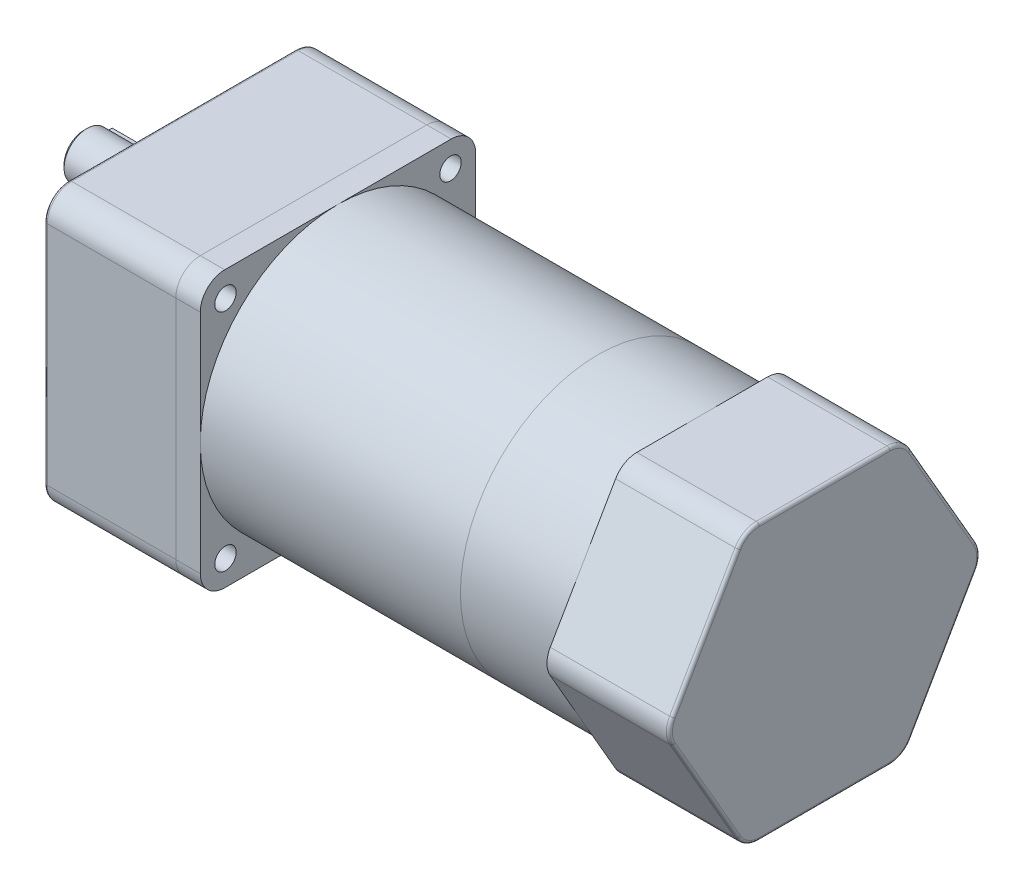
ISO-10303-21;
HEADER;
FILE_DESCRIPTION(('STEP AP214'),'2;1');
FILE_NAME('part.step','',(''),(''),'','','');
FILE_SCHEMA(('AUTOMOTIVE_DESIGN { 1 0 10303 214 1 1 1 1 }'));
ENDSEC;
DATA;
#1=APPLICATION_CONTEXT('core data for automotive mechanical design processes');
#2=APPLICATION_PROTOCOL_DEFINITION('international standard','automotive_design',2000,#1);
#3=PRODUCT_CONTEXT('',#1,'mechanical');
#4=PRODUCT('Part','Part','',(#3));
#5=PRODUCT_RELATED_PRODUCT_CATEGORY('part','',(#4));
#6=PRODUCT_DEFINITION_FORMATION('','',#4);
#7=PRODUCT_DEFINITION_CONTEXT('part definition',#1,'design');
#8=PRODUCT_DEFINITION('design','',#6,#7);
#9=PRODUCT_DEFINITION_SHAPE('','',#8);
#10=(LENGTH_UNIT() NAMED_UNIT(*) SI_UNIT(.MILLI.,.METRE.));
#11=(NAMED_UNIT(*) PLANE_ANGLE_UNIT() SI_UNIT($,.RADIAN.));
#12=(NAMED_UNIT(*) SI_UNIT($,.STERADIAN.) SOLID_ANGLE_UNIT());
#13=UNCERTAINTY_MEASURE_WITH_UNIT(LENGTH_MEASURE(1.E-05),#10,'distance_accuracy_value','');
#14=(GEOMETRIC_REPRESENTATION_CONTEXT(3) GLOBAL_UNCERTAINTY_ASSIGNED_CONTEXT((#13)) GLOBAL_UNIT_ASSIGNED_CONTEXT((#10,
#11,#12)) REPRESENTATION_CONTEXT('',''));
#15=CARTESIAN_POINT('',(0.,0.,0.));
#16=DIRECTION('',(0.,0.,1.));
#17=DIRECTION('',(1.,0.,0.));
#18=AXIS2_PLACEMENT_3D('',#15,#16,#17);
#19=CARTESIAN_POINT('',(-9.5,18.,-9.5));
#20=DIRECTION('',(0.,0.,1.));
#21=DIRECTION('',(1.,0.,0.));
#22=AXIS2_PLACEMENT_3D('',#19,#20,#21);
#23=CYLINDRICAL_SURFACE('',#22,2.5);
#24=DIRECTION('',(0.,0.,1.));
#25=VECTOR('',#24,1.);
#26=CARTESIAN_POINT('',(-9.5,15.5,-9.5));
#27=LINE('',#26,#25);
#28=CARTESIAN_POINT('',(-9.5,15.5,-9.2));
#29=VERTEX_POINT('',#28);
#30=CARTESIAN_POINT('',(-9.5,15.5,-4.5));
#31=VERTEX_POINT('',#30);
#32=EDGE_CURVE('E103',#29,#31,#27,.T.);
#33=ORIENTED_EDGE('',*,*,#32,.F.);
#34=CARTESIAN_POINT('',(-9.5,18.,-9.2));
#35=DIRECTION('',(0.,0.,-1.));
#36=DIRECTION('',(-1.,0.,0.));
#37=AXIS2_PLACEMENT_3D('',#34,#35,#36);
#38=CIRCLE('',#37,2.5);
#39=CARTESIAN_POINT('',(-9.5,20.5,-9.2));
#40=VERTEX_POINT('',#39);
#41=EDGE_CURVE('E146',#29,#40,#38,.F.);
#42=ORIENTED_EDGE('',*,*,#41,.T.);
#43=DIRECTION('',(0.,0.,1.));
#44=VECTOR('',#43,1.);
#45=CARTESIAN_POINT('',(-9.5,20.5,-9.5));
#46=LINE('',#45,#44);
#47=CARTESIAN_POINT('',(-9.5,20.5,-4.5));
#48=VERTEX_POINT('',#47);
#49=EDGE_CURVE('E125',#40,#48,#46,.T.);
#50=ORIENTED_EDGE('',*,*,#49,.T.);
#51=CARTESIAN_POINT('',(-9.5,18.,-4.5));
#52=DIRECTION('',(0.,0.,-1.));
#53=DIRECTION('',(-1.,0.,0.));
#54=AXIS2_PLACEMENT_3D('',#51,#52,#53);
#55=CIRCLE('',#54,2.5);
#56=EDGE_CURVE('E121',#48,#31,#55,.T.);
#57=ORIENTED_EDGE('',*,*,#56,.T.);
#58=EDGE_LOOP('',(#33,#42,#50,#57));
#59=FACE_BOUND('',#58,.T.);
#60=ADVANCED_FACE('F50',(#59),#23,.T.);
#61=CARTESIAN_POINT('',(-32.,15.5,-9.5));
#62=DIRECTION('',(0.,1.,0.));
#63=DIRECTION('',(-1.,0.,0.));
#64=AXIS2_PLACEMENT_3D('',#61,#62,#63);
#65=PLANE('',#64);
#66=DIRECTION('',(0.,0.,1.));
#67=VECTOR('',#66,1.);
#68=CARTESIAN_POINT('',(-32.,15.5,-9.5));
#69=LINE('',#68,#67);
#70=CARTESIAN_POINT('',(-32.,15.5,-9.2));
#71=VERTEX_POINT('',#70);
#72=CARTESIAN_POINT('',(-32.,15.5,-4.5));
#73=VERTEX_POINT('',#72);
#74=EDGE_CURVE('E115',#71,#73,#69,.T.);
#75=ORIENTED_EDGE('',*,*,#74,.F.);
#76=DIRECTION('',(1.,0.,0.));
#77=VECTOR('',#76,1.);
#78=CARTESIAN_POINT('',(-9.5,15.5,-9.2));
#79=LINE('',#78,#77);
#80=EDGE_CURVE('E109',#71,#29,#79,.T.);
#81=ORIENTED_EDGE('',*,*,#80,.T.);
#82=ORIENTED_EDGE('',*,*,#32,.T.);
#83=DIRECTION('',(-1.,0.,0.));
#84=VECTOR('',#83,1.);
#85=CARTESIAN_POINT('',(-32.,15.5,-4.5));
#86=LINE('',#85,#84);
#87=EDGE_CURVE('E106',#31,#73,#86,.T.);
#88=ORIENTED_EDGE('',*,*,#87,.T.);
#89=EDGE_LOOP('',(#75,#81,#82,#88));
#90=FACE_BOUND('',#89,.T.);
#91=ADVANCED_FACE('F105',(#90),#65,.F.);
#92=CARTESIAN_POINT('',(-32.,20.5,-9.5));
#93=DIRECTION('',(1.,0.,0.));
#94=DIRECTION('',(0.,0.,-1.));
#95=AXIS2_PLACEMENT_3D('',#92,#93,#94);
#96=PLANE('',#95);
#97=DIRECTION('',(0.,0.,1.));
#98=VECTOR('',#97,1.);
#99=CARTESIAN_POINT('',(-32.,20.5,-9.5));
#100=LINE('',#99,#98);
#101=CARTESIAN_POINT('',(-32.,20.5,-9.2));
#102=VERTEX_POINT('',#101);
#103=CARTESIAN_POINT('',(-32.,20.5,-4.5));
#104=VERTEX_POINT('',#103);
#105=EDGE_CURVE('E135',#102,#104,#100,.T.);
#106=ORIENTED_EDGE('',*,*,#105,.F.);
#107=DIRECTION('',(0.,-1.,0.));
#108=VECTOR('',#107,1.);
#109=CARTESIAN_POINT('',(-32.,15.5,-9.2));
#110=LINE('',#109,#108);
#111=EDGE_CURVE('E59',#102,#71,#110,.T.);
#112=ORIENTED_EDGE('',*,*,#111,.T.);
#113=ORIENTED_EDGE('',*,*,#74,.T.);
#114=DIRECTION('',(0.,1.,0.));
#115=VECTOR('',#114,1.);
#116=CARTESIAN_POINT('',(-32.,20.5,-4.5));
#117=LINE('',#116,#115);
#118=EDGE_CURVE('E123',#73,#104,#117,.T.);
#119=ORIENTED_EDGE('',*,*,#118,.T.);
#120=EDGE_LOOP('',(#106,#112,#113,#119));
#121=FACE_BOUND('',#120,.T.);
#122=ADVANCED_FACE('F170',(#121),#96,.F.);
#123=CARTESIAN_POINT('',(-9.5,20.5,-9.5));
#124=DIRECTION('',(0.,-1.,0.));
#125=DIRECTION('',(0.,0.,-1.));
#126=AXIS2_PLACEMENT_3D('',#123,#124,#125);
#127=PLANE('',#126);
#128=ORIENTED_EDGE('',*,*,#49,.F.);
#129=DIRECTION('',(-1.,0.,0.));
#130=VECTOR('',#129,1.);
#131=CARTESIAN_POINT('',(-32.,20.5,-9.2));
#132=LINE('',#131,#130);
#133=EDGE_CURVE('E12',#40,#102,#132,.T.);
#134=ORIENTED_EDGE('',*,*,#133,.T.);
#135=ORIENTED_EDGE('',*,*,#105,.T.);
#136=DIRECTION('',(1.,0.,0.));
#137=VECTOR('',#136,1.);
#138=CARTESIAN_POINT('',(-9.5,20.5,-4.5));
#139=LINE('',#138,#137);
#140=EDGE_CURVE('E132',#104,#48,#139,.T.);
#141=ORIENTED_EDGE('',*,*,#140,.T.);
#142=EDGE_LOOP('',(#128,#134,#135,#141));
#143=FACE_BOUND('',#142,.T.);
#144=ADVANCED_FACE('F169',(#143),#127,.F.);
#145=CARTESIAN_POINT('',(-9.5,18.,-9.5));
#146=DIRECTION('',(0.,0.,-1.));
#147=DIRECTION('',(-1.,0.,0.));
#148=AXIS2_PLACEMENT_3D('',#145,#146,#147);
#149=PLANE('',#148);
#150=DIRECTION('',(1.,0.,0.));
#151=VECTOR('',#150,1.);
#152=CARTESIAN_POINT('',(-9.5,20.2,-9.5));
#153=LINE('',#152,#151);
#154=CARTESIAN_POINT('',(-31.7,20.2,-9.5));
#155=VERTEX_POINT('',#154);
#156=CARTESIAN_POINT('',(-9.5,20.2,-9.5));
#157=VERTEX_POINT('',#156);
#158=EDGE_CURVE('E114',#155,#157,#153,.T.);
#159=ORIENTED_EDGE('',*,*,#158,.T.);
#160=CARTESIAN_POINT('',(-9.5,18.,-9.5));
#161=DIRECTION('',(0.,0.,-1.));
#162=DIRECTION('',(-1.,0.,0.));
#163=AXIS2_PLACEMENT_3D('',#160,#161,#162);
#164=CIRCLE('',#163,2.2);
#165=CARTESIAN_POINT('',(-9.5,15.8,-9.5));
#166=VERTEX_POINT('',#165);
#167=EDGE_CURVE('E143',#157,#166,#164,.T.);
#168=ORIENTED_EDGE('',*,*,#167,.T.);
#169=DIRECTION('',(-1.,0.,0.));
#170=VECTOR('',#169,1.);
#171=CARTESIAN_POINT('',(-32.,15.8,-9.5));
#172=LINE('',#171,#170);
#173=CARTESIAN_POINT('',(-31.7,15.8,-9.5));
#174=VERTEX_POINT('',#173);
#175=EDGE_CURVE('E141',#166,#174,#172,.T.);
#176=ORIENTED_EDGE('',*,*,#175,.T.);
#177=DIRECTION('',(0.,1.,0.));
#178=VECTOR('',#177,1.);
#179=CARTESIAN_POINT('',(-31.7,20.5,-9.5));
#180=LINE('',#179,#178);
#181=EDGE_CURVE('E139',#174,#155,#180,.T.);
#182=ORIENTED_EDGE('',*,*,#181,.T.);
#183=EDGE_LOOP('',(#159,#168,#176,#182));
#184=FACE_BOUND('',#183,.T.);
#185=ADVANCED_FACE('F164',(#184),#149,.T.);
#186=CARTESIAN_POINT('',(-9.5,18.,-4.5));
#187=DIRECTION('',(0.,0.,-1.));
#188=DIRECTION('',(-1.,0.,0.));
#189=AXIS2_PLACEMENT_3D('',#186,#187,#188);
#190=PLANE('',#189);
#191=ORIENTED_EDGE('',*,*,#56,.F.);
#192=ORIENTED_EDGE('',*,*,#140,.F.);
#193=ORIENTED_EDGE('',*,*,#118,.F.);
#194=ORIENTED_EDGE('',*,*,#87,.F.);
#195=EDGE_LOOP('',(#191,#192,#193,#194));
#196=FACE_BOUND('',#195,.T.);
#197=ADVANCED_FACE('F119',(#196),#190,.F.);
#198=CARTESIAN_POINT('',(-31.7,18.,-9.5));
#199=DIRECTION('',(-0.707106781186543,0.,-0.707106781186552));
#200=DIRECTION('',(0.,-1.,0.));
#201=AXIS2_PLACEMENT_3D('',#198,#199,#200);
#202=PLANE('',#201);
#203=DIRECTION('',(-0.577350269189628,-0.577350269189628,0.577350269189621));
#204=VECTOR('',#203,1.);
#205=CARTESIAN_POINT('',(-30.9666666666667,16.5333333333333,-10.2333333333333));
#206=LINE('',#205,#204);
#207=EDGE_CURVE('E129',#71,#174,#206,.F.);
#208=ORIENTED_EDGE('',*,*,#207,.F.);
#209=ORIENTED_EDGE('',*,*,#111,.F.);
#210=DIRECTION('',(-0.577350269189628,0.577350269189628,0.577350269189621));
#211=VECTOR('',#210,1.);
#212=CARTESIAN_POINT('',(-24.2999999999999,12.7999999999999,-16.9));
#213=LINE('',#212,#211);
#214=EDGE_CURVE('E54',#155,#102,#213,.T.);
#215=ORIENTED_EDGE('',*,*,#214,.F.);
#216=ORIENTED_EDGE('',*,*,#181,.F.);
#217=EDGE_LOOP('',(#208,#209,#215,#216));
#218=FACE_BOUND('',#217,.T.);
#219=ADVANCED_FACE('F52',(#218),#202,.T.);
#220=CARTESIAN_POINT('',(-9.5,20.2,-9.5));
#221=DIRECTION('',(0.,0.707106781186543,-0.707106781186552));
#222=DIRECTION('',(-1.,0.,0.));
#223=AXIS2_PLACEMENT_3D('',#220,#221,#222);
#224=PLANE('',#223);
#225=ORIENTED_EDGE('',*,*,#214,.T.);
#226=ORIENTED_EDGE('',*,*,#133,.F.);
#227=DIRECTION('',(0.,0.707106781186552,0.707106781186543));
#228=VECTOR('',#227,1.);
#229=CARTESIAN_POINT('',(-9.5,20.2,-9.5));
#230=LINE('',#229,#228);
#231=EDGE_CURVE('E152',#157,#40,#230,.T.);
#232=ORIENTED_EDGE('',*,*,#231,.F.);
#233=ORIENTED_EDGE('',*,*,#158,.F.);
#234=EDGE_LOOP('',(#225,#226,#232,#233));
#235=FACE_BOUND('',#234,.T.);
#236=ADVANCED_FACE('F187',(#235),#224,.T.);
#237=CARTESIAN_POINT('',(-9.5,15.8,-9.5));
#238=DIRECTION('',(0.,-0.707106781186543,-0.707106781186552));
#239=DIRECTION('',(1.,0.,0.));
#240=AXIS2_PLACEMENT_3D('',#237,#238,#239);
#241=PLANE('',#240);
#242=ORIENTED_EDGE('',*,*,#207,.T.);
#243=ORIENTED_EDGE('',*,*,#175,.F.);
#244=DIRECTION('',(0.,0.707106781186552,-0.707106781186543));
#245=VECTOR('',#244,1.);
#246=CARTESIAN_POINT('',(-9.5,15.5,-9.2));
#247=LINE('',#246,#245);
#248=EDGE_CURVE('E150',#29,#166,#247,.T.);
#249=ORIENTED_EDGE('',*,*,#248,.F.);
#250=ORIENTED_EDGE('',*,*,#80,.F.);
#251=EDGE_LOOP('',(#242,#243,#249,#250));
#252=FACE_BOUND('',#251,.T.);
#253=ADVANCED_FACE('F157',(#252),#241,.T.);
#254=CARTESIAN_POINT('',(-9.5,18.,-9.5));
#255=DIRECTION('',(0.,0.,1.));
#256=DIRECTION('',(1.,0.,0.));
#257=AXIS2_PLACEMENT_3D('',#254,#255,#256);
#258=CONICAL_SURFACE('',#257,2.2,0.785398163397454);
#259=ORIENTED_EDGE('',*,*,#231,.T.);
#260=ORIENTED_EDGE('',*,*,#41,.F.);
#261=ORIENTED_EDGE('',*,*,#248,.T.);
#262=ORIENTED_EDGE('',*,*,#167,.F.);
#263=EDGE_LOOP('',(#259,#260,#261,#262));
#264=FACE_BOUND('',#263,.T.);
#265=ADVANCED_FACE('F168',(#264),#258,.T.);
#266=CLOSED_SHELL('',(#60,#91,#122,#144,#185,#197,#219,#236,#253,#265));
#267=MANIFOLD_SOLID_BREP('B2',#266);
#268=CARTESIAN_POINT('',(-32.,18.,0.));
#269=DIRECTION('',(1.,0.,0.));
#270=DIRECTION('',(0.,0.,-1.));
#271=AXIS2_PLACEMENT_3D('',#268,#269,#270);
#272=CYLINDRICAL_SURFACE('',#271,7.5);
#273=CARTESIAN_POINT('',(-3.,18.,0.));
#274=DIRECTION('',(-1.,0.,0.));
#275=DIRECTION('',(0.,0.,1.));
#276=AXIS2_PLACEMENT_3D('',#273,#274,#275);
#277=CIRCLE('',#276,7.5);
#278=CARTESIAN_POINT('',(-3.,18.,7.5));
#279=VERTEX_POINT('',#278);
#280=EDGE_CURVE('E344',#279,#279,#277,.T.);
#281=ORIENTED_EDGE('',*,*,#280,.T.);
#282=EDGE_LOOP('',(#281));
#283=FACE_BOUND('',#282,.T.);
#284=DIRECTION('',(1.,0.,0.));
#285=VECTOR('',#284,1.);
#286=CARTESIAN_POINT('',(-32.,20.5,-7.07106781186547));
#287=LINE('',#286,#285);
#288=CARTESIAN_POINT('',(-31.,20.5,-7.07106781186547));
#289=VERTEX_POINT('',#288);
#290=CARTESIAN_POINT('',(-9.5,20.5,-7.07106781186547));
#291=VERTEX_POINT('',#290);
#292=EDGE_CURVE('E333',#289,#291,#287,.T.);
#293=ORIENTED_EDGE('',*,*,#292,.F.);
#294=CARTESIAN_POINT('',(-31.,18.,0.));
#295=DIRECTION('',(-1.,0.,0.));
#296=DIRECTION('',(0.,0.,1.));
#297=AXIS2_PLACEMENT_3D('',#294,#295,#296);
#298=CIRCLE('',#297,7.5);
#299=CARTESIAN_POINT('',(-31.,15.5,-7.07106781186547));
#300=VERTEX_POINT('',#299);
#301=EDGE_CURVE('E277',#289,#300,#298,.F.);
#302=ORIENTED_EDGE('',*,*,#301,.T.);
#303=DIRECTION('',(1.,0.,0.));
#304=VECTOR('',#303,1.);
#305=CARTESIAN_POINT('',(-32.,15.5,-7.07106781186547));
#306=LINE('',#305,#304);
#307=CARTESIAN_POINT('',(-9.5,15.5,-7.07106781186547));
#308=VERTEX_POINT('',#307);
#309=EDGE_CURVE('E335',#308,#300,#306,.F.);
#310=ORIENTED_EDGE('',*,*,#309,.F.);
#311=CARTESIAN_POINT('',(-9.5,20.5,-7.07106781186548));
#312=CARTESIAN_POINT('',(-9.43179292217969,20.5000089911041,-7.07105693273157));
#313=CARTESIAN_POINT('',(-9.36359192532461,20.4972088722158,-7.07205443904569));
#314=CARTESIAN_POINT('',(-9.22771896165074,20.4860604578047,-7.07598524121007));
#315=CARTESIAN_POINT('',(-9.16004685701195,20.477713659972,-7.07891801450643));
#316=CARTESIAN_POINT('',(-9.02590951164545,20.455574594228,-7.08662705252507));
#317=CARTESIAN_POINT('',(-8.95944129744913,20.4417984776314,-7.09139784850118));
#318=CARTESIAN_POINT('',(-8.8279917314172,20.4089418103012,-7.10262619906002));
#319=CARTESIAN_POINT('',(-8.7630104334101,20.3898610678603,-7.10908381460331));
#320=CARTESIAN_POINT('',(-8.57103842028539,20.324915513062,-7.13069940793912));
#321=CARTESIAN_POINT('',(-8.44682084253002,20.2713141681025,-7.14811243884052));
#322=CARTESIAN_POINT('',(-8.20912318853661,20.1451778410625,-7.1869703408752));
#323=CARTESIAN_POINT('',(-8.09564976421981,20.0726312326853,-7.20841768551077));
#324=CARTESIAN_POINT('',(-7.8782070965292,19.9076299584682,-7.25386182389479));
#325=CARTESIAN_POINT('',(-7.7747148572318,19.8145628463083,-7.27792189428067));
#326=CARTESIAN_POINT('',(-7.5844828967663,19.6124707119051,-7.32534626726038));
#327=CARTESIAN_POINT('',(-7.497746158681,19.5034428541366,-7.34871044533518));
#328=CARTESIAN_POINT('',(-7.34130177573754,19.2690092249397,-7.39284706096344));
#329=CARTESIAN_POINT('',(-7.27209769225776,19.1432502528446,-7.41353593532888));
#330=CARTESIAN_POINT('',(-7.1560192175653,18.8810730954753,-7.44924021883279));
#331=CARTESIAN_POINT('',(-7.10913800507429,18.7446581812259,-7.46425736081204));
#332=CARTESIAN_POINT('',(-7.04066072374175,18.4700733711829,-7.48647677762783));
#333=CARTESIAN_POINT('',(-7.01824182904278,18.3321295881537,-7.49393272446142));
#334=CARTESIAN_POINT('',(-6.99670924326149,18.0542474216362,-7.50109021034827));
#335=CARTESIAN_POINT('',(-6.99758999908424,17.9143095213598,-7.50079359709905));
#336=CARTESIAN_POINT('',(-7.0221107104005,17.6422403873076,-7.49265096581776));
#337=CARTESIAN_POINT('',(-7.04485659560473,17.5100182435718,-7.48510152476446));
#338=CARTESIAN_POINT('',(-7.1109829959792,17.2513898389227,-7.46367401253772));
#339=CARTESIAN_POINT('',(-7.15436465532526,17.1249839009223,-7.44979559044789));
#340=CARTESIAN_POINT('',(-7.26105342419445,16.8796184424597,-7.41689170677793));
#341=CARTESIAN_POINT('',(-7.32461511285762,16.760778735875,-7.39780094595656));
#342=CARTESIAN_POINT('',(-7.46964987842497,16.5351885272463,-7.35645969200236));
#343=CARTESIAN_POINT('',(-7.55112782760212,16.4284413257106,-7.33420833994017));
#344=CARTESIAN_POINT('',(-7.73417762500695,16.2247566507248,-7.28765679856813));
#345=CARTESIAN_POINT('',(-7.83651385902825,16.128515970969,-7.26330946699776));
#346=CARTESIAN_POINT('',(-8.05610372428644,15.9543199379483,-7.21618726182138));
#347=CARTESIAN_POINT('',(-8.17336215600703,15.8763704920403,-7.19341289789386));
#348=CARTESIAN_POINT('',(-8.42170044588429,15.7399916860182,-7.15175078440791));
#349=CARTESIAN_POINT('',(-8.55295878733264,15.6818674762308,-7.13292537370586));
#350=CARTESIAN_POINT('',(-8.8241174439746,15.5888494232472,-7.10202742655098));
#351=CARTESIAN_POINT('',(-8.96400373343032,15.5539189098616,-7.08994423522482));
#352=CARTESIAN_POINT('',(-9.17104659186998,15.5208546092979,-7.078413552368));
#353=CARTESIAN_POINT('',(-9.23660347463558,15.5130373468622,-7.07566669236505));
#354=CARTESIAN_POINT('',(-9.36809519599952,15.502613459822,-7.07199258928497));
#355=CARTESIAN_POINT('',(-9.43402943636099,15.5000001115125,-7.0710629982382));
#356=CARTESIAN_POINT('',(-9.5,15.5,-7.07106781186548));
#357=B_SPLINE_CURVE_WITH_KNOTS('',3,(#311,#312,#313,#314,#315,#316,#317,#318,#319,#320,#321,
#322,#323,#324,#325,#326,#327,#328,#329,#330,#331,#332,#333,#334,#335,#336,#337,#338,#339,#340,
#341,#342,#343,#344,#345,#346,#347,#348,#349,#350,#351,#352,#353,#354,#355,#356),.UNSPECIFIED.,
.F.,.F.,(4,2,2,2,2,2,2,2,2,2,2,2,2,2,2,2,2,2,2,2,2,2,4),(0.,0.20454621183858,0.409037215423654,
0.612924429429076,0.816819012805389,1.22401016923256,1.63145179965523,2.0532786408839,
2.47518051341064,2.90809434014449,3.34087579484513,3.75860278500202,4.17623021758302,
4.57747647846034,4.97874498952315,5.38529148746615,5.79194868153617,6.21771736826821,
6.64362337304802,7.07581676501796,7.50732520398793,7.70536340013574,7.90314555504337),.UNSPECIFIED.);
#358=EDGE_CURVE('E347',#291,#308,#357,.T.);
#359=ORIENTED_EDGE('',*,*,#358,.F.);
#360=EDGE_LOOP('',(#293,#302,#310,#359));
#361=FACE_BOUND('',#360,.T.);
#362=ADVANCED_FACE('F264',(#283,#361),#272,.T.);
#363=CARTESIAN_POINT('',(-32.,18.,0.));
#364=DIRECTION('',(-1.,0.,0.));
#365=DIRECTION('',(0.,0.,1.));
#366=AXIS2_PLACEMENT_3D('',#363,#364,#365);
#367=PLANE('',#366);
#368=DIRECTION('',(0.,0.,-1.));
#369=VECTOR('',#368,1.);
#370=CARTESIAN_POINT('',(-32.,15.5,-4.5));
#371=LINE('',#370,#369);
#372=CARTESIAN_POINT('',(-32.,15.5,-4.5));
#373=VERTEX_POINT('',#372);
#374=CARTESIAN_POINT('',(-32.,15.5,-6.00000000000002));
#375=VERTEX_POINT('',#374);
#376=EDGE_CURVE('E339',#373,#375,#371,.T.);
#377=ORIENTED_EDGE('',*,*,#376,.T.);
#378=CARTESIAN_POINT('',(-32.,18.,0.));
#379=DIRECTION('',(-1.,0.,0.));
#380=DIRECTION('',(0.,0.,1.));
#381=AXIS2_PLACEMENT_3D('',#378,#379,#380);
#382=CIRCLE('',#381,6.50000000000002);
#383=CARTESIAN_POINT('',(-32.,20.5,-6.00000000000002));
#384=VERTEX_POINT('',#383);
#385=EDGE_CURVE('E353',#375,#384,#382,.T.);
#386=ORIENTED_EDGE('',*,*,#385,.T.);
#387=DIRECTION('',(0.,0.,-1.));
#388=VECTOR('',#387,1.);
#389=CARTESIAN_POINT('',(-32.,20.5,-4.5));
#390=LINE('',#389,#388);
#391=CARTESIAN_POINT('',(-32.,20.5,-4.5));
#392=VERTEX_POINT('',#391);
#393=EDGE_CURVE('E336',#392,#384,#390,.T.);
#394=ORIENTED_EDGE('',*,*,#393,.F.);
#395=DIRECTION('',(0.,-1.,0.));
#396=VECTOR('',#395,1.);
#397=CARTESIAN_POINT('',(-32.,20.5,-4.5));
#398=LINE('',#397,#396);
#399=EDGE_CURVE('E320',#392,#373,#398,.T.);
#400=ORIENTED_EDGE('',*,*,#399,.T.);
#401=EDGE_LOOP('',(#377,#386,#394,#400));
#402=FACE_BOUND('',#401,.T.);
#403=ADVANCED_FACE('F363',(#402),#367,.T.);
#404=CARTESIAN_POINT('',(-3.,18.,0.));
#405=DIRECTION('',(-1.,0.,0.));
#406=DIRECTION('',(0.,0.,1.));
#407=AXIS2_PLACEMENT_3D('',#404,#405,#406);
#408=PLANE('',#407);
#409=ORIENTED_EDGE('',*,*,#280,.F.);
#410=EDGE_LOOP('',(#409));
#411=FACE_BOUND('',#410,.T.);
#412=ADVANCED_FACE('F361',(#411),#408,.F.);
#413=CARTESIAN_POINT('',(-9.5,18.,-4.5));
#414=DIRECTION('',(0.,0.,-1.));
#415=DIRECTION('',(-1.,0.,0.));
#416=AXIS2_PLACEMENT_3D('',#413,#414,#415);
#417=CYLINDRICAL_SURFACE('',#416,2.5);
#418=DIRECTION('',(0.,0.,-1.));
#419=VECTOR('',#418,1.);
#420=CARTESIAN_POINT('',(-9.5,20.5,-4.5));
#421=LINE('',#420,#419);
#422=CARTESIAN_POINT('',(-9.5,20.5,-4.5));
#423=VERTEX_POINT('',#422);
#424=EDGE_CURVE('E328',#423,#291,#421,.T.);
#425=ORIENTED_EDGE('',*,*,#424,.T.);
#426=ORIENTED_EDGE('',*,*,#358,.T.);
#427=DIRECTION('',(0.,0.,-1.));
#428=VECTOR('',#427,1.);
#429=CARTESIAN_POINT('',(-9.5,15.5,-4.5));
#430=LINE('',#429,#428);
#431=CARTESIAN_POINT('',(-9.5,15.5,-4.5));
#432=VERTEX_POINT('',#431);
#433=EDGE_CURVE('E330',#432,#308,#430,.T.);
#434=ORIENTED_EDGE('',*,*,#433,.F.);
#435=CARTESIAN_POINT('',(-9.5,18.,-4.5));
#436=DIRECTION('',(0.,0.,1.));
#437=DIRECTION('',(1.,0.,0.));
#438=AXIS2_PLACEMENT_3D('',#435,#436,#437);
#439=CIRCLE('',#438,2.5);
#440=EDGE_CURVE('E318',#432,#423,#439,.T.);
#441=ORIENTED_EDGE('',*,*,#440,.T.);
#442=EDGE_LOOP('',(#425,#426,#434,#441));
#443=FACE_BOUND('',#442,.T.);
#444=ADVANCED_FACE('F327',(#443),#417,.F.);
#445=CARTESIAN_POINT('',(-9.5,20.5,-4.5));
#446=DIRECTION('',(0.,-1.,0.));
#447=DIRECTION('',(0.,0.,-1.));
#448=AXIS2_PLACEMENT_3D('',#445,#446,#447);
#449=PLANE('',#448);
#450=ORIENTED_EDGE('',*,*,#393,.T.);
#451=CARTESIAN_POINT('',(-32.,20.5,-6.00000000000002));
#452=CARTESIAN_POINT('',(-31.9171731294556,20.5,-6.0897273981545));
#453=CARTESIAN_POINT('',(-31.8341996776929,20.5,-6.17931930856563));
#454=CARTESIAN_POINT('',(-31.6679908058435,20.5,-6.35825867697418));
#455=CARTESIAN_POINT('',(-31.5847553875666,20.5,-6.44760613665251));
#456=CARTESIAN_POINT('',(-31.4180527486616,20.5,-6.62608424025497));
#457=CARTESIAN_POINT('',(-31.3345855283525,20.5,-6.7152148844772));
#458=CARTESIAN_POINT('',(-31.1674427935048,20.5,-6.89328182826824));
#459=CARTESIAN_POINT('',(-31.0837672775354,20.5,-6.98221812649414));
#460=CARTESIAN_POINT('',(-31.,20.5,-7.07106781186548));
#461=B_SPLINE_CURVE_WITH_KNOTS('',3,(#451,#452,#453,#454,#455,#456,#457,#458,#459,#460),
.UNSPECIFIED.,.F.,.F.,(4,2,2,2,4),(0.,0.366335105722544,0.732667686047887,1.0989997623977,
1.46533436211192),.UNSPECIFIED.);
#462=EDGE_CURVE('E291',#384,#289,#461,.T.);
#463=ORIENTED_EDGE('',*,*,#462,.T.);
#464=ORIENTED_EDGE('',*,*,#292,.T.);
#465=ORIENTED_EDGE('',*,*,#424,.F.);
#466=DIRECTION('',(-1.,0.,0.));
#467=VECTOR('',#466,1.);
#468=CARTESIAN_POINT('',(-9.5,20.5,-4.5));
#469=LINE('',#468,#467);
#470=EDGE_CURVE('E315',#423,#392,#469,.T.);
#471=ORIENTED_EDGE('',*,*,#470,.T.);
#472=EDGE_LOOP('',(#450,#463,#464,#465,#471));
#473=FACE_BOUND('',#472,.T.);
#474=ADVANCED_FACE('F332',(#473),#449,.T.);
#475=CARTESIAN_POINT('',(-32.,15.5,-4.5));
#476=DIRECTION('',(0.,1.,0.));
#477=DIRECTION('',(0.,0.,1.));
#478=AXIS2_PLACEMENT_3D('',#475,#476,#477);
#479=PLANE('',#478);
#480=ORIENTED_EDGE('',*,*,#309,.T.);
#481=CARTESIAN_POINT('',(-31.,15.5,-7.07106781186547));
#482=CARTESIAN_POINT('',(-31.0837672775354,15.5,-6.98221812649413));
#483=CARTESIAN_POINT('',(-31.1674427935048,15.5,-6.89328182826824));
#484=CARTESIAN_POINT('',(-31.3345855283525,15.5,-6.7152148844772));
#485=CARTESIAN_POINT('',(-31.4180527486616,15.5,-6.62608424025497));
#486=CARTESIAN_POINT('',(-31.5847553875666,15.5,-6.44760613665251));
#487=CARTESIAN_POINT('',(-31.6679908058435,15.5,-6.35825867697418));
#488=CARTESIAN_POINT('',(-31.8341996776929,15.5,-6.17931930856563));
#489=CARTESIAN_POINT('',(-31.9171731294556,15.5,-6.08972739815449));
#490=CARTESIAN_POINT('',(-32.,15.5,-6.00000000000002));
#491=B_SPLINE_CURVE_WITH_KNOTS('',3,(#481,#482,#483,#484,#485,#486,#487,#488,#489,#490),
.UNSPECIFIED.,.F.,.F.,(4,2,2,2,4),(0.,0.366334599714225,0.732666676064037,1.09899925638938,
1.46533436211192),.UNSPECIFIED.);
#492=EDGE_CURVE('E48',#300,#375,#491,.T.);
#493=ORIENTED_EDGE('',*,*,#492,.T.);
#494=ORIENTED_EDGE('',*,*,#376,.F.);
#495=DIRECTION('',(1.,0.,0.));
#496=VECTOR('',#495,1.);
#497=CARTESIAN_POINT('',(-32.,15.5,-4.5));
#498=LINE('',#497,#496);
#499=EDGE_CURVE('E385',#373,#432,#498,.T.);
#500=ORIENTED_EDGE('',*,*,#499,.T.);
#501=ORIENTED_EDGE('',*,*,#433,.T.);
#502=EDGE_LOOP('',(#480,#493,#494,#500,#501));
#503=FACE_BOUND('',#502,.T.);
#504=ADVANCED_FACE('F389',(#503),#479,.T.);
#505=CARTESIAN_POINT('',(-9.5,18.,-4.5));
#506=DIRECTION('',(0.,0.,1.));
#507=DIRECTION('',(1.,0.,0.));
#508=AXIS2_PLACEMENT_3D('',#505,#506,#507);
#509=PLANE('',#508);
#510=ORIENTED_EDGE('',*,*,#440,.F.);
#511=ORIENTED_EDGE('',*,*,#499,.F.);
#512=ORIENTED_EDGE('',*,*,#399,.F.);
#513=ORIENTED_EDGE('',*,*,#470,.F.);
#514=EDGE_LOOP('',(#510,#511,#512,#513));
#515=FACE_BOUND('',#514,.T.);
#516=ADVANCED_FACE('F317',(#515),#509,.F.);
#517=CARTESIAN_POINT('',(-32.,18.,0.));
#518=DIRECTION('',(1.,0.,0.));
#519=DIRECTION('',(0.,0.,-1.));
#520=AXIS2_PLACEMENT_3D('',#517,#518,#519);
#521=CONICAL_SURFACE('',#520,6.50000000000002,0.785398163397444);
#522=ORIENTED_EDGE('',*,*,#492,.F.);
#523=ORIENTED_EDGE('',*,*,#301,.F.);
#524=ORIENTED_EDGE('',*,*,#462,.F.);
#525=ORIENTED_EDGE('',*,*,#385,.F.);
#526=EDGE_LOOP('',(#522,#523,#524,#525));
#527=FACE_BOUND('',#526,.T.);
#528=ADVANCED_FACE('F266',(#527),#521,.T.);
#529=CLOSED_SHELL('',(#362,#403,#412,#444,#474,#504,#516,#528));
#530=MANIFOLD_SOLID_BREP('B6',#529);
#531=CARTESIAN_POINT('',(0.,-37.,37.));
#532=DIRECTION('',(-1.,0.,0.));
#533=DIRECTION('',(0.,0.,1.));
#534=AXIS2_PLACEMENT_3D('',#531,#532,#533);
#535=PLANE('',#534);
#536=CARTESIAN_POINT('',(0.,0.,0.));
#537=DIRECTION('',(-1.,0.,0.));
#538=DIRECTION('',(0.,0.,1.));
#539=AXIS2_PLACEMENT_3D('',#536,#537,#538);
#540=CIRCLE('',#539,41.9);
#541=CARTESIAN_POINT('',(0.,0.,41.9));
#542=VERTEX_POINT('',#541);
#543=EDGE_CURVE('E262',#542,#542,#540,.F.);
#544=ORIENTED_EDGE('',*,*,#543,.T.);
#545=EDGE_LOOP('',(#544));
#546=FACE_BOUND('',#545,.T.);
#547=CARTESIAN_POINT('',(0.,-37.,-37.));
#548=DIRECTION('',(-1.,0.,0.));
#549=DIRECTION('',(0.,0.,1.));
#550=AXIS2_PLACEMENT_3D('',#547,#548,#549);
#551=CIRCLE('',#550,7.);
#552=CARTESIAN_POINT('',(0.,-37.,-44.));
#553=VERTEX_POINT('',#552);
#554=CARTESIAN_POINT('',(0.,-44.,-36.9999999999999));
#555=VERTEX_POINT('',#554);
#556=EDGE_CURVE('E615',#553,#555,#551,.T.);
#557=ORIENTED_EDGE('',*,*,#556,.T.);
#558=DIRECTION('',(0.,0.,-1.));
#559=VECTOR('',#558,1.);
#560=CARTESIAN_POINT('',(0.,-44.,37.));
#561=LINE('',#560,#559);
#562=CARTESIAN_POINT('',(0.,-44.,37.));
#563=VERTEX_POINT('',#562);
#564=EDGE_CURVE('E611',#555,#563,#561,.F.);
#565=ORIENTED_EDGE('',*,*,#564,.T.);
#566=CARTESIAN_POINT('',(0.,-37.,37.));
#567=DIRECTION('',(-1.,0.,0.));
#568=DIRECTION('',(0.,0.,1.));
#569=AXIS2_PLACEMENT_3D('',#566,#567,#568);
#570=CIRCLE('',#569,7.);
#571=CARTESIAN_POINT('',(0.,-37.,44.));
#572=VERTEX_POINT('',#571);
#573=EDGE_CURVE('E614',#563,#572,#570,.T.);
#574=ORIENTED_EDGE('',*,*,#573,.T.);
#575=DIRECTION('',(0.,-1.,0.));
#576=VECTOR('',#575,1.);
#577=CARTESIAN_POINT('',(0.,36.9999999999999,44.));
#578=LINE('',#577,#576);
#579=CARTESIAN_POINT('',(0.,36.9999999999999,44.));
#580=VERTEX_POINT('',#579);
#581=EDGE_CURVE('E578',#572,#580,#578,.F.);
#582=ORIENTED_EDGE('',*,*,#581,.T.);
#583=CARTESIAN_POINT('',(0.,37.,37.));
#584=DIRECTION('',(-1.,0.,0.));
#585=DIRECTION('',(0.,0.,1.));
#586=AXIS2_PLACEMENT_3D('',#583,#584,#585);
#587=CIRCLE('',#586,7.);
#588=CARTESIAN_POINT('',(0.,44.,37.));
#589=VERTEX_POINT('',#588);
#590=EDGE_CURVE('E622',#580,#589,#587,.T.);
#591=ORIENTED_EDGE('',*,*,#590,.T.);
#592=DIRECTION('',(0.,0.,1.));
#593=VECTOR('',#592,1.);
#594=CARTESIAN_POINT('',(0.,44.,-36.9999999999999));
#595=LINE('',#594,#593);
#596=CARTESIAN_POINT('',(0.,44.,-36.9999999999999));
#597=VERTEX_POINT('',#596);
#598=EDGE_CURVE('E620',#589,#597,#595,.F.);
#599=ORIENTED_EDGE('',*,*,#598,.T.);
#600=CARTESIAN_POINT('',(0.,37.,-37.));
#601=DIRECTION('',(-1.,0.,0.));
#602=DIRECTION('',(0.,0.,1.));
#603=AXIS2_PLACEMENT_3D('',#600,#601,#602);
#604=CIRCLE('',#603,7.);
#605=CARTESIAN_POINT('',(0.,36.9999999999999,-44.));
#606=VERTEX_POINT('',#605);
#607=EDGE_CURVE('E618',#597,#606,#604,.T.);
#608=ORIENTED_EDGE('',*,*,#607,.T.);
#609=DIRECTION('',(0.,1.,0.));
#610=VECTOR('',#609,1.);
#611=CARTESIAN_POINT('',(0.,-37.,-44.));
#612=LINE('',#611,#610);
#613=EDGE_CURVE('E572',#606,#553,#612,.F.);
#614=ORIENTED_EDGE('',*,*,#613,.T.);
#615=EDGE_LOOP('',(#557,#565,#574,#582,#591,#599,#608,#614));
#616=FACE_BOUND('',#615,.T.);
#617=CARTESIAN_POINT('',(0.,-36.7695526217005,-36.7695526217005));
#618=DIRECTION('',(-1.,0.,0.));
#619=DIRECTION('',(0.,0.,1.));
#620=AXIS2_PLACEMENT_3D('',#617,#618,#619);
#621=CIRCLE('',#620,2.49999999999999);
#622=CARTESIAN_POINT('',(0.,-36.7695526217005,-34.2695526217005));
#623=VERTEX_POINT('',#622);
#624=EDGE_CURVE('E659',#623,#623,#621,.T.);
#625=ORIENTED_EDGE('',*,*,#624,.F.);
#626=EDGE_LOOP('',(#625));
#627=FACE_BOUND('',#626,.T.);
#628=CARTESIAN_POINT('',(0.,36.7695526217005,-36.7695526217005));
#629=DIRECTION('',(-1.,0.,0.));
#630=DIRECTION('',(0.,0.,1.));
#631=AXIS2_PLACEMENT_3D('',#628,#629,#630);
#632=CIRCLE('',#631,2.49999999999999);
#633=CARTESIAN_POINT('',(0.,36.7695526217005,-34.2695526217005));
#634=VERTEX_POINT('',#633);
#635=EDGE_CURVE('E665',#634,#634,#632,.T.);
#636=ORIENTED_EDGE('',*,*,#635,.F.);
#637=EDGE_LOOP('',(#636));
#638=FACE_BOUND('',#637,.T.);
#639=CARTESIAN_POINT('',(0.,-36.7695526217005,36.7695526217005));
#640=DIRECTION('',(-1.,0.,0.));
#641=DIRECTION('',(0.,0.,1.));
#642=AXIS2_PLACEMENT_3D('',#639,#640,#641);
#643=CIRCLE('',#642,2.49999999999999);
#644=CARTESIAN_POINT('',(0.,-36.7695526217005,39.2695526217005));
#645=VERTEX_POINT('',#644);
#646=EDGE_CURVE('E671',#645,#645,#643,.T.);
#647=ORIENTED_EDGE('',*,*,#646,.F.);
#648=EDGE_LOOP('',(#647));
#649=FACE_BOUND('',#648,.T.);
#650=CARTESIAN_POINT('',(0.,36.7695526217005,36.7695526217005));
#651=DIRECTION('',(-1.,0.,0.));
#652=DIRECTION('',(0.,0.,1.));
#653=AXIS2_PLACEMENT_3D('',#650,#651,#652);
#654=CIRCLE('',#653,2.49999999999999);
#655=CARTESIAN_POINT('',(0.,36.7695526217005,39.2695526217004));
#656=VERTEX_POINT('',#655);
#657=EDGE_CURVE('E677',#656,#656,#654,.T.);
#658=ORIENTED_EDGE('',*,*,#657,.F.);
#659=EDGE_LOOP('',(#658));
#660=FACE_BOUND('',#659,.T.);
#661=ADVANCED_FACE('F454',(#546,#616,#627,#638,#649,#660),#535,.T.);
#662=CARTESIAN_POINT('',(43.,-37.,37.));
#663=DIRECTION('',(-1.,0.,0.));
#664=DIRECTION('',(0.,0.,1.));
#665=AXIS2_PLACEMENT_3D('',#662,#663,#664);
#666=CYLINDRICAL_SURFACE('',#665,8.);
#667=DIRECTION('',(-1.,0.,0.));
#668=VECTOR('',#667,1.);
#669=CARTESIAN_POINT('',(43.,-37.,45.));
#670=LINE('',#669,#668);
#671=CARTESIAN_POINT('',(43.,-37.,45.));
#672=VERTEX_POINT('',#671);
#673=CARTESIAN_POINT('',(1.,-37.,45.));
#674=VERTEX_POINT('',#673);
#675=EDGE_CURVE('E554',#672,#674,#670,.T.);
#676=ORIENTED_EDGE('',*,*,#675,.T.);
#677=CARTESIAN_POINT('',(1.,-37.,37.));
#678=DIRECTION('',(-1.,0.,0.));
#679=DIRECTION('',(0.,0.,1.));
#680=AXIS2_PLACEMENT_3D('',#677,#678,#679);
#681=CIRCLE('',#680,8.);
#682=CARTESIAN_POINT('',(1.,-45.,37.));
#683=VERTEX_POINT('',#682);
#684=EDGE_CURVE('E568',#674,#683,#681,.F.);
#685=ORIENTED_EDGE('',*,*,#684,.T.);
#686=DIRECTION('',(-1.,0.,0.));
#687=VECTOR('',#686,1.);
#688=CARTESIAN_POINT('',(43.,-45.,37.));
#689=LINE('',#688,#687);
#690=CARTESIAN_POINT('',(43.,-45.,37.));
#691=VERTEX_POINT('',#690);
#692=EDGE_CURVE('E588',#691,#683,#689,.T.);
#693=ORIENTED_EDGE('',*,*,#692,.F.);
#694=CARTESIAN_POINT('',(43.,-37.,37.));
#695=DIRECTION('',(1.,0.,0.));
#696=DIRECTION('',(0.,0.,1.));
#697=AXIS2_PLACEMENT_3D('',#694,#695,#696);
#698=CIRCLE('',#697,8.);
#699=EDGE_CURVE('E571',#672,#691,#698,.T.);
#700=ORIENTED_EDGE('',*,*,#699,.F.);
#701=EDGE_LOOP('',(#676,#685,#693,#700));
#702=FACE_BOUND('',#701,.T.);
#703=ADVANCED_FACE('F565',(#702),#666,.T.);
#704=CARTESIAN_POINT('',(43.,-45.,37.));
#705=DIRECTION('',(0.,1.,0.));
#706=DIRECTION('',(0.,0.,1.));
#707=AXIS2_PLACEMENT_3D('',#704,#705,#706);
#708=PLANE('',#707);
#709=ORIENTED_EDGE('',*,*,#692,.T.);
#710=DIRECTION('',(0.,0.,-1.));
#711=VECTOR('',#710,1.);
#712=CARTESIAN_POINT('',(1.,-45.,-36.9999999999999));
#713=LINE('',#712,#711);
#714=CARTESIAN_POINT('',(1.,-45.,-36.9999999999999));
#715=VERTEX_POINT('',#714);
#716=EDGE_CURVE('E590',#683,#715,#713,.T.);
#717=ORIENTED_EDGE('',*,*,#716,.T.);
#718=DIRECTION('',(-1.,0.,0.));
#719=VECTOR('',#718,1.);
#720=CARTESIAN_POINT('',(43.,-45.,-36.9999999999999));
#721=LINE('',#720,#719);
#722=CARTESIAN_POINT('',(43.,-45.,-36.9999999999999));
#723=VERTEX_POINT('',#722);
#724=EDGE_CURVE('E610',#723,#715,#721,.T.);
#725=ORIENTED_EDGE('',*,*,#724,.F.);
#726=DIRECTION('',(0.,0.,-1.));
#727=VECTOR('',#726,1.);
#728=CARTESIAN_POINT('',(43.,-45.,37.));
#729=LINE('',#728,#727);
#730=EDGE_CURVE('E652',#691,#723,#729,.T.);
#731=ORIENTED_EDGE('',*,*,#730,.F.);
#732=EDGE_LOOP('',(#709,#717,#725,#731));
#733=FACE_BOUND('',#732,.T.);
#734=ADVANCED_FACE('F709',(#733),#708,.F.);
#735=CARTESIAN_POINT('',(43.,-37.,-37.));
#736=DIRECTION('',(-1.,0.,0.));
#737=DIRECTION('',(0.,0.,1.));
#738=AXIS2_PLACEMENT_3D('',#735,#736,#737);
#739=CYLINDRICAL_SURFACE('',#738,8.);
#740=ORIENTED_EDGE('',*,*,#724,.T.);
#741=CARTESIAN_POINT('',(1.,-37.,-37.));
#742=DIRECTION('',(-1.,0.,0.));
#743=DIRECTION('',(0.,0.,1.));
#744=AXIS2_PLACEMENT_3D('',#741,#742,#743);
#745=CIRCLE('',#744,8.);
#746=CARTESIAN_POINT('',(1.,-37.,-45.));
#747=VERTEX_POINT('',#746);
#748=EDGE_CURVE('E608',#715,#747,#745,.F.);
#749=ORIENTED_EDGE('',*,*,#748,.T.);
#750=DIRECTION('',(-1.,0.,0.));
#751=VECTOR('',#750,1.);
#752=CARTESIAN_POINT('',(43.,-37.,-45.));
#753=LINE('',#752,#751);
#754=CARTESIAN_POINT('',(43.,-37.,-45.));
#755=VERTEX_POINT('',#754);
#756=EDGE_CURVE('E607',#755,#747,#753,.T.);
#757=ORIENTED_EDGE('',*,*,#756,.F.);
#758=CARTESIAN_POINT('',(43.,-37.,-37.));
#759=DIRECTION('',(1.,0.,0.));
#760=DIRECTION('',(0.,0.,-1.));
#761=AXIS2_PLACEMENT_3D('',#758,#759,#760);
#762=CIRCLE('',#761,8.);
#763=EDGE_CURVE('E650',#723,#755,#762,.T.);
#764=ORIENTED_EDGE('',*,*,#763,.F.);
#765=EDGE_LOOP('',(#740,#749,#757,#764));
#766=FACE_BOUND('',#765,.T.);
#767=ADVANCED_FACE('F820',(#766),#739,.T.);
#768=CARTESIAN_POINT('',(43.,-37.,-45.));
#769=DIRECTION('',(0.,0.,1.));
#770=DIRECTION('',(1.,0.,0.));
#771=AXIS2_PLACEMENT_3D('',#768,#769,#770);
#772=PLANE('',#771);
#773=ORIENTED_EDGE('',*,*,#756,.T.);
#774=DIRECTION('',(0.,1.,0.));
#775=VECTOR('',#774,1.);
#776=CARTESIAN_POINT('',(1.,36.9999999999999,-45.));
#777=LINE('',#776,#775);
#778=CARTESIAN_POINT('',(1.,36.9999999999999,-45.));
#779=VERTEX_POINT('',#778);
#780=EDGE_CURVE('E605',#747,#779,#777,.T.);
#781=ORIENTED_EDGE('',*,*,#780,.T.);
#782=DIRECTION('',(-1.,0.,0.));
#783=VECTOR('',#782,1.);
#784=CARTESIAN_POINT('',(43.,36.9999999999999,-45.));
#785=LINE('',#784,#783);
#786=CARTESIAN_POINT('',(43.,36.9999999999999,-45.));
#787=VERTEX_POINT('',#786);
#788=EDGE_CURVE('E604',#787,#779,#785,.T.);
#789=ORIENTED_EDGE('',*,*,#788,.F.);
#790=DIRECTION('',(0.,1.,0.));
#791=VECTOR('',#790,1.);
#792=CARTESIAN_POINT('',(43.,-37.,-45.));
#793=LINE('',#792,#791);
#794=EDGE_CURVE('E648',#755,#787,#793,.T.);
#795=ORIENTED_EDGE('',*,*,#794,.F.);
#796=EDGE_LOOP('',(#773,#781,#789,#795));
#797=FACE_BOUND('',#796,.T.);
#798=ADVANCED_FACE('F849',(#797),#772,.F.);
#799=CARTESIAN_POINT('',(43.,37.,-37.));
#800=DIRECTION('',(-1.,0.,0.));
#801=DIRECTION('',(0.,0.,1.));
#802=AXIS2_PLACEMENT_3D('',#799,#800,#801);
#803=CYLINDRICAL_SURFACE('',#802,8.);
#804=ORIENTED_EDGE('',*,*,#788,.T.);
#805=CARTESIAN_POINT('',(1.,37.,-37.));
#806=DIRECTION('',(-1.,0.,0.));
#807=DIRECTION('',(0.,0.,1.));
#808=AXIS2_PLACEMENT_3D('',#805,#806,#807);
#809=CIRCLE('',#808,8.);
#810=CARTESIAN_POINT('',(1.,45.,-36.9999999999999));
#811=VERTEX_POINT('',#810);
#812=EDGE_CURVE('E602',#779,#811,#809,.F.);
#813=ORIENTED_EDGE('',*,*,#812,.T.);
#814=DIRECTION('',(-1.,0.,0.));
#815=VECTOR('',#814,1.);
#816=CARTESIAN_POINT('',(43.,45.,-36.9999999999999));
#817=LINE('',#816,#815);
#818=CARTESIAN_POINT('',(43.,45.,-36.9999999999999));
#819=VERTEX_POINT('',#818);
#820=EDGE_CURVE('E601',#819,#811,#817,.T.);
#821=ORIENTED_EDGE('',*,*,#820,.F.);
#822=CARTESIAN_POINT('',(43.,37.,-37.));
#823=DIRECTION('',(1.,0.,0.));
#824=DIRECTION('',(0.,0.,1.));
#825=AXIS2_PLACEMENT_3D('',#822,#823,#824);
#826=CIRCLE('',#825,8.);
#827=EDGE_CURVE('E646',#787,#819,#826,.T.);
#828=ORIENTED_EDGE('',*,*,#827,.F.);
#829=EDGE_LOOP('',(#804,#813,#821,#828));
#830=FACE_BOUND('',#829,.T.);
#831=ADVANCED_FACE('F852',(#830),#803,.T.);
#832=CARTESIAN_POINT('',(43.,45.,37.));
#833=DIRECTION('',(0.,-1.,0.));
#834=DIRECTION('',(0.,0.,-1.));
#835=AXIS2_PLACEMENT_3D('',#832,#833,#834);
#836=PLANE('',#835);
#837=ORIENTED_EDGE('',*,*,#820,.T.);
#838=DIRECTION('',(0.,0.,1.));
#839=VECTOR('',#838,1.);
#840=CARTESIAN_POINT('',(1.,45.,37.));
#841=LINE('',#840,#839);
#842=CARTESIAN_POINT('',(1.,45.,37.));
#843=VERTEX_POINT('',#842);
#844=EDGE_CURVE('E599',#811,#843,#841,.T.);
#845=ORIENTED_EDGE('',*,*,#844,.T.);
#846=DIRECTION('',(-1.,0.,0.));
#847=VECTOR('',#846,1.);
#848=CARTESIAN_POINT('',(43.,45.,37.));
#849=LINE('',#848,#847);
#850=CARTESIAN_POINT('',(43.,45.,37.));
#851=VERTEX_POINT('',#850);
#852=EDGE_CURVE('E598',#851,#843,#849,.T.);
#853=ORIENTED_EDGE('',*,*,#852,.F.);
#854=DIRECTION('',(0.,0.,1.));
#855=VECTOR('',#854,1.);
#856=CARTESIAN_POINT('',(43.,45.,37.));
#857=LINE('',#856,#855);
#858=EDGE_CURVE('E644',#819,#851,#857,.T.);
#859=ORIENTED_EDGE('',*,*,#858,.F.);
#860=EDGE_LOOP('',(#837,#845,#853,#859));
#861=FACE_BOUND('',#860,.T.);
#862=ADVANCED_FACE('F855',(#861),#836,.F.);
#863=CARTESIAN_POINT('',(43.,37.,37.));
#864=DIRECTION('',(-1.,0.,0.));
#865=DIRECTION('',(0.,0.,1.));
#866=AXIS2_PLACEMENT_3D('',#863,#864,#865);
#867=CYLINDRICAL_SURFACE('',#866,8.);
#868=ORIENTED_EDGE('',*,*,#852,.T.);
#869=CARTESIAN_POINT('',(1.,37.,37.));
#870=DIRECTION('',(-1.,0.,0.));
#871=DIRECTION('',(0.,0.,1.));
#872=AXIS2_PLACEMENT_3D('',#869,#870,#871);
#873=CIRCLE('',#872,8.);
#874=CARTESIAN_POINT('',(1.,36.9999999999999,45.));
#875=VERTEX_POINT('',#874);
#876=EDGE_CURVE('E596',#843,#875,#873,.F.);
#877=ORIENTED_EDGE('',*,*,#876,.T.);
#878=DIRECTION('',(-1.,0.,0.));
#879=VECTOR('',#878,1.);
#880=CARTESIAN_POINT('',(43.,36.9999999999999,45.));
#881=LINE('',#880,#879);
#882=CARTESIAN_POINT('',(43.,36.9999999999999,45.));
#883=VERTEX_POINT('',#882);
#884=EDGE_CURVE('E557',#883,#875,#881,.T.);
#885=ORIENTED_EDGE('',*,*,#884,.F.);
#886=CARTESIAN_POINT('',(43.,37.,37.));
#887=DIRECTION('',(1.,0.,0.));
#888=DIRECTION('',(0.,0.,1.));
#889=AXIS2_PLACEMENT_3D('',#886,#887,#888);
#890=CIRCLE('',#889,8.);
#891=EDGE_CURVE('E642',#851,#883,#890,.T.);
#892=ORIENTED_EDGE('',*,*,#891,.F.);
#893=EDGE_LOOP('',(#868,#877,#885,#892));
#894=FACE_BOUND('',#893,.T.);
#895=ADVANCED_FACE('F828',(#894),#867,.T.);
#896=CARTESIAN_POINT('',(43.,-37.,45.));
#897=DIRECTION('',(0.,0.,-1.));
#898=DIRECTION('',(-1.,0.,0.));
#899=AXIS2_PLACEMENT_3D('',#896,#897,#898);
#900=PLANE('',#899);
#901=ORIENTED_EDGE('',*,*,#884,.T.);
#902=DIRECTION('',(0.,-1.,0.));
#903=VECTOR('',#902,1.);
#904=CARTESIAN_POINT('',(1.,-37.,45.));
#905=LINE('',#904,#903);
#906=EDGE_CURVE('E550',#875,#674,#905,.T.);
#907=ORIENTED_EDGE('',*,*,#906,.T.);
#908=ORIENTED_EDGE('',*,*,#675,.F.);
#909=DIRECTION('',(0.,-1.,0.));
#910=VECTOR('',#909,1.);
#911=CARTESIAN_POINT('',(43.,-37.,45.));
#912=LINE('',#911,#910);
#913=EDGE_CURVE('E639',#883,#672,#912,.T.);
#914=ORIENTED_EDGE('',*,*,#913,.F.);
#915=EDGE_LOOP('',(#901,#907,#908,#914));
#916=FACE_BOUND('',#915,.T.);
#917=ADVANCED_FACE('F552',(#916),#900,.F.);
#918=CARTESIAN_POINT('',(43.,-37.,37.));
#919=DIRECTION('',(-1.,0.,0.));
#920=DIRECTION('',(0.,0.,1.));
#921=AXIS2_PLACEMENT_3D('',#918,#919,#920);
#922=PLANE('',#921);
#923=CARTESIAN_POINT('',(43.,36.7695526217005,36.7695526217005));
#924=DIRECTION('',(-1.,0.,0.));
#925=DIRECTION('',(0.,0.,1.));
#926=AXIS2_PLACEMENT_3D('',#923,#924,#925);
#927=CIRCLE('',#926,3.5);
#928=CARTESIAN_POINT('',(43.,36.7695526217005,33.2695526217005));
#929=VERTEX_POINT('',#928);
#930=EDGE_CURVE('E562',#929,#929,#927,.T.);
#931=ORIENTED_EDGE('',*,*,#930,.T.);
#932=EDGE_LOOP('',(#931));
#933=FACE_BOUND('',#932,.T.);
#934=CARTESIAN_POINT('',(43.,36.7695526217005,-36.7695526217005));
#935=DIRECTION('',(-1.,0.,0.));
#936=DIRECTION('',(0.,0.,1.));
#937=AXIS2_PLACEMENT_3D('',#934,#935,#936);
#938=CIRCLE('',#937,3.5);
#939=CARTESIAN_POINT('',(43.,36.7695526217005,-40.2695526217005));
#940=VERTEX_POINT('',#939);
#941=EDGE_CURVE('E787',#940,#940,#938,.T.);
#942=ORIENTED_EDGE('',*,*,#941,.T.);
#943=EDGE_LOOP('',(#942));
#944=FACE_BOUND('',#943,.T.);
#945=CARTESIAN_POINT('',(43.,-36.7695526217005,-36.7695526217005));
#946=DIRECTION('',(-1.,0.,0.));
#947=DIRECTION('',(0.,0.,1.));
#948=AXIS2_PLACEMENT_3D('',#945,#946,#947);
#949=CIRCLE('',#948,3.5);
#950=CARTESIAN_POINT('',(43.,-36.7695526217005,-40.2695526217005));
#951=VERTEX_POINT('',#950);
#952=EDGE_CURVE('E790',#951,#951,#949,.T.);
#953=ORIENTED_EDGE('',*,*,#952,.T.);
#954=EDGE_LOOP('',(#953));
#955=FACE_BOUND('',#954,.T.);
#956=CARTESIAN_POINT('',(43.,-36.7695526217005,36.7695526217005));
#957=DIRECTION('',(-1.,0.,0.));
#958=DIRECTION('',(0.,0.,1.));
#959=AXIS2_PLACEMENT_3D('',#956,#957,#958);
#960=CIRCLE('',#959,3.5);
#961=CARTESIAN_POINT('',(43.,-36.7695526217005,33.2695526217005));
#962=VERTEX_POINT('',#961);
#963=EDGE_CURVE('E655',#962,#962,#960,.T.);
#964=ORIENTED_EDGE('',*,*,#963,.T.);
#965=EDGE_LOOP('',(#964));
#966=FACE_BOUND('',#965,.T.);
#967=ORIENTED_EDGE('',*,*,#699,.T.);
#968=ORIENTED_EDGE('',*,*,#730,.T.);
#969=ORIENTED_EDGE('',*,*,#763,.T.);
#970=ORIENTED_EDGE('',*,*,#794,.T.);
#971=ORIENTED_EDGE('',*,*,#827,.T.);
#972=ORIENTED_EDGE('',*,*,#858,.T.);
#973=ORIENTED_EDGE('',*,*,#891,.T.);
#974=ORIENTED_EDGE('',*,*,#913,.T.);
#975=EDGE_LOOP('',(#967,#968,#969,#970,#971,#972,#973,#974));
#976=FACE_BOUND('',#975,.T.);
#977=ADVANCED_FACE('F715',(#933,#944,#955,#966,#976),#922,.F.);
#978=CARTESIAN_POINT('',(1.,44.,37.));
#979=DIRECTION('',(0.,0.,-1.));
#980=DIRECTION('',(-1.,0.,0.));
#981=AXIS2_PLACEMENT_3D('',#978,#979,#980);
#982=CYLINDRICAL_SURFACE('',#981,1.);
#983=CARTESIAN_POINT('',(1.,44.,-36.9999999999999));
#984=DIRECTION('',(0.,0.,-1.));
#985=DIRECTION('',(0.,1.,0.));
#986=AXIS2_PLACEMENT_3D('',#983,#984,#985);
#987=CIRCLE('',#986,1.);
#988=EDGE_CURVE('E799',#597,#811,#987,.T.);
#989=ORIENTED_EDGE('',*,*,#988,.F.);
#990=ORIENTED_EDGE('',*,*,#598,.F.);
#991=CARTESIAN_POINT('',(1.,44.,37.));
#992=DIRECTION('',(0.,0.,1.));
#993=DIRECTION('',(1.,0.,0.));
#994=AXIS2_PLACEMENT_3D('',#991,#992,#993);
#995=CIRCLE('',#994,1.);
#996=EDGE_CURVE('E641',#843,#589,#995,.T.);
#997=ORIENTED_EDGE('',*,*,#996,.F.);
#998=ORIENTED_EDGE('',*,*,#844,.F.);
#999=EDGE_LOOP('',(#989,#990,#997,#998));
#1000=FACE_BOUND('',#999,.T.);
#1001=ADVANCED_FACE('F718',(#1000),#982,.T.);
#1002=CARTESIAN_POINT('',(1.,37.,37.));
#1003=DIRECTION('',(-1.,0.,0.));
#1004=DIRECTION('',(0.,0.,1.));
#1005=AXIS2_PLACEMENT_3D('',#1002,#1003,#1004);
#1006=TOROIDAL_SURFACE('',#1005,7.,1.);
#1007=ORIENTED_EDGE('',*,*,#996,.T.);
#1008=ORIENTED_EDGE('',*,*,#590,.F.);
#1009=CARTESIAN_POINT('',(1.,36.9999999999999,44.));
#1010=DIRECTION('',(0.,-1.,0.));
#1011=DIRECTION('',(0.,0.,-1.));
#1012=AXIS2_PLACEMENT_3D('',#1009,#1010,#1011);
#1013=CIRCLE('',#1012,1.);
#1014=EDGE_CURVE('E802',#875,#580,#1013,.T.);
#1015=ORIENTED_EDGE('',*,*,#1014,.F.);
#1016=ORIENTED_EDGE('',*,*,#876,.F.);
#1017=EDGE_LOOP('',(#1007,#1008,#1015,#1016));
#1018=FACE_BOUND('',#1017,.T.);
#1019=ADVANCED_FACE('F832',(#1018),#1006,.T.);
#1020=CARTESIAN_POINT('',(1.,37.,-37.));
#1021=DIRECTION('',(-1.,0.,0.));
#1022=DIRECTION('',(0.,0.,1.));
#1023=AXIS2_PLACEMENT_3D('',#1020,#1021,#1022);
#1024=TOROIDAL_SURFACE('',#1023,7.,1.);
#1025=ORIENTED_EDGE('',*,*,#988,.T.);
#1026=ORIENTED_EDGE('',*,*,#812,.F.);
#1027=CARTESIAN_POINT('',(1.,36.9999999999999,-44.));
#1028=DIRECTION('',(0.,-1.,0.));
#1029=DIRECTION('',(0.,0.,-1.));
#1030=AXIS2_PLACEMENT_3D('',#1027,#1028,#1029);
#1031=CIRCLE('',#1030,1.);
#1032=EDGE_CURVE('E582',#606,#779,#1031,.T.);
#1033=ORIENTED_EDGE('',*,*,#1032,.F.);
#1034=ORIENTED_EDGE('',*,*,#607,.F.);
#1035=EDGE_LOOP('',(#1025,#1026,#1033,#1034));
#1036=FACE_BOUND('',#1035,.T.);
#1037=ADVANCED_FACE('F843',(#1036),#1024,.T.);
#1038=CARTESIAN_POINT('',(1.,-37.,44.));
#1039=DIRECTION('',(0.,1.,0.));
#1040=DIRECTION('',(0.,0.,1.));
#1041=AXIS2_PLACEMENT_3D('',#1038,#1039,#1040);
#1042=CYLINDRICAL_SURFACE('',#1041,1.);
#1043=ORIENTED_EDGE('',*,*,#1014,.T.);
#1044=ORIENTED_EDGE('',*,*,#581,.F.);
#1045=CARTESIAN_POINT('',(1.,-37.,44.));
#1046=DIRECTION('',(0.,-1.,0.));
#1047=DIRECTION('',(0.,0.,-1.));
#1048=AXIS2_PLACEMENT_3D('',#1045,#1046,#1047);
#1049=CIRCLE('',#1048,1.);
#1050=EDGE_CURVE('E576',#674,#572,#1049,.T.);
#1051=ORIENTED_EDGE('',*,*,#1050,.F.);
#1052=ORIENTED_EDGE('',*,*,#906,.F.);
#1053=EDGE_LOOP('',(#1043,#1044,#1051,#1052));
#1054=FACE_BOUND('',#1053,.T.);
#1055=ADVANCED_FACE('F577',(#1054),#1042,.T.);
#1056=CARTESIAN_POINT('',(1.,-37.,-44.));
#1057=DIRECTION('',(0.,-1.,0.));
#1058=DIRECTION('',(0.,0.,-1.));
#1059=AXIS2_PLACEMENT_3D('',#1056,#1057,#1058);
#1060=CYLINDRICAL_SURFACE('',#1059,1.);
#1061=ORIENTED_EDGE('',*,*,#1032,.T.);
#1062=ORIENTED_EDGE('',*,*,#780,.F.);
#1063=CARTESIAN_POINT('',(1.,-37.,-44.));
#1064=DIRECTION('',(0.,-1.,0.));
#1065=DIRECTION('',(0.,0.,-1.));
#1066=AXIS2_PLACEMENT_3D('',#1063,#1064,#1065);
#1067=CIRCLE('',#1066,1.);
#1068=EDGE_CURVE('E581',#553,#747,#1067,.T.);
#1069=ORIENTED_EDGE('',*,*,#1068,.F.);
#1070=ORIENTED_EDGE('',*,*,#613,.F.);
#1071=EDGE_LOOP('',(#1061,#1062,#1069,#1070));
#1072=FACE_BOUND('',#1071,.T.);
#1073=ADVANCED_FACE('F847',(#1072),#1060,.T.);
#1074=CARTESIAN_POINT('',(1.,-37.,37.));
#1075=DIRECTION('',(-1.,0.,0.));
#1076=DIRECTION('',(0.,0.,1.));
#1077=AXIS2_PLACEMENT_3D('',#1074,#1075,#1076);
#1078=TOROIDAL_SURFACE('',#1077,7.,1.);
#1079=ORIENTED_EDGE('',*,*,#1050,.T.);
#1080=ORIENTED_EDGE('',*,*,#573,.F.);
#1081=CARTESIAN_POINT('',(1.,-44.,37.));
#1082=DIRECTION('',(0.,0.,-1.));
#1083=DIRECTION('',(-1.,0.,0.));
#1084=AXIS2_PLACEMENT_3D('',#1081,#1082,#1083);
#1085=CIRCLE('',#1084,1.);
#1086=EDGE_CURVE('E586',#683,#563,#1085,.T.);
#1087=ORIENTED_EDGE('',*,*,#1086,.F.);
#1088=ORIENTED_EDGE('',*,*,#684,.F.);
#1089=EDGE_LOOP('',(#1079,#1080,#1087,#1088));
#1090=FACE_BOUND('',#1089,.T.);
#1091=ADVANCED_FACE('F585',(#1090),#1078,.T.);
#1092=CARTESIAN_POINT('',(1.,-37.,-37.));
#1093=DIRECTION('',(-1.,0.,0.));
#1094=DIRECTION('',(0.,0.,1.));
#1095=AXIS2_PLACEMENT_3D('',#1092,#1093,#1094);
#1096=TOROIDAL_SURFACE('',#1095,7.,1.);
#1097=ORIENTED_EDGE('',*,*,#1068,.T.);
#1098=ORIENTED_EDGE('',*,*,#748,.F.);
#1099=CARTESIAN_POINT('',(1.,-44.,-36.9999999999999));
#1100=DIRECTION('',(0.,0.,1.));
#1101=DIRECTION('',(1.,0.,0.));
#1102=AXIS2_PLACEMENT_3D('',#1099,#1100,#1101);
#1103=CIRCLE('',#1102,1.);
#1104=EDGE_CURVE('E593',#555,#715,#1103,.T.);
#1105=ORIENTED_EDGE('',*,*,#1104,.F.);
#1106=ORIENTED_EDGE('',*,*,#556,.F.);
#1107=EDGE_LOOP('',(#1097,#1098,#1105,#1106));
#1108=FACE_BOUND('',#1107,.T.);
#1109=ADVANCED_FACE('F813',(#1108),#1096,.T.);
#1110=CARTESIAN_POINT('',(1.,-44.,37.));
#1111=DIRECTION('',(0.,0.,1.));
#1112=DIRECTION('',(1.,0.,0.));
#1113=AXIS2_PLACEMENT_3D('',#1110,#1111,#1112);
#1114=CYLINDRICAL_SURFACE('',#1113,1.);
#1115=ORIENTED_EDGE('',*,*,#1086,.T.);
#1116=ORIENTED_EDGE('',*,*,#564,.F.);
#1117=ORIENTED_EDGE('',*,*,#1104,.T.);
#1118=ORIENTED_EDGE('',*,*,#716,.F.);
#1119=EDGE_LOOP('',(#1115,#1116,#1117,#1118));
#1120=FACE_BOUND('',#1119,.T.);
#1121=ADVANCED_FACE('F724',(#1120),#1114,.T.);
#1122=CARTESIAN_POINT('',(17.,-36.7695526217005,-36.7695526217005));
#1123=DIRECTION('',(-1.,0.,0.));
#1124=DIRECTION('',(0.,0.,1.));
#1125=AXIS2_PLACEMENT_3D('',#1122,#1123,#1124);
#1126=CONICAL_SURFACE('',#1125,2.49999999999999,1.02974425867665);
#1127=CARTESIAN_POINT('',(18.5021515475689,-36.7695526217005,-36.7695526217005));
#1128=VERTEX_POINT('',#1127);
#1129=VERTEX_LOOP('',#1128);
#1130=FACE_BOUND('',#1129,.T.);
#1131=CARTESIAN_POINT('',(17.,-36.7695526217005,-36.7695526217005));
#1132=DIRECTION('',(-1.,0.,0.));
#1133=DIRECTION('',(0.,0.,1.));
#1134=AXIS2_PLACEMENT_3D('',#1131,#1132,#1133);
#1135=CIRCLE('',#1134,2.49999999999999);
#1136=CARTESIAN_POINT('',(17.,-36.7695526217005,-34.2695526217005));
#1137=VERTEX_POINT('',#1136);
#1138=EDGE_CURVE('E656',#1137,#1137,#1135,.T.);
#1139=ORIENTED_EDGE('',*,*,#1138,.T.);
#1140=EDGE_LOOP('',(#1139));
#1141=FACE_BOUND('',#1140,.T.);
#1142=ADVANCED_FACE('F720',(#1130,#1141),#1126,.F.);
#1143=CARTESIAN_POINT('',(0.,-36.7695526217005,-36.7695526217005));
#1144=DIRECTION('',(-1.,0.,0.));
#1145=DIRECTION('',(0.,0.,1.));
#1146=AXIS2_PLACEMENT_3D('',#1143,#1144,#1145);
#1147=CYLINDRICAL_SURFACE('',#1146,2.49999999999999);
#1148=ORIENTED_EDGE('',*,*,#1138,.F.);
#1149=EDGE_LOOP('',(#1148));
#1150=FACE_BOUND('',#1149,.T.);
#1151=ORIENTED_EDGE('',*,*,#624,.T.);
#1152=EDGE_LOOP('',(#1151));
#1153=FACE_BOUND('',#1152,.T.);
#1154=ADVANCED_FACE('F723',(#1150,#1153),#1147,.F.);
#1155=CARTESIAN_POINT('',(17.,36.7695526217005,-36.7695526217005));
#1156=DIRECTION('',(-1.,0.,0.));
#1157=DIRECTION('',(0.,0.,1.));
#1158=AXIS2_PLACEMENT_3D('',#1155,#1156,#1157);
#1159=CONICAL_SURFACE('',#1158,2.49999999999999,1.02974425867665);
#1160=CARTESIAN_POINT('',(18.5021515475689,36.7695526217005,-36.7695526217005));
#1161=VERTEX_POINT('',#1160);
#1162=VERTEX_LOOP('',#1161);
#1163=FACE_BOUND('',#1162,.T.);
#1164=CARTESIAN_POINT('',(17.,36.7695526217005,-36.7695526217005));
#1165=DIRECTION('',(-1.,0.,0.));
#1166=DIRECTION('',(0.,0.,1.));
#1167=AXIS2_PLACEMENT_3D('',#1164,#1165,#1166);
#1168=CIRCLE('',#1167,2.49999999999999);
#1169=CARTESIAN_POINT('',(17.,36.7695526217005,-34.2695526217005));
#1170=VERTEX_POINT('',#1169);
#1171=EDGE_CURVE('E662',#1170,#1170,#1168,.T.);
#1172=ORIENTED_EDGE('',*,*,#1171,.T.);
#1173=EDGE_LOOP('',(#1172));
#1174=FACE_BOUND('',#1173,.T.);
#1175=ADVANCED_FACE('F728',(#1163,#1174),#1159,.F.);
#1176=CARTESIAN_POINT('',(0.,36.7695526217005,-36.7695526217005));
#1177=DIRECTION('',(-1.,0.,0.));
#1178=DIRECTION('',(0.,0.,1.));
#1179=AXIS2_PLACEMENT_3D('',#1176,#1177,#1178);
#1180=CYLINDRICAL_SURFACE('',#1179,2.49999999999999);
#1181=ORIENTED_EDGE('',*,*,#1171,.F.);
#1182=EDGE_LOOP('',(#1181));
#1183=FACE_BOUND('',#1182,.T.);
#1184=ORIENTED_EDGE('',*,*,#635,.T.);
#1185=EDGE_LOOP('',(#1184));
#1186=FACE_BOUND('',#1185,.T.);
#1187=ADVANCED_FACE('F732',(#1183,#1186),#1180,.F.);
#1188=CARTESIAN_POINT('',(17.,-36.7695526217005,36.7695526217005));
#1189=DIRECTION('',(-1.,0.,0.));
#1190=DIRECTION('',(0.,0.,1.));
#1191=AXIS2_PLACEMENT_3D('',#1188,#1189,#1190);
#1192=CONICAL_SURFACE('',#1191,2.49999999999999,1.02974425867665);
#1193=CARTESIAN_POINT('',(18.5021515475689,-36.7695526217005,36.7695526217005));
#1194=VERTEX_POINT('',#1193);
#1195=VERTEX_LOOP('',#1194);
#1196=FACE_BOUND('',#1195,.T.);
#1197=CARTESIAN_POINT('',(17.,-36.7695526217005,36.7695526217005));
#1198=DIRECTION('',(-1.,0.,0.));
#1199=DIRECTION('',(0.,0.,1.));
#1200=AXIS2_PLACEMENT_3D('',#1197,#1198,#1199);
#1201=CIRCLE('',#1200,2.49999999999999);
#1202=CARTESIAN_POINT('',(17.,-36.7695526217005,39.2695526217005));
#1203=VERTEX_POINT('',#1202);
#1204=EDGE_CURVE('E668',#1203,#1203,#1201,.T.);
#1205=ORIENTED_EDGE('',*,*,#1204,.T.);
#1206=EDGE_LOOP('',(#1205));
#1207=FACE_BOUND('',#1206,.T.);
#1208=ADVANCED_FACE('F736',(#1196,#1207),#1192,.F.);
#1209=CARTESIAN_POINT('',(0.,-36.7695526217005,36.7695526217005));
#1210=DIRECTION('',(-1.,0.,0.));
#1211=DIRECTION('',(0.,0.,1.));
#1212=AXIS2_PLACEMENT_3D('',#1209,#1210,#1211);
#1213=CYLINDRICAL_SURFACE('',#1212,2.49999999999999);
#1214=ORIENTED_EDGE('',*,*,#1204,.F.);
#1215=EDGE_LOOP('',(#1214));
#1216=FACE_BOUND('',#1215,.T.);
#1217=ORIENTED_EDGE('',*,*,#646,.T.);
#1218=EDGE_LOOP('',(#1217));
#1219=FACE_BOUND('',#1218,.T.);
#1220=ADVANCED_FACE('F740',(#1216,#1219),#1213,.F.);
#1221=CARTESIAN_POINT('',(17.,36.7695526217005,36.7695526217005));
#1222=DIRECTION('',(-1.,0.,0.));
#1223=DIRECTION('',(0.,0.,1.));
#1224=AXIS2_PLACEMENT_3D('',#1221,#1222,#1223);
#1225=CONICAL_SURFACE('',#1224,2.49999999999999,1.02974425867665);
#1226=CARTESIAN_POINT('',(18.5021515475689,36.7695526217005,36.7695526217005));
#1227=VERTEX_POINT('',#1226);
#1228=VERTEX_LOOP('',#1227);
#1229=FACE_BOUND('',#1228,.T.);
#1230=CARTESIAN_POINT('',(17.,36.7695526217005,36.7695526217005));
#1231=DIRECTION('',(-1.,0.,0.));
#1232=DIRECTION('',(0.,0.,1.));
#1233=AXIS2_PLACEMENT_3D('',#1230,#1231,#1232);
#1234=CIRCLE('',#1233,2.49999999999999);
#1235=CARTESIAN_POINT('',(17.,36.7695526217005,39.2695526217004));
#1236=VERTEX_POINT('',#1235);
#1237=EDGE_CURVE('E674',#1236,#1236,#1234,.T.);
#1238=ORIENTED_EDGE('',*,*,#1237,.T.);
#1239=EDGE_LOOP('',(#1238));
#1240=FACE_BOUND('',#1239,.T.);
#1241=ADVANCED_FACE('F743',(#1229,#1240),#1225,.F.);
#1242=CARTESIAN_POINT('',(0.,36.7695526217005,36.7695526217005));
#1243=DIRECTION('',(-1.,0.,0.));
#1244=DIRECTION('',(0.,0.,1.));
#1245=AXIS2_PLACEMENT_3D('',#1242,#1243,#1244);
#1246=CYLINDRICAL_SURFACE('',#1245,2.49999999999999);
#1247=ORIENTED_EDGE('',*,*,#1237,.F.);
#1248=EDGE_LOOP('',(#1247));
#1249=FACE_BOUND('',#1248,.T.);
#1250=ORIENTED_EDGE('',*,*,#657,.T.);
#1251=EDGE_LOOP('',(#1250));
#1252=FACE_BOUND('',#1251,.T.);
#1253=ADVANCED_FACE('F747',(#1249,#1252),#1246,.F.);
#1254=CARTESIAN_POINT('',(25.,-36.7695526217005,36.7695526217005));
#1255=DIRECTION('',(1.,0.,0.));
#1256=DIRECTION('',(0.,0.,-1.));
#1257=AXIS2_PLACEMENT_3D('',#1254,#1255,#1256);
#1258=CYLINDRICAL_SURFACE('',#1257,3.5);
#1259=CARTESIAN_POINT('',(25.,-36.7695526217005,36.7695526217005));
#1260=DIRECTION('',(1.,0.,0.));
#1261=DIRECTION('',(0.,0.,-1.));
#1262=AXIS2_PLACEMENT_3D('',#1259,#1260,#1261);
#1263=CIRCLE('',#1262,3.5);
#1264=CARTESIAN_POINT('',(25.,-36.7695526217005,33.2695526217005));
#1265=VERTEX_POINT('',#1264);
#1266=EDGE_CURVE('E680',#1265,#1265,#1263,.T.);
#1267=CARTESIAN_POINT('',(25.,-36.7695526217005,33.2695526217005));
#1268=CARTESIAN_POINT('',(25.1875,-36.7695526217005,33.2695526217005));
#1269=CARTESIAN_POINT('',(25.375,-36.7695526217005,33.2695526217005));
#1270=CARTESIAN_POINT('',(25.75,-36.7695526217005,33.2695526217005));
#1271=CARTESIAN_POINT('',(25.9375,-36.7695526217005,33.2695526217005));
#1272=CARTESIAN_POINT('',(26.3125,-36.7695526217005,33.2695526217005));
#1273=CARTESIAN_POINT('',(26.5,-36.7695526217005,33.2695526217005));
#1274=CARTESIAN_POINT('',(26.875,-36.7695526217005,33.2695526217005));
#1275=CARTESIAN_POINT('',(27.0625,-36.7695526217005,33.2695526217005));
#1276=CARTESIAN_POINT('',(27.4375,-36.7695526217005,33.2695526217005));
#1277=CARTESIAN_POINT('',(27.625,-36.7695526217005,33.2695526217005));
#1278=CARTESIAN_POINT('',(28.,-36.7695526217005,33.2695526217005));
#1279=CARTESIAN_POINT('',(28.1875,-36.7695526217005,33.2695526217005));
#1280=CARTESIAN_POINT('',(28.5625,-36.7695526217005,33.2695526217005));
#1281=CARTESIAN_POINT('',(28.75,-36.7695526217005,33.2695526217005));
#1282=CARTESIAN_POINT('',(29.125,-36.7695526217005,33.2695526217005));
#1283=CARTESIAN_POINT('',(29.3125,-36.7695526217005,33.2695526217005));
#1284=CARTESIAN_POINT('',(29.6875,-36.7695526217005,33.2695526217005));
#1285=CARTESIAN_POINT('',(29.875,-36.7695526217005,33.2695526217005));
#1286=CARTESIAN_POINT('',(30.25,-36.7695526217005,33.2695526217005));
#1287=CARTESIAN_POINT('',(30.4375,-36.7695526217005,33.2695526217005));
#1288=CARTESIAN_POINT('',(30.8125,-36.7695526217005,33.2695526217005));
#1289=CARTESIAN_POINT('',(31.,-36.7695526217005,33.2695526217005));
#1290=CARTESIAN_POINT('',(31.375,-36.7695526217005,33.2695526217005));
#1291=CARTESIAN_POINT('',(31.5625,-36.7695526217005,33.2695526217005));
#1292=CARTESIAN_POINT('',(31.9375,-36.7695526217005,33.2695526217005));
#1293=CARTESIAN_POINT('',(32.125,-36.7695526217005,33.2695526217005));
#1294=CARTESIAN_POINT('',(32.5,-36.7695526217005,33.2695526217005));
#1295=CARTESIAN_POINT('',(32.6875,-36.7695526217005,33.2695526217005));
#1296=CARTESIAN_POINT('',(33.0625,-36.7695526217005,33.2695526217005));
#1297=CARTESIAN_POINT('',(33.25,-36.7695526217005,33.2695526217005));
#1298=CARTESIAN_POINT('',(33.625,-36.7695526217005,33.2695526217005));
#1299=CARTESIAN_POINT('',(33.8125,-36.7695526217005,33.2695526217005));
#1300=CARTESIAN_POINT('',(34.1875,-36.7695526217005,33.2695526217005));
#1301=CARTESIAN_POINT('',(34.375,-36.7695526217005,33.2695526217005));
#1302=CARTESIAN_POINT('',(34.75,-36.7695526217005,33.2695526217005));
#1303=CARTESIAN_POINT('',(34.9375,-36.7695526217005,33.2695526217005));
#1304=CARTESIAN_POINT('',(35.3125,-36.7695526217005,33.2695526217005));
#1305=CARTESIAN_POINT('',(35.5,-36.7695526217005,33.2695526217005));
#1306=CARTESIAN_POINT('',(35.875,-36.7695526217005,33.2695526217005));
#1307=CARTESIAN_POINT('',(36.0625,-36.7695526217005,33.2695526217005));
#1308=CARTESIAN_POINT('',(36.4375,-36.7695526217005,33.2695526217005));
#1309=CARTESIAN_POINT('',(36.625,-36.7695526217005,33.2695526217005));
#1310=CARTESIAN_POINT('',(37.,-36.7695526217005,33.2695526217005));
#1311=CARTESIAN_POINT('',(37.1875,-36.7695526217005,33.2695526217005));
#1312=CARTESIAN_POINT('',(37.5625,-36.7695526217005,33.2695526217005));
#1313=CARTESIAN_POINT('',(37.75,-36.7695526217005,33.2695526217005));
#1314=CARTESIAN_POINT('',(38.125,-36.7695526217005,33.2695526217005));
#1315=CARTESIAN_POINT('',(38.3125,-36.7695526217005,33.2695526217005));
#1316=CARTESIAN_POINT('',(38.6875,-36.7695526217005,33.2695526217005));
#1317=CARTESIAN_POINT('',(38.875,-36.7695526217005,33.2695526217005));
#1318=CARTESIAN_POINT('',(39.25,-36.7695526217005,33.2695526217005));
#1319=CARTESIAN_POINT('',(39.4375,-36.7695526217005,33.2695526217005));
#1320=CARTESIAN_POINT('',(39.8125,-36.7695526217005,33.2695526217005));
#1321=CARTESIAN_POINT('',(40.,-36.7695526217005,33.2695526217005));
#1322=CARTESIAN_POINT('',(40.375,-36.7695526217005,33.2695526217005));
#1323=CARTESIAN_POINT('',(40.5625,-36.7695526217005,33.2695526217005));
#1324=CARTESIAN_POINT('',(40.9375,-36.7695526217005,33.2695526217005));
#1325=CARTESIAN_POINT('',(41.125,-36.7695526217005,33.2695526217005));
#1326=CARTESIAN_POINT('',(41.5,-36.7695526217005,33.2695526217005));
#1327=CARTESIAN_POINT('',(41.6875,-36.7695526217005,33.2695526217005));
#1328=CARTESIAN_POINT('',(42.0625,-36.7695526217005,33.2695526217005));
#1329=CARTESIAN_POINT('',(42.25,-36.7695526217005,33.2695526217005));
#1330=CARTESIAN_POINT('',(42.625,-36.7695526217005,33.2695526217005));
#1331=CARTESIAN_POINT('',(42.8125,-36.7695526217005,33.2695526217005));
#1332=CARTESIAN_POINT('',(43.,-36.7695526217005,33.2695526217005));
#1333=B_SPLINE_CURVE_WITH_KNOTS('',3,(#1267,#1268,#1269,#1270,#1271,#1272,#1273,#1274,#1275,
#1276,#1277,#1278,#1279,#1280,#1281,#1282,#1283,#1284,#1285,#1286,#1287,#1288,#1289,#1290,#1291,
#1292,#1293,#1294,#1295,#1296,#1297,#1298,#1299,#1300,#1301,#1302,#1303,#1304,#1305,#1306,#1307,
#1308,#1309,#1310,#1311,#1312,#1313,#1314,#1315,#1316,#1317,#1318,#1319,#1320,#1321,#1322,#1323,
#1324,#1325,#1326,#1327,#1328,#1329,#1330,#1331,#1332),.UNSPECIFIED.,.F.,.F.,(4,2,2,2,2,2,2,2,2,
2,2,2,2,2,2,2,2,2,2,2,2,2,2,2,2,2,2,2,2,2,2,2,4),(0.,0.5625,1.125,1.6875,2.25,2.8125,3.375,
3.9375,4.5,5.0625,5.62500000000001,6.18750000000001,6.75000000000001,7.31250000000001,
7.87500000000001,8.43750000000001,9.00000000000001,9.56250000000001,10.125,10.6875,11.25,
11.8125,12.375,12.9375,13.5,14.0625,14.625,15.1875,15.75,16.3125,16.875,17.4375,18.),.UNSPECIFIED.);
#1334=EDGE_CURVE('BSEAM750',#1265,#962,#1333,.T.);
#1335=ORIENTED_EDGE('',*,*,#1266,.F.);
#1336=ORIENTED_EDGE('',*,*,#963,.F.);
#1337=ORIENTED_EDGE('',*,*,#1334,.T.);
#1338=ORIENTED_EDGE('',*,*,#1334,.F.);
#1339=EDGE_LOOP('',(#1335,#1337,#1336,#1338));
#1340=FACE_BOUND('',#1339,.T.);
#1341=ADVANCED_FACE('F750',(#1340),#1258,.F.);
#1342=CARTESIAN_POINT('',(25.,0.,0.));
#1343=DIRECTION('',(1.,0.,0.));
#1344=DIRECTION('',(0.,0.,-1.));
#1345=AXIS2_PLACEMENT_3D('',#1342,#1343,#1344);
#1346=PLANE('',#1345);
#1347=ORIENTED_EDGE('',*,*,#1266,.T.);
#1348=EDGE_LOOP('',(#1347));
#1349=FACE_BOUND('',#1348,.T.);
#1350=ADVANCED_FACE('F754',(#1349),#1346,.T.);
#1351=CARTESIAN_POINT('',(25.,-36.7695526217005,-36.7695526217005));
#1352=DIRECTION('',(1.,0.,0.));
#1353=DIRECTION('',(0.,0.,-1.));
#1354=AXIS2_PLACEMENT_3D('',#1351,#1352,#1353);
#1355=CYLINDRICAL_SURFACE('',#1354,3.5);
#1356=CARTESIAN_POINT('',(25.,-36.7695526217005,-36.7695526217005));
#1357=DIRECTION('',(1.,0.,0.));
#1358=DIRECTION('',(0.,0.,-1.));
#1359=AXIS2_PLACEMENT_3D('',#1356,#1357,#1358);
#1360=CIRCLE('',#1359,3.5);
#1361=CARTESIAN_POINT('',(25.,-36.7695526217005,-40.2695526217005));
#1362=VERTEX_POINT('',#1361);
#1363=EDGE_CURVE('E683',#1362,#1362,#1360,.T.);
#1364=CARTESIAN_POINT('',(25.,-36.7695526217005,-40.2695526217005));
#1365=CARTESIAN_POINT('',(25.1875,-36.7695526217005,-40.2695526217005));
#1366=CARTESIAN_POINT('',(25.375,-36.7695526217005,-40.2695526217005));
#1367=CARTESIAN_POINT('',(25.75,-36.7695526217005,-40.2695526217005));
#1368=CARTESIAN_POINT('',(25.9375,-36.7695526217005,-40.2695526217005));
#1369=CARTESIAN_POINT('',(26.3125,-36.7695526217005,-40.2695526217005));
#1370=CARTESIAN_POINT('',(26.5,-36.7695526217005,-40.2695526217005));
#1371=CARTESIAN_POINT('',(26.875,-36.7695526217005,-40.2695526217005));
#1372=CARTESIAN_POINT('',(27.0625,-36.7695526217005,-40.2695526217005));
#1373=CARTESIAN_POINT('',(27.4375,-36.7695526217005,-40.2695526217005));
#1374=CARTESIAN_POINT('',(27.625,-36.7695526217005,-40.2695526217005));
#1375=CARTESIAN_POINT('',(28.,-36.7695526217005,-40.2695526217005));
#1376=CARTESIAN_POINT('',(28.1875,-36.7695526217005,-40.2695526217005));
#1377=CARTESIAN_POINT('',(28.5625,-36.7695526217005,-40.2695526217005));
#1378=CARTESIAN_POINT('',(28.75,-36.7695526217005,-40.2695526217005));
#1379=CARTESIAN_POINT('',(29.125,-36.7695526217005,-40.2695526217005));
#1380=CARTESIAN_POINT('',(29.3125,-36.7695526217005,-40.2695526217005));
#1381=CARTESIAN_POINT('',(29.6875,-36.7695526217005,-40.2695526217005));
#1382=CARTESIAN_POINT('',(29.875,-36.7695526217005,-40.2695526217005));
#1383=CARTESIAN_POINT('',(30.25,-36.7695526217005,-40.2695526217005));
#1384=CARTESIAN_POINT('',(30.4375,-36.7695526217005,-40.2695526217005));
#1385=CARTESIAN_POINT('',(30.8125,-36.7695526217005,-40.2695526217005));
#1386=CARTESIAN_POINT('',(31.,-36.7695526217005,-40.2695526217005));
#1387=CARTESIAN_POINT('',(31.375,-36.7695526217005,-40.2695526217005));
#1388=CARTESIAN_POINT('',(31.5625,-36.7695526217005,-40.2695526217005));
#1389=CARTESIAN_POINT('',(31.9375,-36.7695526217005,-40.2695526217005));
#1390=CARTESIAN_POINT('',(32.125,-36.7695526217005,-40.2695526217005));
#1391=CARTESIAN_POINT('',(32.5,-36.7695526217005,-40.2695526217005));
#1392=CARTESIAN_POINT('',(32.6875,-36.7695526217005,-40.2695526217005));
#1393=CARTESIAN_POINT('',(33.0625,-36.7695526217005,-40.2695526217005));
#1394=CARTESIAN_POINT('',(33.25,-36.7695526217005,-40.2695526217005));
#1395=CARTESIAN_POINT('',(33.625,-36.7695526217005,-40.2695526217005));
#1396=CARTESIAN_POINT('',(33.8125,-36.7695526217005,-40.2695526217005));
#1397=CARTESIAN_POINT('',(34.1875,-36.7695526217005,-40.2695526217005));
#1398=CARTESIAN_POINT('',(34.375,-36.7695526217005,-40.2695526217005));
#1399=CARTESIAN_POINT('',(34.75,-36.7695526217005,-40.2695526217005));
#1400=CARTESIAN_POINT('',(34.9375,-36.7695526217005,-40.2695526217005));
#1401=CARTESIAN_POINT('',(35.3125,-36.7695526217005,-40.2695526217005));
#1402=CARTESIAN_POINT('',(35.5,-36.7695526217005,-40.2695526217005));
#1403=CARTESIAN_POINT('',(35.875,-36.7695526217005,-40.2695526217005));
#1404=CARTESIAN_POINT('',(36.0625,-36.7695526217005,-40.2695526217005));
#1405=CARTESIAN_POINT('',(36.4375,-36.7695526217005,-40.2695526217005));
#1406=CARTESIAN_POINT('',(36.625,-36.7695526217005,-40.2695526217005));
#1407=CARTESIAN_POINT('',(37.,-36.7695526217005,-40.2695526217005));
#1408=CARTESIAN_POINT('',(37.1875,-36.7695526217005,-40.2695526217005));
#1409=CARTESIAN_POINT('',(37.5625,-36.7695526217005,-40.2695526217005));
#1410=CARTESIAN_POINT('',(37.75,-36.7695526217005,-40.2695526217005));
#1411=CARTESIAN_POINT('',(38.125,-36.7695526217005,-40.2695526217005));
#1412=CARTESIAN_POINT('',(38.3125,-36.7695526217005,-40.2695526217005));
#1413=CARTESIAN_POINT('',(38.6875,-36.7695526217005,-40.2695526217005));
#1414=CARTESIAN_POINT('',(38.875,-36.7695526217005,-40.2695526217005));
#1415=CARTESIAN_POINT('',(39.25,-36.7695526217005,-40.2695526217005));
#1416=CARTESIAN_POINT('',(39.4375,-36.7695526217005,-40.2695526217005));
#1417=CARTESIAN_POINT('',(39.8125,-36.7695526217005,-40.2695526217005));
#1418=CARTESIAN_POINT('',(40.,-36.7695526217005,-40.2695526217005));
#1419=CARTESIAN_POINT('',(40.375,-36.7695526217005,-40.2695526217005));
#1420=CARTESIAN_POINT('',(40.5625,-36.7695526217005,-40.2695526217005));
#1421=CARTESIAN_POINT('',(40.9375,-36.7695526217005,-40.2695526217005));
#1422=CARTESIAN_POINT('',(41.125,-36.7695526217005,-40.2695526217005));
#1423=CARTESIAN_POINT('',(41.5,-36.7695526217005,-40.2695526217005));
#1424=CARTESIAN_POINT('',(41.6875,-36.7695526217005,-40.2695526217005));
#1425=CARTESIAN_POINT('',(42.0625,-36.7695526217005,-40.2695526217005));
#1426=CARTESIAN_POINT('',(42.25,-36.7695526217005,-40.2695526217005));
#1427=CARTESIAN_POINT('',(42.625,-36.7695526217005,-40.2695526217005));
#1428=CARTESIAN_POINT('',(42.8125,-36.7695526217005,-40.2695526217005));
#1429=CARTESIAN_POINT('',(43.,-36.7695526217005,-40.2695526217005));
#1430=B_SPLINE_CURVE_WITH_KNOTS('',3,(#1364,#1365,#1366,#1367,#1368,#1369,#1370,#1371,#1372,
#1373,#1374,#1375,#1376,#1377,#1378,#1379,#1380,#1381,#1382,#1383,#1384,#1385,#1386,#1387,#1388,
#1389,#1390,#1391,#1392,#1393,#1394,#1395,#1396,#1397,#1398,#1399,#1400,#1401,#1402,#1403,#1404,
#1405,#1406,#1407,#1408,#1409,#1410,#1411,#1412,#1413,#1414,#1415,#1416,#1417,#1418,#1419,#1420,
#1421,#1422,#1423,#1424,#1425,#1426,#1427,#1428,#1429),.UNSPECIFIED.,.F.,.F.,(4,2,2,2,2,2,2,2,2,
2,2,2,2,2,2,2,2,2,2,2,2,2,2,2,2,2,2,2,2,2,2,2,4),(0.,0.5625,1.125,1.6875,2.25,2.8125,3.375,
3.9375,4.5,5.0625,5.62500000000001,6.18750000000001,6.75000000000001,7.31250000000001,
7.87500000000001,8.43750000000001,9.00000000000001,9.56250000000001,10.125,10.6875,11.25,
11.8125,12.375,12.9375,13.5,14.0625,14.625,15.1875,15.75,16.3125,16.875,17.4375,18.),.UNSPECIFIED.);
#1431=EDGE_CURVE('BSEAM758',#1362,#951,#1430,.T.);
#1432=ORIENTED_EDGE('',*,*,#1363,.F.);
#1433=ORIENTED_EDGE('',*,*,#952,.F.);
#1434=ORIENTED_EDGE('',*,*,#1431,.T.);
#1435=ORIENTED_EDGE('',*,*,#1431,.F.);
#1436=EDGE_LOOP('',(#1432,#1434,#1433,#1435));
#1437=FACE_BOUND('',#1436,.T.);
#1438=ADVANCED_FACE('F758',(#1437),#1355,.F.);
#1439=CARTESIAN_POINT('',(25.,0.,0.));
#1440=DIRECTION('',(1.,0.,0.));
#1441=DIRECTION('',(0.,0.,-1.));
#1442=AXIS2_PLACEMENT_3D('',#1439,#1440,#1441);
#1443=PLANE('',#1442);
#1444=ORIENTED_EDGE('',*,*,#1363,.T.);
#1445=EDGE_LOOP('',(#1444));
#1446=FACE_BOUND('',#1445,.T.);
#1447=ADVANCED_FACE('F762',(#1446),#1443,.T.);
#1448=CARTESIAN_POINT('',(25.,36.7695526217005,-36.7695526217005));
#1449=DIRECTION('',(1.,0.,0.));
#1450=DIRECTION('',(0.,0.,-1.));
#1451=AXIS2_PLACEMENT_3D('',#1448,#1449,#1450);
#1452=CYLINDRICAL_SURFACE('',#1451,3.5);
#1453=CARTESIAN_POINT('',(25.,36.7695526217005,-36.7695526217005));
#1454=DIRECTION('',(1.,0.,0.));
#1455=DIRECTION('',(0.,0.,-1.));
#1456=AXIS2_PLACEMENT_3D('',#1453,#1454,#1455);
#1457=CIRCLE('',#1456,3.5);
#1458=CARTESIAN_POINT('',(25.,36.7695526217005,-40.2695526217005));
#1459=VERTEX_POINT('',#1458);
#1460=EDGE_CURVE('E686',#1459,#1459,#1457,.T.);
#1461=CARTESIAN_POINT('',(25.,36.7695526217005,-40.2695526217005));
#1462=CARTESIAN_POINT('',(25.1875,36.7695526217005,-40.2695526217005));
#1463=CARTESIAN_POINT('',(25.375,36.7695526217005,-40.2695526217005));
#1464=CARTESIAN_POINT('',(25.75,36.7695526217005,-40.2695526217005));
#1465=CARTESIAN_POINT('',(25.9375,36.7695526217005,-40.2695526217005));
#1466=CARTESIAN_POINT('',(26.3125,36.7695526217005,-40.2695526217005));
#1467=CARTESIAN_POINT('',(26.5,36.7695526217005,-40.2695526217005));
#1468=CARTESIAN_POINT('',(26.875,36.7695526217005,-40.2695526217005));
#1469=CARTESIAN_POINT('',(27.0625,36.7695526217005,-40.2695526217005));
#1470=CARTESIAN_POINT('',(27.4375,36.7695526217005,-40.2695526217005));
#1471=CARTESIAN_POINT('',(27.625,36.7695526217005,-40.2695526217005));
#1472=CARTESIAN_POINT('',(28.,36.7695526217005,-40.2695526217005));
#1473=CARTESIAN_POINT('',(28.1875,36.7695526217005,-40.2695526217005));
#1474=CARTESIAN_POINT('',(28.5625,36.7695526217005,-40.2695526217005));
#1475=CARTESIAN_POINT('',(28.75,36.7695526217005,-40.2695526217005));
#1476=CARTESIAN_POINT('',(29.125,36.7695526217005,-40.2695526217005));
#1477=CARTESIAN_POINT('',(29.3125,36.7695526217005,-40.2695526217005));
#1478=CARTESIAN_POINT('',(29.6875,36.7695526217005,-40.2695526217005));
#1479=CARTESIAN_POINT('',(29.875,36.7695526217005,-40.2695526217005));
#1480=CARTESIAN_POINT('',(30.25,36.7695526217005,-40.2695526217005));
#1481=CARTESIAN_POINT('',(30.4375,36.7695526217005,-40.2695526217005));
#1482=CARTESIAN_POINT('',(30.8125,36.7695526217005,-40.2695526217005));
#1483=CARTESIAN_POINT('',(31.,36.7695526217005,-40.2695526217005));
#1484=CARTESIAN_POINT('',(31.375,36.7695526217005,-40.2695526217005));
#1485=CARTESIAN_POINT('',(31.5625,36.7695526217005,-40.2695526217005));
#1486=CARTESIAN_POINT('',(31.9375,36.7695526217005,-40.2695526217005));
#1487=CARTESIAN_POINT('',(32.125,36.7695526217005,-40.2695526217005));
#1488=CARTESIAN_POINT('',(32.5,36.7695526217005,-40.2695526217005));
#1489=CARTESIAN_POINT('',(32.6875,36.7695526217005,-40.2695526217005));
#1490=CARTESIAN_POINT('',(33.0625,36.7695526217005,-40.2695526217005));
#1491=CARTESIAN_POINT('',(33.25,36.7695526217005,-40.2695526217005));
#1492=CARTESIAN_POINT('',(33.625,36.7695526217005,-40.2695526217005));
#1493=CARTESIAN_POINT('',(33.8125,36.7695526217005,-40.2695526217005));
#1494=CARTESIAN_POINT('',(34.1875,36.7695526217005,-40.2695526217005));
#1495=CARTESIAN_POINT('',(34.375,36.7695526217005,-40.2695526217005));
#1496=CARTESIAN_POINT('',(34.75,36.7695526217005,-40.2695526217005));
#1497=CARTESIAN_POINT('',(34.9375,36.7695526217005,-40.2695526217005));
#1498=CARTESIAN_POINT('',(35.3125,36.7695526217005,-40.2695526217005));
#1499=CARTESIAN_POINT('',(35.5,36.7695526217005,-40.2695526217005));
#1500=CARTESIAN_POINT('',(35.875,36.7695526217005,-40.2695526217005));
#1501=CARTESIAN_POINT('',(36.0625,36.7695526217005,-40.2695526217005));
#1502=CARTESIAN_POINT('',(36.4375,36.7695526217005,-40.2695526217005));
#1503=CARTESIAN_POINT('',(36.625,36.7695526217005,-40.2695526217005));
#1504=CARTESIAN_POINT('',(37.,36.7695526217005,-40.2695526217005));
#1505=CARTESIAN_POINT('',(37.1875,36.7695526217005,-40.2695526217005));
#1506=CARTESIAN_POINT('',(37.5625,36.7695526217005,-40.2695526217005));
#1507=CARTESIAN_POINT('',(37.75,36.7695526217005,-40.2695526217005));
#1508=CARTESIAN_POINT('',(38.125,36.7695526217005,-40.2695526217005));
#1509=CARTESIAN_POINT('',(38.3125,36.7695526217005,-40.2695526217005));
#1510=CARTESIAN_POINT('',(38.6875,36.7695526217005,-40.2695526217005));
#1511=CARTESIAN_POINT('',(38.875,36.7695526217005,-40.2695526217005));
#1512=CARTESIAN_POINT('',(39.25,36.7695526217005,-40.2695526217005));
#1513=CARTESIAN_POINT('',(39.4375,36.7695526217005,-40.2695526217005));
#1514=CARTESIAN_POINT('',(39.8125,36.7695526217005,-40.2695526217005));
#1515=CARTESIAN_POINT('',(40.,36.7695526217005,-40.2695526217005));
#1516=CARTESIAN_POINT('',(40.375,36.7695526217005,-40.2695526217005));
#1517=CARTESIAN_POINT('',(40.5625,36.7695526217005,-40.2695526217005));
#1518=CARTESIAN_POINT('',(40.9375,36.7695526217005,-40.2695526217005));
#1519=CARTESIAN_POINT('',(41.125,36.7695526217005,-40.2695526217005));
#1520=CARTESIAN_POINT('',(41.5,36.7695526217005,-40.2695526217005));
#1521=CARTESIAN_POINT('',(41.6875,36.7695526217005,-40.2695526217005));
#1522=CARTESIAN_POINT('',(42.0625,36.7695526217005,-40.2695526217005));
#1523=CARTESIAN_POINT('',(42.25,36.7695526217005,-40.2695526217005));
#1524=CARTESIAN_POINT('',(42.625,36.7695526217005,-40.2695526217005));
#1525=CARTESIAN_POINT('',(42.8125,36.7695526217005,-40.2695526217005));
#1526=CARTESIAN_POINT('',(43.,36.7695526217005,-40.2695526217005));
#1527=B_SPLINE_CURVE_WITH_KNOTS('',3,(#1461,#1462,#1463,#1464,#1465,#1466,#1467,#1468,#1469,
#1470,#1471,#1472,#1473,#1474,#1475,#1476,#1477,#1478,#1479,#1480,#1481,#1482,#1483,#1484,#1485,
#1486,#1487,#1488,#1489,#1490,#1491,#1492,#1493,#1494,#1495,#1496,#1497,#1498,#1499,#1500,#1501,
#1502,#1503,#1504,#1505,#1506,#1507,#1508,#1509,#1510,#1511,#1512,#1513,#1514,#1515,#1516,#1517,
#1518,#1519,#1520,#1521,#1522,#1523,#1524,#1525,#1526),.UNSPECIFIED.,.F.,.F.,(4,2,2,2,2,2,2,2,2,
2,2,2,2,2,2,2,2,2,2,2,2,2,2,2,2,2,2,2,2,2,2,2,4),(0.,0.5625,1.125,1.6875,2.25,2.8125,3.375,
3.9375,4.5,5.0625,5.62500000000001,6.18750000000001,6.75000000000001,7.31250000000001,
7.87500000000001,8.43750000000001,9.00000000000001,9.56250000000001,10.125,10.6875,11.25,
11.8125,12.375,12.9375,13.5,14.0625,14.625,15.1875,15.75,16.3125,16.875,17.4375,18.),.UNSPECIFIED.);
#1528=EDGE_CURVE('BSEAM766',#1459,#940,#1527,.T.);
#1529=ORIENTED_EDGE('',*,*,#1460,.F.);
#1530=ORIENTED_EDGE('',*,*,#941,.F.);
#1531=ORIENTED_EDGE('',*,*,#1528,.T.);
#1532=ORIENTED_EDGE('',*,*,#1528,.F.);
#1533=EDGE_LOOP('',(#1529,#1531,#1530,#1532));
#1534=FACE_BOUND('',#1533,.T.);
#1535=ADVANCED_FACE('F766',(#1534),#1452,.F.);
#1536=CARTESIAN_POINT('',(25.,0.,0.));
#1537=DIRECTION('',(1.,0.,0.));
#1538=DIRECTION('',(0.,0.,-1.));
#1539=AXIS2_PLACEMENT_3D('',#1536,#1537,#1538);
#1540=PLANE('',#1539);
#1541=ORIENTED_EDGE('',*,*,#1460,.T.);
#1542=EDGE_LOOP('',(#1541));
#1543=FACE_BOUND('',#1542,.T.);
#1544=ADVANCED_FACE('F770',(#1543),#1540,.T.);
#1545=CARTESIAN_POINT('',(25.,36.7695526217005,36.7695526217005));
#1546=DIRECTION('',(1.,0.,0.));
#1547=DIRECTION('',(0.,0.,-1.));
#1548=AXIS2_PLACEMENT_3D('',#1545,#1546,#1547);
#1549=CYLINDRICAL_SURFACE('',#1548,3.5);
#1550=CARTESIAN_POINT('',(25.,36.7695526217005,36.7695526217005));
#1551=DIRECTION('',(1.,0.,0.));
#1552=DIRECTION('',(0.,0.,-1.));
#1553=AXIS2_PLACEMENT_3D('',#1550,#1551,#1552);
#1554=CIRCLE('',#1553,3.5);
#1555=CARTESIAN_POINT('',(25.,36.7695526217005,33.2695526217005));
#1556=VERTEX_POINT('',#1555);
#1557=EDGE_CURVE('E689',#1556,#1556,#1554,.T.);
#1558=CARTESIAN_POINT('',(25.,36.7695526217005,33.2695526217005));
#1559=CARTESIAN_POINT('',(25.1875,36.7695526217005,33.2695526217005));
#1560=CARTESIAN_POINT('',(25.375,36.7695526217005,33.2695526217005));
#1561=CARTESIAN_POINT('',(25.75,36.7695526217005,33.2695526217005));
#1562=CARTESIAN_POINT('',(25.9375,36.7695526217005,33.2695526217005));
#1563=CARTESIAN_POINT('',(26.3125,36.7695526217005,33.2695526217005));
#1564=CARTESIAN_POINT('',(26.5,36.7695526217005,33.2695526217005));
#1565=CARTESIAN_POINT('',(26.875,36.7695526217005,33.2695526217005));
#1566=CARTESIAN_POINT('',(27.0625,36.7695526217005,33.2695526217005));
#1567=CARTESIAN_POINT('',(27.4375,36.7695526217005,33.2695526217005));
#1568=CARTESIAN_POINT('',(27.625,36.7695526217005,33.2695526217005));
#1569=CARTESIAN_POINT('',(28.,36.7695526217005,33.2695526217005));
#1570=CARTESIAN_POINT('',(28.1875,36.7695526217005,33.2695526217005));
#1571=CARTESIAN_POINT('',(28.5625,36.7695526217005,33.2695526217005));
#1572=CARTESIAN_POINT('',(28.75,36.7695526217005,33.2695526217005));
#1573=CARTESIAN_POINT('',(29.125,36.7695526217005,33.2695526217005));
#1574=CARTESIAN_POINT('',(29.3125,36.7695526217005,33.2695526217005));
#1575=CARTESIAN_POINT('',(29.6875,36.7695526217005,33.2695526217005));
#1576=CARTESIAN_POINT('',(29.875,36.7695526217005,33.2695526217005));
#1577=CARTESIAN_POINT('',(30.25,36.7695526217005,33.2695526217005));
#1578=CARTESIAN_POINT('',(30.4375,36.7695526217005,33.2695526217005));
#1579=CARTESIAN_POINT('',(30.8125,36.7695526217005,33.2695526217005));
#1580=CARTESIAN_POINT('',(31.,36.7695526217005,33.2695526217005));
#1581=CARTESIAN_POINT('',(31.375,36.7695526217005,33.2695526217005));
#1582=CARTESIAN_POINT('',(31.5625,36.7695526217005,33.2695526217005));
#1583=CARTESIAN_POINT('',(31.9375,36.7695526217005,33.2695526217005));
#1584=CARTESIAN_POINT('',(32.125,36.7695526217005,33.2695526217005));
#1585=CARTESIAN_POINT('',(32.5,36.7695526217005,33.2695526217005));
#1586=CARTESIAN_POINT('',(32.6875,36.7695526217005,33.2695526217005));
#1587=CARTESIAN_POINT('',(33.0625,36.7695526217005,33.2695526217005));
#1588=CARTESIAN_POINT('',(33.25,36.7695526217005,33.2695526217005));
#1589=CARTESIAN_POINT('',(33.625,36.7695526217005,33.2695526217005));
#1590=CARTESIAN_POINT('',(33.8125,36.7695526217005,33.2695526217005));
#1591=CARTESIAN_POINT('',(34.1875,36.7695526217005,33.2695526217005));
#1592=CARTESIAN_POINT('',(34.375,36.7695526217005,33.2695526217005));
#1593=CARTESIAN_POINT('',(34.75,36.7695526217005,33.2695526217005));
#1594=CARTESIAN_POINT('',(34.9375,36.7695526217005,33.2695526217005));
#1595=CARTESIAN_POINT('',(35.3125,36.7695526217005,33.2695526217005));
#1596=CARTESIAN_POINT('',(35.5,36.7695526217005,33.2695526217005));
#1597=CARTESIAN_POINT('',(35.875,36.7695526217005,33.2695526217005));
#1598=CARTESIAN_POINT('',(36.0625,36.7695526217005,33.2695526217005));
#1599=CARTESIAN_POINT('',(36.4375,36.7695526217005,33.2695526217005));
#1600=CARTESIAN_POINT('',(36.625,36.7695526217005,33.2695526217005));
#1601=CARTESIAN_POINT('',(37.,36.7695526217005,33.2695526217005));
#1602=CARTESIAN_POINT('',(37.1875,36.7695526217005,33.2695526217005));
#1603=CARTESIAN_POINT('',(37.5625,36.7695526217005,33.2695526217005));
#1604=CARTESIAN_POINT('',(37.75,36.7695526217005,33.2695526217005));
#1605=CARTESIAN_POINT('',(38.125,36.7695526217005,33.2695526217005));
#1606=CARTESIAN_POINT('',(38.3125,36.7695526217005,33.2695526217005));
#1607=CARTESIAN_POINT('',(38.6875,36.7695526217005,33.2695526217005));
#1608=CARTESIAN_POINT('',(38.875,36.7695526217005,33.2695526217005));
#1609=CARTESIAN_POINT('',(39.25,36.7695526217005,33.2695526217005));
#1610=CARTESIAN_POINT('',(39.4375,36.7695526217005,33.2695526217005));
#1611=CARTESIAN_POINT('',(39.8125,36.7695526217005,33.2695526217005));
#1612=CARTESIAN_POINT('',(40.,36.7695526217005,33.2695526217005));
#1613=CARTESIAN_POINT('',(40.375,36.7695526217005,33.2695526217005));
#1614=CARTESIAN_POINT('',(40.5625,36.7695526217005,33.2695526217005));
#1615=CARTESIAN_POINT('',(40.9375,36.7695526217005,33.2695526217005));
#1616=CARTESIAN_POINT('',(41.125,36.7695526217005,33.2695526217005));
#1617=CARTESIAN_POINT('',(41.5,36.7695526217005,33.2695526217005));
#1618=CARTESIAN_POINT('',(41.6875,36.7695526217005,33.2695526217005));
#1619=CARTESIAN_POINT('',(42.0625,36.7695526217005,33.2695526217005));
#1620=CARTESIAN_POINT('',(42.25,36.7695526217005,33.2695526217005));
#1621=CARTESIAN_POINT('',(42.625,36.7695526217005,33.2695526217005));
#1622=CARTESIAN_POINT('',(42.8125,36.7695526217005,33.2695526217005));
#1623=CARTESIAN_POINT('',(43.,36.7695526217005,33.2695526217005));
#1624=B_SPLINE_CURVE_WITH_KNOTS('',3,(#1558,#1559,#1560,#1561,#1562,#1563,#1564,#1565,#1566,
#1567,#1568,#1569,#1570,#1571,#1572,#1573,#1574,#1575,#1576,#1577,#1578,#1579,#1580,#1581,#1582,
#1583,#1584,#1585,#1586,#1587,#1588,#1589,#1590,#1591,#1592,#1593,#1594,#1595,#1596,#1597,#1598,
#1599,#1600,#1601,#1602,#1603,#1604,#1605,#1606,#1607,#1608,#1609,#1610,#1611,#1612,#1613,#1614,
#1615,#1616,#1617,#1618,#1619,#1620,#1621,#1622,#1623),.UNSPECIFIED.,.F.,.F.,(4,2,2,2,2,2,2,2,2,
2,2,2,2,2,2,2,2,2,2,2,2,2,2,2,2,2,2,2,2,2,2,2,4),(0.,0.5625,1.125,1.6875,2.25,2.8125,3.375,
3.9375,4.5,5.0625,5.62500000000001,6.18750000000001,6.75000000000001,7.31250000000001,
7.87500000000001,8.43750000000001,9.00000000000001,9.56250000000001,10.125,10.6875,11.25,
11.8125,12.375,12.9375,13.5,14.0625,14.625,15.1875,15.75,16.3125,16.875,17.4375,18.),.UNSPECIFIED.);
#1625=EDGE_CURVE('BSEAM774',#1556,#929,#1624,.T.);
#1626=ORIENTED_EDGE('',*,*,#1557,.F.);
#1627=ORIENTED_EDGE('',*,*,#930,.F.);
#1628=ORIENTED_EDGE('',*,*,#1625,.T.);
#1629=ORIENTED_EDGE('',*,*,#1625,.F.);
#1630=EDGE_LOOP('',(#1626,#1628,#1627,#1629));
#1631=FACE_BOUND('',#1630,.T.);
#1632=ADVANCED_FACE('F774',(#1631),#1549,.F.);
#1633=CARTESIAN_POINT('',(25.,0.,0.));
#1634=DIRECTION('',(1.,0.,0.));
#1635=DIRECTION('',(0.,0.,-1.));
#1636=AXIS2_PLACEMENT_3D('',#1633,#1634,#1635);
#1637=PLANE('',#1636);
#1638=ORIENTED_EDGE('',*,*,#1557,.T.);
#1639=EDGE_LOOP('',(#1638));
#1640=FACE_BOUND('',#1639,.T.);
#1641=ADVANCED_FACE('F701',(#1640),#1637,.T.);
#1642=CARTESIAN_POINT('',(0.5,0.,0.));
#1643=DIRECTION('',(-1.,0.,0.));
#1644=DIRECTION('',(0.,0.,1.));
#1645=AXIS2_PLACEMENT_3D('',#1642,#1643,#1644);
#1646=PLANE('',#1645);
#1647=CARTESIAN_POINT('',(0.5,0.,0.));
#1648=DIRECTION('',(-1.,0.,0.));
#1649=DIRECTION('',(0.,0.,1.));
#1650=AXIS2_PLACEMENT_3D('',#1647,#1648,#1649);
#1651=CIRCLE('',#1650,41.4);
#1652=CARTESIAN_POINT('',(0.5,0.,41.4));
#1653=VERTEX_POINT('',#1652);
#1654=EDGE_CURVE('E462',#1653,#1653,#1651,.T.);
#1655=ORIENTED_EDGE('',*,*,#1654,.T.);
#1656=EDGE_LOOP('',(#1655));
#1657=FACE_BOUND('',#1656,.T.);
#1658=ADVANCED_FACE('F694',(#1657),#1646,.T.);
#1659=CARTESIAN_POINT('',(0.5,0.,0.));
#1660=DIRECTION('',(-1.,0.,0.));
#1661=DIRECTION('',(0.,0.,1.));
#1662=AXIS2_PLACEMENT_3D('',#1659,#1660,#1661);
#1663=TOROIDAL_SURFACE('',#1662,41.9,0.5);
#1664=ORIENTED_EDGE('',*,*,#543,.F.);
#1665=EDGE_LOOP('',(#1664));
#1666=FACE_BOUND('',#1665,.T.);
#1667=ORIENTED_EDGE('',*,*,#1654,.F.);
#1668=EDGE_LOOP('',(#1667));
#1669=FACE_BOUND('',#1668,.T.);
#1670=ADVANCED_FACE('F456',(#1666,#1669),#1663,.T.);
#1671=CLOSED_SHELL('',(#661,#703,#734,#767,#798,#831,#862,#895,#917,#977,#1001,#1019,#1037,
#1055,#1073,#1091,#1109,#1121,#1142,#1154,#1175,#1187,#1208,#1220,#1241,#1253,#1341,#1350,#1438,
#1447,#1535,#1544,#1632,#1641,#1658,#1670));
#1672=MANIFOLD_SOLID_BREP('B42',#1671);
#1673=CARTESIAN_POINT('',(210.,0.,42.7239199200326));
#1674=DIRECTION('',(-1.,0.,0.));
#1675=DIRECTION('',(0.,0.,1.));
#1676=AXIS2_PLACEMENT_3D('',#1673,#1674,#1675);
#1677=CYLINDRICAL_SURFACE('',#1676,8.);
#1678=DIRECTION('',(-1.,0.,0.));
#1679=VECTOR('',#1678,1.);
#1680=CARTESIAN_POINT('',(210.,-4.00000000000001,49.6521231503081));
#1681=LINE('',#1680,#1679);
#1682=CARTESIAN_POINT('',(209.,-4.00000000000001,49.6521231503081));
#1683=VERTEX_POINT('',#1682);
#1684=CARTESIAN_POINT('',(170.,-4.00000000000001,49.6521231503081));
#1685=VERTEX_POINT('',#1684);
#1686=EDGE_CURVE('E1276',#1683,#1685,#1681,.T.);
#1687=ORIENTED_EDGE('',*,*,#1686,.F.);
#1688=CARTESIAN_POINT('',(209.,0.,42.7239199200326));
#1689=DIRECTION('',(1.,0.,0.));
#1690=DIRECTION('',(0.,0.,-1.));
#1691=AXIS2_PLACEMENT_3D('',#1688,#1689,#1690);
#1692=CIRCLE('',#1691,8.);
#1693=CARTESIAN_POINT('',(209.,4.00000000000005,49.6521231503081));
#1694=VERTEX_POINT('',#1693);
#1695=EDGE_CURVE('E452',#1683,#1694,#1692,.F.);
#1696=ORIENTED_EDGE('',*,*,#1695,.T.);
#1697=DIRECTION('',(-1.,0.,0.));
#1698=VECTOR('',#1697,1.);
#1699=CARTESIAN_POINT('',(210.,4.00000000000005,49.6521231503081));
#1700=LINE('',#1699,#1698);
#1701=CARTESIAN_POINT('',(170.,4.00000000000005,49.6521231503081));
#1702=VERTEX_POINT('',#1701);
#1703=EDGE_CURVE('E1297',#1694,#1702,#1700,.T.);
#1704=ORIENTED_EDGE('',*,*,#1703,.T.);
#1705=CARTESIAN_POINT('',(170.,0.,42.7239199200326));
#1706=DIRECTION('',(1.,0.,0.));
#1707=DIRECTION('',(0.,0.,-1.));
#1708=AXIS2_PLACEMENT_3D('',#1705,#1706,#1707);
#1709=CIRCLE('',#1708,8.);
#1710=EDGE_CURVE('E1291',#1702,#1685,#1709,.T.);
#1711=ORIENTED_EDGE('',*,*,#1710,.T.);
#1712=EDGE_LOOP('',(#1687,#1696,#1704,#1711));
#1713=FACE_BOUND('',#1712,.T.);
#1714=ADVANCED_FACE('F1152',(#1713),#1677,.T.);
#1715=CARTESIAN_POINT('',(210.,-4.00000000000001,49.6521231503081));
#1716=DIRECTION('',(0.,0.5,-0.866025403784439));
#1717=DIRECTION('',(0.,0.866025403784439,0.5));
#1718=AXIS2_PLACEMENT_3D('',#1715,#1716,#1717);
#1719=PLANE('',#1718);
#1720=DIRECTION('',(-1.,0.,0.));
#1721=VECTOR('',#1720,1.);
#1722=CARTESIAN_POINT('',(210.,-41.0000000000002,28.2901631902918));
#1723=LINE('',#1722,#1721);
#1724=CARTESIAN_POINT('',(209.,-41.0000000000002,28.2901631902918));
#1725=VERTEX_POINT('',#1724);
#1726=CARTESIAN_POINT('',(170.,-41.0000000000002,28.2901631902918));
#1727=VERTEX_POINT('',#1726);
#1728=EDGE_CURVE('E1285',#1725,#1727,#1723,.T.);
#1729=ORIENTED_EDGE('',*,*,#1728,.F.);
#1730=DIRECTION('',(0.,-0.866025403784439,-0.5));
#1731=VECTOR('',#1730,1.);
#1732=CARTESIAN_POINT('',(209.,-4.00000000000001,49.6521231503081));
#1733=LINE('',#1732,#1731);
#1734=EDGE_CURVE('E1161',#1725,#1683,#1733,.F.);
#1735=ORIENTED_EDGE('',*,*,#1734,.T.);
#1736=ORIENTED_EDGE('',*,*,#1686,.T.);
#1737=DIRECTION('',(0.,-0.866025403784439,-0.5));
#1738=VECTOR('',#1737,1.);
#1739=CARTESIAN_POINT('',(170.,-4.00000000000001,49.6521231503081));
#1740=LINE('',#1739,#1738);
#1741=EDGE_CURVE('E1279',#1685,#1727,#1740,.T.);
#1742=ORIENTED_EDGE('',*,*,#1741,.T.);
#1743=EDGE_LOOP('',(#1729,#1735,#1736,#1742));
#1744=FACE_BOUND('',#1743,.T.);
#1745=ADVANCED_FACE('F1278',(#1744),#1719,.F.);
#1746=CARTESIAN_POINT('',(210.,-37.0000000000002,21.3619599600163));
#1747=DIRECTION('',(-1.,0.,0.));
#1748=DIRECTION('',(0.,0.,1.));
#1749=AXIS2_PLACEMENT_3D('',#1746,#1747,#1748);
#1750=CYLINDRICAL_SURFACE('',#1749,8.);
#1751=DIRECTION('',(-1.,0.,0.));
#1752=VECTOR('',#1751,1.);
#1753=CARTESIAN_POINT('',(210.,-45.0000000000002,21.3619599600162));
#1754=LINE('',#1753,#1752);
#1755=CARTESIAN_POINT('',(209.,-45.0000000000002,21.3619599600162));
#1756=VERTEX_POINT('',#1755);
#1757=CARTESIAN_POINT('',(170.,-45.0000000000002,21.3619599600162));
#1758=VERTEX_POINT('',#1757);
#1759=EDGE_CURVE('E1347',#1756,#1758,#1754,.T.);
#1760=ORIENTED_EDGE('',*,*,#1759,.F.);
#1761=CARTESIAN_POINT('',(209.,-37.0000000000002,21.3619599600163));
#1762=DIRECTION('',(1.,0.,0.));
#1763=DIRECTION('',(0.,0.,-1.));
#1764=AXIS2_PLACEMENT_3D('',#1761,#1762,#1763);
#1765=CIRCLE('',#1764,8.);
#1766=EDGE_CURVE('E1176',#1756,#1725,#1765,.F.);
#1767=ORIENTED_EDGE('',*,*,#1766,.T.);
#1768=ORIENTED_EDGE('',*,*,#1728,.T.);
#1769=CARTESIAN_POINT('',(170.,-37.0000000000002,21.3619599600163));
#1770=DIRECTION('',(1.,0.,0.));
#1771=DIRECTION('',(0.,0.,-1.));
#1772=AXIS2_PLACEMENT_3D('',#1769,#1770,#1771);
#1773=CIRCLE('',#1772,8.);
#1774=EDGE_CURVE('E1294',#1727,#1758,#1773,.T.);
#1775=ORIENTED_EDGE('',*,*,#1774,.T.);
#1776=EDGE_LOOP('',(#1760,#1767,#1768,#1775));
#1777=FACE_BOUND('',#1776,.T.);
#1778=ADVANCED_FACE('F1514',(#1777),#1750,.T.);
#1779=CARTESIAN_POINT('',(210.,-45.0000000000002,21.3619599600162));
#1780=DIRECTION('',(0.,1.,0.));
#1781=DIRECTION('',(0.,0.,1.));
#1782=AXIS2_PLACEMENT_3D('',#1779,#1780,#1781);
#1783=PLANE('',#1782);
#1784=DIRECTION('',(-1.,0.,0.));
#1785=VECTOR('',#1784,1.);
#1786=CARTESIAN_POINT('',(210.,-45.0000000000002,-21.3619599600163));
#1787=LINE('',#1786,#1785);
#1788=CARTESIAN_POINT('',(209.,-45.0000000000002,-21.3619599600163));
#1789=VERTEX_POINT('',#1788);
#1790=CARTESIAN_POINT('',(170.,-45.0000000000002,-21.3619599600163));
#1791=VERTEX_POINT('',#1790);
#1792=EDGE_CURVE('E1345',#1789,#1791,#1787,.T.);
#1793=ORIENTED_EDGE('',*,*,#1792,.F.);
#1794=DIRECTION('',(0.,0.,-1.));
#1795=VECTOR('',#1794,1.);
#1796=CARTESIAN_POINT('',(209.,-45.0000000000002,21.3619599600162));
#1797=LINE('',#1796,#1795);
#1798=EDGE_CURVE('E1391',#1789,#1756,#1797,.F.);
#1799=ORIENTED_EDGE('',*,*,#1798,.T.);
#1800=ORIENTED_EDGE('',*,*,#1759,.T.);
#1801=DIRECTION('',(0.,0.,-1.));
#1802=VECTOR('',#1801,1.);
#1803=CARTESIAN_POINT('',(170.,-45.0000000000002,21.3619599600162));
#1804=LINE('',#1803,#1802);
#1805=EDGE_CURVE('E1304',#1758,#1791,#1804,.T.);
#1806=ORIENTED_EDGE('',*,*,#1805,.T.);
#1807=EDGE_LOOP('',(#1793,#1799,#1800,#1806));
#1808=FACE_BOUND('',#1807,.T.);
#1809=ADVANCED_FACE('F1513',(#1808),#1783,.F.);
#1810=CARTESIAN_POINT('',(210.,-37.0000000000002,-21.3619599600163));
#1811=DIRECTION('',(-1.,0.,0.));
#1812=DIRECTION('',(0.,0.,1.));
#1813=AXIS2_PLACEMENT_3D('',#1810,#1811,#1812);
#1814=CYLINDRICAL_SURFACE('',#1813,8.);
#1815=DIRECTION('',(-1.,0.,0.));
#1816=VECTOR('',#1815,1.);
#1817=CARTESIAN_POINT('',(210.,-41.0000000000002,-28.2901631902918));
#1818=LINE('',#1817,#1816);
#1819=CARTESIAN_POINT('',(209.,-41.0000000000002,-28.2901631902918));
#1820=VERTEX_POINT('',#1819);
#1821=CARTESIAN_POINT('',(170.,-41.0000000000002,-28.2901631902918));
#1822=VERTEX_POINT('',#1821);
#1823=EDGE_CURVE('E1343',#1820,#1822,#1818,.T.);
#1824=ORIENTED_EDGE('',*,*,#1823,.F.);
#1825=CARTESIAN_POINT('',(209.,-37.0000000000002,-21.3619599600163));
#1826=DIRECTION('',(1.,0.,0.));
#1827=DIRECTION('',(0.,0.,-1.));
#1828=AXIS2_PLACEMENT_3D('',#1825,#1826,#1827);
#1829=CIRCLE('',#1828,8.);
#1830=EDGE_CURVE('E1389',#1820,#1789,#1829,.F.);
#1831=ORIENTED_EDGE('',*,*,#1830,.T.);
#1832=ORIENTED_EDGE('',*,*,#1792,.T.);
#1833=CARTESIAN_POINT('',(170.,-37.0000000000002,-21.3619599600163));
#1834=DIRECTION('',(1.,0.,0.));
#1835=DIRECTION('',(0.,0.,-1.));
#1836=AXIS2_PLACEMENT_3D('',#1833,#1834,#1835);
#1837=CIRCLE('',#1836,8.);
#1838=EDGE_CURVE('E1307',#1791,#1822,#1837,.T.);
#1839=ORIENTED_EDGE('',*,*,#1838,.T.);
#1840=EDGE_LOOP('',(#1824,#1831,#1832,#1839));
#1841=FACE_BOUND('',#1840,.T.);
#1842=ADVANCED_FACE('F1510',(#1841),#1814,.T.);
#1843=CARTESIAN_POINT('',(210.,-41.0000000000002,-28.2901631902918));
#1844=DIRECTION('',(0.,0.5,0.866025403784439));
#1845=DIRECTION('',(0.,-0.866025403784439,0.5));
#1846=AXIS2_PLACEMENT_3D('',#1843,#1844,#1845);
#1847=PLANE('',#1846);
#1848=DIRECTION('',(-1.,0.,0.));
#1849=VECTOR('',#1848,1.);
#1850=CARTESIAN_POINT('',(210.,-4.00000000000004,-49.6521231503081));
#1851=LINE('',#1850,#1849);
#1852=CARTESIAN_POINT('',(209.,-4.00000000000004,-49.6521231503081));
#1853=VERTEX_POINT('',#1852);
#1854=CARTESIAN_POINT('',(170.,-4.00000000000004,-49.6521231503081));
#1855=VERTEX_POINT('',#1854);
#1856=EDGE_CURVE('E1341',#1853,#1855,#1851,.T.);
#1857=ORIENTED_EDGE('',*,*,#1856,.F.);
#1858=DIRECTION('',(0.,0.866025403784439,-0.5));
#1859=VECTOR('',#1858,1.);
#1860=CARTESIAN_POINT('',(209.,-41.0000000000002,-28.2901631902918));
#1861=LINE('',#1860,#1859);
#1862=EDGE_CURVE('E1387',#1853,#1820,#1861,.F.);
#1863=ORIENTED_EDGE('',*,*,#1862,.T.);
#1864=ORIENTED_EDGE('',*,*,#1823,.T.);
#1865=DIRECTION('',(0.,0.866025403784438,-0.5));
#1866=VECTOR('',#1865,1.);
#1867=CARTESIAN_POINT('',(170.,-41.0000000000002,-28.2901631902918));
#1868=LINE('',#1867,#1866);
#1869=EDGE_CURVE('E1310',#1822,#1855,#1868,.T.);
#1870=ORIENTED_EDGE('',*,*,#1869,.T.);
#1871=EDGE_LOOP('',(#1857,#1863,#1864,#1870));
#1872=FACE_BOUND('',#1871,.T.);
#1873=ADVANCED_FACE('F1504',(#1872),#1847,.F.);
#1874=CARTESIAN_POINT('',(210.,0.,-42.7239199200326));
#1875=DIRECTION('',(-1.,0.,0.));
#1876=DIRECTION('',(0.,0.,1.));
#1877=AXIS2_PLACEMENT_3D('',#1874,#1875,#1876);
#1878=CYLINDRICAL_SURFACE('',#1877,8.);
#1879=DIRECTION('',(-1.,0.,0.));
#1880=VECTOR('',#1879,1.);
#1881=CARTESIAN_POINT('',(210.,4.00000000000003,-49.6521231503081));
#1882=LINE('',#1881,#1880);
#1883=CARTESIAN_POINT('',(209.,4.00000000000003,-49.6521231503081));
#1884=VERTEX_POINT('',#1883);
#1885=CARTESIAN_POINT('',(170.,4.00000000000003,-49.6521231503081));
#1886=VERTEX_POINT('',#1885);
#1887=EDGE_CURVE('E1339',#1884,#1886,#1882,.T.);
#1888=ORIENTED_EDGE('',*,*,#1887,.F.);
#1889=CARTESIAN_POINT('',(209.,0.,-42.7239199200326));
#1890=DIRECTION('',(1.,0.,0.));
#1891=DIRECTION('',(0.,0.,-1.));
#1892=AXIS2_PLACEMENT_3D('',#1889,#1890,#1891);
#1893=CIRCLE('',#1892,8.);
#1894=EDGE_CURVE('E1385',#1884,#1853,#1893,.F.);
#1895=ORIENTED_EDGE('',*,*,#1894,.T.);
#1896=ORIENTED_EDGE('',*,*,#1856,.T.);
#1897=CARTESIAN_POINT('',(170.,0.,-42.7239199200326));
#1898=DIRECTION('',(1.,0.,0.));
#1899=DIRECTION('',(0.,0.,-1.));
#1900=AXIS2_PLACEMENT_3D('',#1897,#1898,#1899);
#1901=CIRCLE('',#1900,8.);
#1902=EDGE_CURVE('E1313',#1855,#1886,#1901,.T.);
#1903=ORIENTED_EDGE('',*,*,#1902,.T.);
#1904=EDGE_LOOP('',(#1888,#1895,#1896,#1903));
#1905=FACE_BOUND('',#1904,.T.);
#1906=ADVANCED_FACE('F1502',(#1905),#1878,.T.);
#1907=CARTESIAN_POINT('',(210.,4.00000000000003,-49.6521231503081));
#1908=DIRECTION('',(0.,-0.5,0.866025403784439));
#1909=DIRECTION('',(0.,-0.866025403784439,-0.5));
#1910=AXIS2_PLACEMENT_3D('',#1907,#1908,#1909);
#1911=PLANE('',#1910);
#1912=DIRECTION('',(-1.,0.,0.));
#1913=VECTOR('',#1912,1.);
#1914=CARTESIAN_POINT('',(210.,41.0000000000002,-28.2901631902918));
#1915=LINE('',#1914,#1913);
#1916=CARTESIAN_POINT('',(209.,41.0000000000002,-28.2901631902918));
#1917=VERTEX_POINT('',#1916);
#1918=CARTESIAN_POINT('',(170.,41.0000000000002,-28.2901631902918));
#1919=VERTEX_POINT('',#1918);
#1920=EDGE_CURVE('E1337',#1917,#1919,#1915,.T.);
#1921=ORIENTED_EDGE('',*,*,#1920,.F.);
#1922=DIRECTION('',(0.,0.866025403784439,0.5));
#1923=VECTOR('',#1922,1.);
#1924=CARTESIAN_POINT('',(209.,4.00000000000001,-49.6521231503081));
#1925=LINE('',#1924,#1923);
#1926=EDGE_CURVE('E1383',#1917,#1884,#1925,.F.);
#1927=ORIENTED_EDGE('',*,*,#1926,.T.);
#1928=ORIENTED_EDGE('',*,*,#1887,.T.);
#1929=DIRECTION('',(0.,0.866025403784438,0.5));
#1930=VECTOR('',#1929,1.);
#1931=CARTESIAN_POINT('',(170.,4.00000000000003,-49.6521231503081));
#1932=LINE('',#1931,#1930);
#1933=EDGE_CURVE('E1316',#1886,#1919,#1932,.T.);
#1934=ORIENTED_EDGE('',*,*,#1933,.T.);
#1935=EDGE_LOOP('',(#1921,#1927,#1928,#1934));
#1936=FACE_BOUND('',#1935,.T.);
#1937=ADVANCED_FACE('F1490',(#1936),#1911,.F.);
#1938=CARTESIAN_POINT('',(210.,37.0000000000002,-21.3619599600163));
#1939=DIRECTION('',(-1.,0.,0.));
#1940=DIRECTION('',(0.,0.,1.));
#1941=AXIS2_PLACEMENT_3D('',#1938,#1939,#1940);
#1942=CYLINDRICAL_SURFACE('',#1941,8.);
#1943=DIRECTION('',(-1.,0.,0.));
#1944=VECTOR('',#1943,1.);
#1945=CARTESIAN_POINT('',(210.,45.0000000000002,-21.3619599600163));
#1946=LINE('',#1945,#1944);
#1947=CARTESIAN_POINT('',(209.,45.0000000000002,-21.3619599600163));
#1948=VERTEX_POINT('',#1947);
#1949=CARTESIAN_POINT('',(170.,45.0000000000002,-21.3619599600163));
#1950=VERTEX_POINT('',#1949);
#1951=EDGE_CURVE('E1335',#1948,#1950,#1946,.T.);
#1952=ORIENTED_EDGE('',*,*,#1951,.F.);
#1953=CARTESIAN_POINT('',(209.,37.0000000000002,-21.3619599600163));
#1954=DIRECTION('',(1.,0.,0.));
#1955=DIRECTION('',(0.,0.,-1.));
#1956=AXIS2_PLACEMENT_3D('',#1953,#1954,#1955);
#1957=CIRCLE('',#1956,8.);
#1958=EDGE_CURVE('E1381',#1948,#1917,#1957,.F.);
#1959=ORIENTED_EDGE('',*,*,#1958,.T.);
#1960=ORIENTED_EDGE('',*,*,#1920,.T.);
#1961=CARTESIAN_POINT('',(170.,37.0000000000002,-21.3619599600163));
#1962=DIRECTION('',(1.,0.,0.));
#1963=DIRECTION('',(0.,0.,1.));
#1964=AXIS2_PLACEMENT_3D('',#1961,#1962,#1963);
#1965=CIRCLE('',#1964,8.);
#1966=EDGE_CURVE('E1319',#1919,#1950,#1965,.T.);
#1967=ORIENTED_EDGE('',*,*,#1966,.T.);
#1968=EDGE_LOOP('',(#1952,#1959,#1960,#1967));
#1969=FACE_BOUND('',#1968,.T.);
#1970=ADVANCED_FACE('F1487',(#1969),#1942,.T.);
#1971=CARTESIAN_POINT('',(210.,45.0000000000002,-21.3619599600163));
#1972=DIRECTION('',(0.,-1.,0.));
#1973=DIRECTION('',(0.,0.,-1.));
#1974=AXIS2_PLACEMENT_3D('',#1971,#1972,#1973);
#1975=PLANE('',#1974);
#1976=DIRECTION('',(-1.,0.,0.));
#1977=VECTOR('',#1976,1.);
#1978=CARTESIAN_POINT('',(210.,45.0000000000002,21.3619599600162));
#1979=LINE('',#1978,#1977);
#1980=CARTESIAN_POINT('',(209.,45.0000000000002,21.3619599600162));
#1981=VERTEX_POINT('',#1980);
#1982=CARTESIAN_POINT('',(170.,45.0000000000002,21.3619599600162));
#1983=VERTEX_POINT('',#1982);
#1984=EDGE_CURVE('E1333',#1981,#1983,#1979,.T.);
#1985=ORIENTED_EDGE('',*,*,#1984,.F.);
#1986=DIRECTION('',(0.,0.,1.));
#1987=VECTOR('',#1986,1.);
#1988=CARTESIAN_POINT('',(209.,45.0000000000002,-21.3619599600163));
#1989=LINE('',#1988,#1987);
#1990=EDGE_CURVE('E1379',#1981,#1948,#1989,.F.);
#1991=ORIENTED_EDGE('',*,*,#1990,.T.);
#1992=ORIENTED_EDGE('',*,*,#1951,.T.);
#1993=DIRECTION('',(0.,0.,1.));
#1994=VECTOR('',#1993,1.);
#1995=CARTESIAN_POINT('',(170.,45.0000000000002,-21.3619599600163));
#1996=LINE('',#1995,#1994);
#1997=EDGE_CURVE('E1322',#1950,#1983,#1996,.T.);
#1998=ORIENTED_EDGE('',*,*,#1997,.T.);
#1999=EDGE_LOOP('',(#1985,#1991,#1992,#1998));
#2000=FACE_BOUND('',#1999,.T.);
#2001=ADVANCED_FACE('F1472',(#2000),#1975,.F.);
#2002=CARTESIAN_POINT('',(210.,37.0000000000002,21.3619599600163));
#2003=DIRECTION('',(-1.,0.,0.));
#2004=DIRECTION('',(0.,0.,1.));
#2005=AXIS2_PLACEMENT_3D('',#2002,#2003,#2004);
#2006=CYLINDRICAL_SURFACE('',#2005,8.);
#2007=DIRECTION('',(-1.,0.,0.));
#2008=VECTOR('',#2007,1.);
#2009=CARTESIAN_POINT('',(210.,41.0000000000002,28.2901631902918));
#2010=LINE('',#2009,#2008);
#2011=CARTESIAN_POINT('',(209.,41.0000000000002,28.2901631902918));
#2012=VERTEX_POINT('',#2011);
#2013=CARTESIAN_POINT('',(170.,41.0000000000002,28.2901631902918));
#2014=VERTEX_POINT('',#2013);
#2015=EDGE_CURVE('E1331',#2012,#2014,#2010,.T.);
#2016=ORIENTED_EDGE('',*,*,#2015,.F.);
#2017=CARTESIAN_POINT('',(209.,37.0000000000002,21.3619599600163));
#2018=DIRECTION('',(1.,0.,0.));
#2019=DIRECTION('',(0.,0.,-1.));
#2020=AXIS2_PLACEMENT_3D('',#2017,#2018,#2019);
#2021=CIRCLE('',#2020,8.);
#2022=EDGE_CURVE('E1377',#2012,#1981,#2021,.F.);
#2023=ORIENTED_EDGE('',*,*,#2022,.T.);
#2024=ORIENTED_EDGE('',*,*,#1984,.T.);
#2025=CARTESIAN_POINT('',(170.,37.0000000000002,21.3619599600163));
#2026=DIRECTION('',(1.,0.,0.));
#2027=DIRECTION('',(0.,0.,-1.));
#2028=AXIS2_PLACEMENT_3D('',#2025,#2026,#2027);
#2029=CIRCLE('',#2028,8.);
#2030=EDGE_CURVE('E1325',#1983,#2014,#2029,.T.);
#2031=ORIENTED_EDGE('',*,*,#2030,.T.);
#2032=EDGE_LOOP('',(#2016,#2023,#2024,#2031));
#2033=FACE_BOUND('',#2032,.T.);
#2034=ADVANCED_FACE('F1469',(#2033),#2006,.T.);
#2035=CARTESIAN_POINT('',(210.,41.0000000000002,28.2901631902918));
#2036=DIRECTION('',(0.,-0.5,-0.866025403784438));
#2037=DIRECTION('',(0.,0.866025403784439,-0.5));
#2038=AXIS2_PLACEMENT_3D('',#2035,#2036,#2037);
#2039=PLANE('',#2038);
#2040=ORIENTED_EDGE('',*,*,#1703,.F.);
#2041=DIRECTION('',(0.,-0.866025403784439,0.5));
#2042=VECTOR('',#2041,1.);
#2043=CARTESIAN_POINT('',(209.,41.0000000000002,28.2901631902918));
#2044=LINE('',#2043,#2042);
#2045=EDGE_CURVE('E1374',#1694,#2012,#2044,.F.);
#2046=ORIENTED_EDGE('',*,*,#2045,.T.);
#2047=ORIENTED_EDGE('',*,*,#2015,.T.);
#2048=DIRECTION('',(0.,-0.866025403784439,0.5));
#2049=VECTOR('',#2048,1.);
#2050=CARTESIAN_POINT('',(170.,41.0000000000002,28.2901631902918));
#2051=LINE('',#2050,#2049);
#2052=EDGE_CURVE('E1328',#2014,#1702,#2051,.T.);
#2053=ORIENTED_EDGE('',*,*,#2052,.T.);
#2054=EDGE_LOOP('',(#2040,#2046,#2047,#2053));
#2055=FACE_BOUND('',#2054,.T.);
#2056=ADVANCED_FACE('F1456',(#2055),#2039,.F.);
#2057=CARTESIAN_POINT('',(210.,0.,42.7239199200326));
#2058=DIRECTION('',(1.,0.,0.));
#2059=DIRECTION('',(0.,0.,-1.));
#2060=AXIS2_PLACEMENT_3D('',#2057,#2058,#2059);
#2061=PLANE('',#2060);
#2062=CARTESIAN_POINT('',(210.,37.0000000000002,21.3619599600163));
#2063=DIRECTION('',(1.,0.,0.));
#2064=DIRECTION('',(0.,0.,-1.));
#2065=AXIS2_PLACEMENT_3D('',#2062,#2063,#2064);
#2066=CIRCLE('',#2065,7.);
#2067=CARTESIAN_POINT('',(210.,44.0000000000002,21.3619599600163));
#2068=VERTEX_POINT('',#2067);
#2069=CARTESIAN_POINT('',(210.,40.5000000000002,27.4241377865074));
#2070=VERTEX_POINT('',#2069);
#2071=EDGE_CURVE('E1369',#2068,#2070,#2066,.T.);
#2072=ORIENTED_EDGE('',*,*,#2071,.T.);
#2073=DIRECTION('',(0.,-0.866025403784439,0.5));
#2074=VECTOR('',#2073,1.);
#2075=CARTESIAN_POINT('',(210.,3.50000000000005,48.7860977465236));
#2076=LINE('',#2075,#2074);
#2077=CARTESIAN_POINT('',(210.,3.50000000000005,48.7860977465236));
#2078=VERTEX_POINT('',#2077);
#2079=EDGE_CURVE('E1371',#2070,#2078,#2076,.T.);
#2080=ORIENTED_EDGE('',*,*,#2079,.T.);
#2081=CARTESIAN_POINT('',(210.,0.,42.7239199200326));
#2082=DIRECTION('',(1.,0.,0.));
#2083=DIRECTION('',(0.,0.,-1.));
#2084=AXIS2_PLACEMENT_3D('',#2081,#2082,#2083);
#2085=CIRCLE('',#2084,7.);
#2086=CARTESIAN_POINT('',(210.,-3.50000000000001,48.7860977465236));
#2087=VERTEX_POINT('',#2086);
#2088=EDGE_CURVE('E1284',#2078,#2087,#2085,.T.);
#2089=ORIENTED_EDGE('',*,*,#2088,.T.);
#2090=DIRECTION('',(0.,-0.866025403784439,-0.5));
#2091=VECTOR('',#2090,1.);
#2092=CARTESIAN_POINT('',(210.,-40.5000000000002,27.4241377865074));
#2093=LINE('',#2092,#2091);
#2094=CARTESIAN_POINT('',(210.,-40.5000000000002,27.4241377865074));
#2095=VERTEX_POINT('',#2094);
#2096=EDGE_CURVE('E1351',#2087,#2095,#2093,.T.);
#2097=ORIENTED_EDGE('',*,*,#2096,.T.);
#2098=CARTESIAN_POINT('',(210.,-37.0000000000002,21.3619599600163));
#2099=DIRECTION('',(1.,0.,0.));
#2100=DIRECTION('',(0.,0.,-1.));
#2101=AXIS2_PLACEMENT_3D('',#2098,#2099,#2100);
#2102=CIRCLE('',#2101,7.);
#2103=CARTESIAN_POINT('',(210.,-44.0000000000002,21.3619599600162));
#2104=VERTEX_POINT('',#2103);
#2105=EDGE_CURVE('E1353',#2095,#2104,#2102,.T.);
#2106=ORIENTED_EDGE('',*,*,#2105,.T.);
#2107=DIRECTION('',(0.,0.,-1.));
#2108=VECTOR('',#2107,1.);
#2109=CARTESIAN_POINT('',(210.,-44.0000000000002,-21.3619599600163));
#2110=LINE('',#2109,#2108);
#2111=CARTESIAN_POINT('',(210.,-44.0000000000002,-21.3619599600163));
#2112=VERTEX_POINT('',#2111);
#2113=EDGE_CURVE('E1355',#2104,#2112,#2110,.T.);
#2114=ORIENTED_EDGE('',*,*,#2113,.T.);
#2115=CARTESIAN_POINT('',(210.,-37.0000000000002,-21.3619599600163));
#2116=DIRECTION('',(1.,0.,0.));
#2117=DIRECTION('',(0.,0.,-1.));
#2118=AXIS2_PLACEMENT_3D('',#2115,#2116,#2117);
#2119=CIRCLE('',#2118,7.);
#2120=CARTESIAN_POINT('',(210.,-40.5000000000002,-27.4241377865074));
#2121=VERTEX_POINT('',#2120);
#2122=EDGE_CURVE('E1357',#2112,#2121,#2119,.T.);
#2123=ORIENTED_EDGE('',*,*,#2122,.T.);
#2124=DIRECTION('',(0.,0.866025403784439,-0.5));
#2125=VECTOR('',#2124,1.);
#2126=CARTESIAN_POINT('',(210.,-3.50000000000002,-48.7860977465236));
#2127=LINE('',#2126,#2125);
#2128=CARTESIAN_POINT('',(210.,-3.50000000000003,-48.7860977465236));
#2129=VERTEX_POINT('',#2128);
#2130=EDGE_CURVE('E1359',#2121,#2129,#2127,.T.);
#2131=ORIENTED_EDGE('',*,*,#2130,.T.);
#2132=CARTESIAN_POINT('',(210.,0.,-42.7239199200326));
#2133=DIRECTION('',(1.,0.,0.));
#2134=DIRECTION('',(0.,0.,-1.));
#2135=AXIS2_PLACEMENT_3D('',#2132,#2133,#2134);
#2136=CIRCLE('',#2135,7.);
#2137=CARTESIAN_POINT('',(210.,3.50000000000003,-48.7860977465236));
#2138=VERTEX_POINT('',#2137);
#2139=EDGE_CURVE('E1361',#2129,#2138,#2136,.T.);
#2140=ORIENTED_EDGE('',*,*,#2139,.T.);
#2141=DIRECTION('',(0.,0.866025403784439,0.5));
#2142=VECTOR('',#2141,1.);
#2143=CARTESIAN_POINT('',(210.,40.5000000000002,-27.4241377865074));
#2144=LINE('',#2143,#2142);
#2145=CARTESIAN_POINT('',(210.,40.5000000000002,-27.4241377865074));
#2146=VERTEX_POINT('',#2145);
#2147=EDGE_CURVE('E1363',#2138,#2146,#2144,.T.);
#2148=ORIENTED_EDGE('',*,*,#2147,.T.);
#2149=CARTESIAN_POINT('',(210.,37.0000000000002,-21.3619599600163));
#2150=DIRECTION('',(1.,0.,0.));
#2151=DIRECTION('',(0.,0.,-1.));
#2152=AXIS2_PLACEMENT_3D('',#2149,#2150,#2151);
#2153=CIRCLE('',#2152,7.);
#2154=CARTESIAN_POINT('',(210.,44.0000000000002,-21.3619599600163));
#2155=VERTEX_POINT('',#2154);
#2156=EDGE_CURVE('E1365',#2146,#2155,#2153,.T.);
#2157=ORIENTED_EDGE('',*,*,#2156,.T.);
#2158=DIRECTION('',(0.,0.,1.));
#2159=VECTOR('',#2158,1.);
#2160=CARTESIAN_POINT('',(210.,44.0000000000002,21.3619599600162));
#2161=LINE('',#2160,#2159);
#2162=EDGE_CURVE('E1367',#2155,#2068,#2161,.T.);
#2163=ORIENTED_EDGE('',*,*,#2162,.T.);
#2164=EDGE_LOOP('',(#2072,#2080,#2089,#2097,#2106,#2114,#2123,#2131,#2140,#2148,#2157,#2163));
#2165=FACE_BOUND('',#2164,.T.);
#2166=ADVANCED_FACE('F1435',(#2165),#2061,.T.);
#2167=CARTESIAN_POINT('',(170.,0.,42.7239199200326));
#2168=DIRECTION('',(1.,0.,0.));
#2169=DIRECTION('',(0.,0.,-1.));
#2170=AXIS2_PLACEMENT_3D('',#2167,#2168,#2169);
#2171=PLANE('',#2170);
#2172=ORIENTED_EDGE('',*,*,#1710,.F.);
#2173=ORIENTED_EDGE('',*,*,#2052,.F.);
#2174=ORIENTED_EDGE('',*,*,#2030,.F.);
#2175=ORIENTED_EDGE('',*,*,#1997,.F.);
#2176=ORIENTED_EDGE('',*,*,#1966,.F.);
#2177=ORIENTED_EDGE('',*,*,#1933,.F.);
#2178=ORIENTED_EDGE('',*,*,#1902,.F.);
#2179=ORIENTED_EDGE('',*,*,#1869,.F.);
#2180=ORIENTED_EDGE('',*,*,#1838,.F.);
#2181=ORIENTED_EDGE('',*,*,#1805,.F.);
#2182=ORIENTED_EDGE('',*,*,#1774,.F.);
#2183=ORIENTED_EDGE('',*,*,#1741,.F.);
#2184=EDGE_LOOP('',(#2172,#2173,#2174,#2175,#2176,#2177,#2178,#2179,#2180,#2181,#2182,#2183));
#2185=FACE_BOUND('',#2184,.T.);
#2186=ADVANCED_FACE('F1289',(#2185),#2171,.F.);
#2187=CARTESIAN_POINT('',(209.,-40.5000000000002,-27.4241377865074));
#2188=DIRECTION('',(0.,-0.866025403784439,0.5));
#2189=DIRECTION('',(0.,-0.5,-0.866025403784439));
#2190=AXIS2_PLACEMENT_3D('',#2187,#2188,#2189);
#2191=CYLINDRICAL_SURFACE('',#2190,1.);
#2192=CARTESIAN_POINT('',(209.,-40.5000000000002,-27.4241377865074));
#2193=DIRECTION('',(0.,-0.866025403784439,0.5));
#2194=DIRECTION('',(0.,-0.5,-0.866025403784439));
#2195=AXIS2_PLACEMENT_3D('',#2192,#2193,#2194);
#2196=CIRCLE('',#2195,1.);
#2197=EDGE_CURVE('E1301',#1820,#2121,#2196,.T.);
#2198=ORIENTED_EDGE('',*,*,#2197,.F.);
#2199=ORIENTED_EDGE('',*,*,#1862,.F.);
#2200=CARTESIAN_POINT('',(209.,-3.50000000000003,-48.7860977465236));
#2201=DIRECTION('',(0.,0.866025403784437,-0.500000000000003));
#2202=DIRECTION('',(0.,0.500000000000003,0.866025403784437));
#2203=AXIS2_PLACEMENT_3D('',#2200,#2201,#2202);
#2204=CIRCLE('',#2203,1.);
#2205=EDGE_CURVE('E1156',#2129,#1853,#2204,.T.);
#2206=ORIENTED_EDGE('',*,*,#2205,.F.);
#2207=ORIENTED_EDGE('',*,*,#2130,.F.);
#2208=EDGE_LOOP('',(#2198,#2199,#2206,#2207));
#2209=FACE_BOUND('',#2208,.T.);
#2210=ADVANCED_FACE('F1154',(#2209),#2191,.T.);
#2211=CARTESIAN_POINT('',(209.,0.,-42.7239199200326));
#2212=DIRECTION('',(1.,0.,0.));
#2213=DIRECTION('',(0.,0.,-1.));
#2214=AXIS2_PLACEMENT_3D('',#2211,#2212,#2213);
#2215=TOROIDAL_SURFACE('',#2214,7.,1.);
#2216=ORIENTED_EDGE('',*,*,#2205,.T.);
#2217=ORIENTED_EDGE('',*,*,#1894,.F.);
#2218=CARTESIAN_POINT('',(209.,3.50000000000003,-48.7860977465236));
#2219=DIRECTION('',(0.,0.866025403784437,0.500000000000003));
#2220=DIRECTION('',(0.,-0.500000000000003,0.866025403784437));
#2221=AXIS2_PLACEMENT_3D('',#2218,#2219,#2220);
#2222=CIRCLE('',#2221,1.);
#2223=EDGE_CURVE('E1420',#2138,#1884,#2222,.T.);
#2224=ORIENTED_EDGE('',*,*,#2223,.F.);
#2225=ORIENTED_EDGE('',*,*,#2139,.F.);
#2226=EDGE_LOOP('',(#2216,#2217,#2224,#2225));
#2227=FACE_BOUND('',#2226,.T.);
#2228=ADVANCED_FACE('F1499',(#2227),#2215,.T.);
#2229=CARTESIAN_POINT('',(209.,-37.0000000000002,-21.3619599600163));
#2230=DIRECTION('',(1.,0.,0.));
#2231=DIRECTION('',(0.,0.,-1.));
#2232=AXIS2_PLACEMENT_3D('',#2229,#2230,#2231);
#2233=TOROIDAL_SURFACE('',#2232,7.,1.);
#2234=ORIENTED_EDGE('',*,*,#2197,.T.);
#2235=ORIENTED_EDGE('',*,*,#2122,.F.);
#2236=CARTESIAN_POINT('',(209.,-44.0000000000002,-21.3619599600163));
#2237=DIRECTION('',(0.,0.,1.));
#2238=DIRECTION('',(0.,-1.,0.));
#2239=AXIS2_PLACEMENT_3D('',#2236,#2237,#2238);
#2240=CIRCLE('',#2239,1.);
#2241=EDGE_CURVE('E1417',#1789,#2112,#2240,.T.);
#2242=ORIENTED_EDGE('',*,*,#2241,.F.);
#2243=ORIENTED_EDGE('',*,*,#1830,.F.);
#2244=EDGE_LOOP('',(#2234,#2235,#2242,#2243));
#2245=FACE_BOUND('',#2244,.T.);
#2246=ADVANCED_FACE('F1427',(#2245),#2233,.T.);
#2247=CARTESIAN_POINT('',(209.,40.5000000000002,-27.4241377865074));
#2248=DIRECTION('',(0.,-0.866025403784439,-0.5));
#2249=DIRECTION('',(0.,0.5,-0.866025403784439));
#2250=AXIS2_PLACEMENT_3D('',#2247,#2248,#2249);
#2251=CYLINDRICAL_SURFACE('',#2250,1.);
#2252=ORIENTED_EDGE('',*,*,#2223,.T.);
#2253=ORIENTED_EDGE('',*,*,#1926,.F.);
#2254=CARTESIAN_POINT('',(209.,40.5000000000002,-27.4241377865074));
#2255=DIRECTION('',(0.,0.866025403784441,0.499999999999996));
#2256=DIRECTION('',(0.,-0.499999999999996,0.866025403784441));
#2257=AXIS2_PLACEMENT_3D('',#2254,#2255,#2256);
#2258=CIRCLE('',#2257,1.);
#2259=EDGE_CURVE('E1414',#2146,#1917,#2258,.T.);
#2260=ORIENTED_EDGE('',*,*,#2259,.F.);
#2261=ORIENTED_EDGE('',*,*,#2147,.F.);
#2262=EDGE_LOOP('',(#2252,#2253,#2260,#2261));
#2263=FACE_BOUND('',#2262,.T.);
#2264=ADVANCED_FACE('F1495',(#2263),#2251,.T.);
#2265=CARTESIAN_POINT('',(209.,-44.0000000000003,42.7239199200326));
#2266=DIRECTION('',(0.,0.,1.));
#2267=DIRECTION('',(0.,-1.,0.));
#2268=AXIS2_PLACEMENT_3D('',#2265,#2266,#2267);
#2269=CYLINDRICAL_SURFACE('',#2268,1.);
#2270=ORIENTED_EDGE('',*,*,#2241,.T.);
#2271=ORIENTED_EDGE('',*,*,#2113,.F.);
#2272=CARTESIAN_POINT('',(209.,-44.0000000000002,21.3619599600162));
#2273=DIRECTION('',(0.,0.,1.));
#2274=DIRECTION('',(1.,0.,0.));
#2275=AXIS2_PLACEMENT_3D('',#2272,#2273,#2274);
#2276=CIRCLE('',#2275,1.);
#2277=EDGE_CURVE('E1411',#1756,#2104,#2276,.T.);
#2278=ORIENTED_EDGE('',*,*,#2277,.F.);
#2279=ORIENTED_EDGE('',*,*,#1798,.F.);
#2280=EDGE_LOOP('',(#2270,#2271,#2278,#2279));
#2281=FACE_BOUND('',#2280,.T.);
#2282=ADVANCED_FACE('F1441',(#2281),#2269,.T.);
#2283=CARTESIAN_POINT('',(209.,37.0000000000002,-21.3619599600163));
#2284=DIRECTION('',(1.,0.,0.));
#2285=DIRECTION('',(0.,0.,-1.));
#2286=AXIS2_PLACEMENT_3D('',#2283,#2284,#2285);
#2287=TOROIDAL_SURFACE('',#2286,7.,1.);
#2288=ORIENTED_EDGE('',*,*,#2259,.T.);
#2289=ORIENTED_EDGE('',*,*,#1958,.F.);
#2290=CARTESIAN_POINT('',(209.,44.0000000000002,-21.3619599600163));
#2291=DIRECTION('',(0.,0.,1.));
#2292=DIRECTION('',(1.,0.,0.));
#2293=AXIS2_PLACEMENT_3D('',#2290,#2291,#2292);
#2294=CIRCLE('',#2293,1.);
#2295=EDGE_CURVE('E1408',#2155,#1948,#2294,.T.);
#2296=ORIENTED_EDGE('',*,*,#2295,.F.);
#2297=ORIENTED_EDGE('',*,*,#2156,.F.);
#2298=EDGE_LOOP('',(#2288,#2289,#2296,#2297));
#2299=FACE_BOUND('',#2298,.T.);
#2300=ADVANCED_FACE('F1483',(#2299),#2287,.T.);
#2301=CARTESIAN_POINT('',(209.,-37.0000000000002,21.3619599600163));
#2302=DIRECTION('',(1.,0.,0.));
#2303=DIRECTION('',(0.,0.,-1.));
#2304=AXIS2_PLACEMENT_3D('',#2301,#2302,#2303);
#2305=TOROIDAL_SURFACE('',#2304,7.,1.);
#2306=ORIENTED_EDGE('',*,*,#2277,.T.);
#2307=ORIENTED_EDGE('',*,*,#2105,.F.);
#2308=CARTESIAN_POINT('',(209.,-40.5000000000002,27.4241377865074));
#2309=DIRECTION('',(0.,0.866025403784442,0.499999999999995));
#2310=DIRECTION('',(0.,-0.499999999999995,0.866025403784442));
#2311=AXIS2_PLACEMENT_3D('',#2308,#2309,#2310);
#2312=CIRCLE('',#2311,1.);
#2313=EDGE_CURVE('E1405',#1725,#2095,#2312,.T.);
#2314=ORIENTED_EDGE('',*,*,#2313,.F.);
#2315=ORIENTED_EDGE('',*,*,#1766,.F.);
#2316=EDGE_LOOP('',(#2306,#2307,#2314,#2315));
#2317=FACE_BOUND('',#2316,.T.);
#2318=ADVANCED_FACE('F1444',(#2317),#2305,.T.);
#2319=CARTESIAN_POINT('',(209.,44.0000000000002,42.7239199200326));
#2320=DIRECTION('',(0.,0.,-1.));
#2321=DIRECTION('',(-1.,0.,0.));
#2322=AXIS2_PLACEMENT_3D('',#2319,#2320,#2321);
#2323=CYLINDRICAL_SURFACE('',#2322,1.);
#2324=ORIENTED_EDGE('',*,*,#2295,.T.);
#2325=ORIENTED_EDGE('',*,*,#1990,.F.);
#2326=CARTESIAN_POINT('',(209.,44.0000000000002,21.3619599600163));
#2327=DIRECTION('',(0.,0.,1.));
#2328=DIRECTION('',(0.,-1.,0.));
#2329=AXIS2_PLACEMENT_3D('',#2326,#2327,#2328);
#2330=CIRCLE('',#2329,1.);
#2331=EDGE_CURVE('E1402',#2068,#1981,#2330,.T.);
#2332=ORIENTED_EDGE('',*,*,#2331,.F.);
#2333=ORIENTED_EDGE('',*,*,#2162,.F.);
#2334=EDGE_LOOP('',(#2324,#2325,#2332,#2333));
#2335=FACE_BOUND('',#2334,.T.);
#2336=ADVANCED_FACE('F1477',(#2335),#2323,.T.);
#2337=CARTESIAN_POINT('',(209.,-3.49999999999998,48.7860977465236));
#2338=DIRECTION('',(0.,0.866025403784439,0.5));
#2339=DIRECTION('',(0.,-0.5,0.866025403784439));
#2340=AXIS2_PLACEMENT_3D('',#2337,#2338,#2339);
#2341=CYLINDRICAL_SURFACE('',#2340,1.);
#2342=ORIENTED_EDGE('',*,*,#2313,.T.);
#2343=ORIENTED_EDGE('',*,*,#2096,.F.);
#2344=CARTESIAN_POINT('',(209.,-3.50000000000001,48.7860977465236));
#2345=DIRECTION('',(0.,0.866025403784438,0.500000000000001));
#2346=DIRECTION('',(0.,-0.500000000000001,0.866025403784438));
#2347=AXIS2_PLACEMENT_3D('',#2344,#2345,#2346);
#2348=CIRCLE('',#2347,1.);
#2349=EDGE_CURVE('E1399',#1683,#2087,#2348,.T.);
#2350=ORIENTED_EDGE('',*,*,#2349,.F.);
#2351=ORIENTED_EDGE('',*,*,#1734,.F.);
#2352=EDGE_LOOP('',(#2342,#2343,#2350,#2351));
#2353=FACE_BOUND('',#2352,.T.);
#2354=ADVANCED_FACE('F1448',(#2353),#2341,.T.);
#2355=CARTESIAN_POINT('',(209.,37.0000000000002,21.3619599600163));
#2356=DIRECTION('',(1.,0.,0.));
#2357=DIRECTION('',(0.,0.,-1.));
#2358=AXIS2_PLACEMENT_3D('',#2355,#2356,#2357);
#2359=TOROIDAL_SURFACE('',#2358,7.,1.);
#2360=ORIENTED_EDGE('',*,*,#2331,.T.);
#2361=ORIENTED_EDGE('',*,*,#2022,.F.);
#2362=CARTESIAN_POINT('',(209.,40.5000000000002,27.4241377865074));
#2363=DIRECTION('',(0.,-0.866025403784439,0.5));
#2364=DIRECTION('',(0.,-0.5,-0.866025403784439));
#2365=AXIS2_PLACEMENT_3D('',#2362,#2363,#2364);
#2366=CIRCLE('',#2365,1.);
#2367=EDGE_CURVE('E1397',#2070,#2012,#2366,.T.);
#2368=ORIENTED_EDGE('',*,*,#2367,.F.);
#2369=ORIENTED_EDGE('',*,*,#2071,.F.);
#2370=EDGE_LOOP('',(#2360,#2361,#2368,#2369));
#2371=FACE_BOUND('',#2370,.T.);
#2372=ADVANCED_FACE('F1465',(#2371),#2359,.T.);
#2373=CARTESIAN_POINT('',(209.,0.,42.7239199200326));
#2374=DIRECTION('',(1.,0.,0.));
#2375=DIRECTION('',(0.,0.,-1.));
#2376=AXIS2_PLACEMENT_3D('',#2373,#2374,#2375);
#2377=TOROIDAL_SURFACE('',#2376,7.,1.);
#2378=ORIENTED_EDGE('',*,*,#2349,.T.);
#2379=ORIENTED_EDGE('',*,*,#2088,.F.);
#2380=CARTESIAN_POINT('',(209.,3.50000000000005,48.7860977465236));
#2381=DIRECTION('',(0.,0.866025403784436,-0.500000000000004));
#2382=DIRECTION('',(0.,0.500000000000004,0.866025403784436));
#2383=AXIS2_PLACEMENT_3D('',#2380,#2381,#2382);
#2384=CIRCLE('',#2383,1.);
#2385=EDGE_CURVE('E1395',#1694,#2078,#2384,.T.);
#2386=ORIENTED_EDGE('',*,*,#2385,.F.);
#2387=ORIENTED_EDGE('',*,*,#1695,.F.);
#2388=EDGE_LOOP('',(#2378,#2379,#2386,#2387));
#2389=FACE_BOUND('',#2388,.T.);
#2390=ADVANCED_FACE('F1453',(#2389),#2377,.T.);
#2391=CARTESIAN_POINT('',(209.,3.50000000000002,48.7860977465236));
#2392=DIRECTION('',(0.,0.866025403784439,-0.5));
#2393=DIRECTION('',(0.,0.5,0.866025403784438));
#2394=AXIS2_PLACEMENT_3D('',#2391,#2392,#2393);
#2395=CYLINDRICAL_SURFACE('',#2394,1.);
#2396=ORIENTED_EDGE('',*,*,#2367,.T.);
#2397=ORIENTED_EDGE('',*,*,#2045,.F.);
#2398=ORIENTED_EDGE('',*,*,#2385,.T.);
#2399=ORIENTED_EDGE('',*,*,#2079,.F.);
#2400=EDGE_LOOP('',(#2396,#2397,#2398,#2399));
#2401=FACE_BOUND('',#2400,.T.);
#2402=ADVANCED_FACE('F1459',(#2401),#2395,.T.);
#2403=CLOSED_SHELL('',(#1714,#1745,#1778,#1809,#1842,#1873,#1906,#1937,#1970,#2001,#2034,#2056,
#2166,#2186,#2210,#2228,#2246,#2264,#2282,#2300,#2318,#2336,#2354,#2372,#2390,#2402));
#2404=MANIFOLD_SOLID_BREP('B256',#2403);
#2405=CARTESIAN_POINT('',(170.,0.,0.));
#2406=DIRECTION('',(-1.,0.,0.));
#2407=DIRECTION('',(0.,0.,1.));
#2408=AXIS2_PLACEMENT_3D('',#2405,#2406,#2407);
#2409=CYLINDRICAL_SURFACE('',#2408,45.);
#2410=CARTESIAN_POINT('',(170.,0.,0.));
#2411=DIRECTION('',(1.,0.,0.));
#2412=DIRECTION('',(0.,0.,-1.));
#2413=AXIS2_PLACEMENT_3D('',#2410,#2411,#2412);
#2414=CIRCLE('',#2413,45.);
#2415=CARTESIAN_POINT('',(170.,0.,-45.));
#2416=VERTEX_POINT('',#2415);
#2417=EDGE_CURVE('E1151',#2416,#2416,#2414,.T.);
#2418=ORIENTED_EDGE('',*,*,#2417,.F.);
#2419=EDGE_LOOP('',(#2418));
#2420=FACE_BOUND('',#2419,.T.);
#2421=CARTESIAN_POINT('',(136.,0.,0.));
#2422=DIRECTION('',(1.,0.,0.));
#2423=DIRECTION('',(0.,0.,-1.));
#2424=AXIS2_PLACEMENT_3D('',#2421,#2422,#2423);
#2425=CIRCLE('',#2424,45.);
#2426=CARTESIAN_POINT('',(136.,0.,-45.));
#2427=VERTEX_POINT('',#2426);
#2428=EDGE_CURVE('E1735',#2427,#2427,#2425,.T.);
#2429=ORIENTED_EDGE('',*,*,#2428,.T.);
#2430=EDGE_LOOP('',(#2429));
#2431=FACE_BOUND('',#2430,.T.);
#2432=ADVANCED_FACE('F1732',(#2420,#2431),#2409,.T.);
#2433=CARTESIAN_POINT('',(170.,0.,0.));
#2434=DIRECTION('',(1.,0.,0.));
#2435=DIRECTION('',(0.,0.,-1.));
#2436=AXIS2_PLACEMENT_3D('',#2433,#2434,#2435);
#2437=PLANE('',#2436);
#2438=ORIENTED_EDGE('',*,*,#2417,.T.);
#2439=EDGE_LOOP('',(#2438));
#2440=FACE_BOUND('',#2439,.T.);
#2441=ADVANCED_FACE('F1747',(#2440),#2437,.T.);
#2442=CARTESIAN_POINT('',(136.,0.,0.));
#2443=DIRECTION('',(1.,0.,0.));
#2444=DIRECTION('',(0.,0.,-1.));
#2445=AXIS2_PLACEMENT_3D('',#2442,#2443,#2444);
#2446=PLANE('',#2445);
#2447=ORIENTED_EDGE('',*,*,#2428,.F.);
#2448=EDGE_LOOP('',(#2447));
#2449=FACE_BOUND('',#2448,.T.);
#2450=ADVANCED_FACE('F1745',(#2449),#2446,.F.);
#2451=CLOSED_SHELL('',(#2432,#2441,#2450));
#2452=MANIFOLD_SOLID_BREP('B446',#2451);
#2453=CARTESIAN_POINT('',(136.,0.,0.));
#2454=DIRECTION('',(-1.,0.,0.));
#2455=DIRECTION('',(0.,0.,1.));
#2456=AXIS2_PLACEMENT_3D('',#2453,#2454,#2455);
#2457=CYLINDRICAL_SURFACE('',#2456,45.);
#2458=CARTESIAN_POINT('',(136.,0.,0.));
#2459=DIRECTION('',(1.,0.,0.));
#2460=DIRECTION('',(0.,0.,-1.));
#2461=AXIS2_PLACEMENT_3D('',#2458,#2459,#2460);
#2462=CIRCLE('',#2461,45.);
#2463=CARTESIAN_POINT('',(136.,0.,-45.));
#2464=VERTEX_POINT('',#2463);
#2465=EDGE_CURVE('E1731',#2464,#2464,#2462,.T.);
#2466=ORIENTED_EDGE('',*,*,#2465,.F.);
#2467=EDGE_LOOP('',(#2466));
#2468=FACE_BOUND('',#2467,.T.);
#2469=CARTESIAN_POINT('',(51.,0.,0.));
#2470=DIRECTION('',(1.,0.,0.));
#2471=DIRECTION('',(0.,0.,-1.));
#2472=AXIS2_PLACEMENT_3D('',#2469,#2470,#2471);
#2473=CIRCLE('',#2472,45.);
#2474=CARTESIAN_POINT('',(51.,0.,-45.));
#2475=VERTEX_POINT('',#2474);
#2476=EDGE_CURVE('E1786',#2475,#2475,#2473,.T.);
#2477=ORIENTED_EDGE('',*,*,#2476,.T.);
#2478=EDGE_LOOP('',(#2477));
#2479=FACE_BOUND('',#2478,.T.);
#2480=ADVANCED_FACE('F1783',(#2468,#2479),#2457,.T.);
#2481=CARTESIAN_POINT('',(136.,0.,0.));
#2482=DIRECTION('',(1.,0.,0.));
#2483=DIRECTION('',(0.,0.,-1.));
#2484=AXIS2_PLACEMENT_3D('',#2481,#2482,#2483);
#2485=PLANE('',#2484);
#2486=ORIENTED_EDGE('',*,*,#2465,.T.);
#2487=EDGE_LOOP('',(#2486));
#2488=FACE_BOUND('',#2487,.T.);
#2489=ADVANCED_FACE('F1798',(#2488),#2485,.T.);
#2490=CARTESIAN_POINT('',(51.,0.,0.));
#2491=DIRECTION('',(1.,0.,0.));
#2492=DIRECTION('',(0.,0.,-1.));
#2493=AXIS2_PLACEMENT_3D('',#2490,#2491,#2492);
#2494=PLANE('',#2493);
#2495=ORIENTED_EDGE('',*,*,#2476,.F.);
#2496=EDGE_LOOP('',(#2495));
#2497=FACE_BOUND('',#2496,.T.);
#2498=ADVANCED_FACE('F1796',(#2497),#2494,.F.);
#2499=CLOSED_SHELL('',(#2480,#2489,#2498));
#2500=MANIFOLD_SOLID_BREP('B1146',#2499);
#2501=CARTESIAN_POINT('',(51.,37.,-37.));
#2502=DIRECTION('',(-1.,0.,0.));
#2503=DIRECTION('',(0.,0.,1.));
#2504=AXIS2_PLACEMENT_3D('',#2501,#2502,#2503);
#2505=CYLINDRICAL_SURFACE('',#2504,8.);
#2506=CARTESIAN_POINT('',(43.,37.,-37.));
#2507=DIRECTION('',(1.,0.,0.));
#2508=DIRECTION('',(0.,0.,1.));
#2509=AXIS2_PLACEMENT_3D('',#2506,#2507,#2508);
#2510=CIRCLE('',#2509,8.);
#2511=CARTESIAN_POINT('',(43.,36.9999999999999,-45.));
#2512=VERTEX_POINT('',#2511);
#2513=CARTESIAN_POINT('',(43.,45.,-36.9999999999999));
#2514=VERTEX_POINT('',#2513);
#2515=EDGE_CURVE('E1929',#2512,#2514,#2510,.T.);
#2516=ORIENTED_EDGE('',*,*,#2515,.T.);
#2517=DIRECTION('',(-1.,0.,0.));
#2518=VECTOR('',#2517,1.);
#2519=CARTESIAN_POINT('',(51.,45.,-36.9999999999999));
#2520=LINE('',#2519,#2518);
#2521=CARTESIAN_POINT('',(51.,45.,-36.9999999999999));
#2522=VERTEX_POINT('',#2521);
#2523=EDGE_CURVE('E1781',#2522,#2514,#2520,.T.);
#2524=ORIENTED_EDGE('',*,*,#2523,.F.);
#2525=CARTESIAN_POINT('',(51.,37.,-37.));
#2526=DIRECTION('',(1.,0.,0.));
#2527=DIRECTION('',(0.,0.,1.));
#2528=AXIS2_PLACEMENT_3D('',#2525,#2526,#2527);
#2529=CIRCLE('',#2528,8.);
#2530=CARTESIAN_POINT('',(51.,36.9999999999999,-45.));
#2531=VERTEX_POINT('',#2530);
#2532=EDGE_CURVE('E1943',#2531,#2522,#2529,.T.);
#2533=ORIENTED_EDGE('',*,*,#2532,.F.);
#2534=DIRECTION('',(-1.,0.,0.));
#2535=VECTOR('',#2534,1.);
#2536=CARTESIAN_POINT('',(51.,36.9999999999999,-45.));
#2537=LINE('',#2536,#2535);
#2538=EDGE_CURVE('E1925',#2531,#2512,#2537,.T.);
#2539=ORIENTED_EDGE('',*,*,#2538,.T.);
#2540=EDGE_LOOP('',(#2516,#2524,#2533,#2539));
#2541=FACE_BOUND('',#2540,.T.);
#2542=ADVANCED_FACE('F1831',(#2541),#2505,.T.);
#2543=CARTESIAN_POINT('',(51.,45.,37.));
#2544=DIRECTION('',(0.,-1.,0.));
#2545=DIRECTION('',(0.,0.,-1.));
#2546=AXIS2_PLACEMENT_3D('',#2543,#2544,#2545);
#2547=PLANE('',#2546);
#2548=DIRECTION('',(0.,0.,1.));
#2549=VECTOR('',#2548,1.);
#2550=CARTESIAN_POINT('',(43.,45.,37.));
#2551=LINE('',#2550,#2549);
#2552=CARTESIAN_POINT('',(43.,45.,37.));
#2553=VERTEX_POINT('',#2552);
#2554=EDGE_CURVE('E1932',#2514,#2553,#2551,.T.);
#2555=ORIENTED_EDGE('',*,*,#2554,.T.);
#2556=DIRECTION('',(-1.,0.,0.));
#2557=VECTOR('',#2556,1.);
#2558=CARTESIAN_POINT('',(51.,45.,37.));
#2559=LINE('',#2558,#2557);
#2560=CARTESIAN_POINT('',(51.,45.,37.));
#2561=VERTEX_POINT('',#2560);
#2562=EDGE_CURVE('E1840',#2561,#2553,#2559,.T.);
#2563=ORIENTED_EDGE('',*,*,#2562,.F.);
#2564=DIRECTION('',(0.,0.,1.));
#2565=VECTOR('',#2564,1.);
#2566=CARTESIAN_POINT('',(51.,45.,37.));
#2567=LINE('',#2566,#2565);
#2568=EDGE_CURVE('E1892',#2522,#2561,#2567,.T.);
#2569=ORIENTED_EDGE('',*,*,#2568,.F.);
#2570=ORIENTED_EDGE('',*,*,#2523,.T.);
#2571=EDGE_LOOP('',(#2555,#2563,#2569,#2570));
#2572=FACE_BOUND('',#2571,.T.);
#2573=ADVANCED_FACE('F1997',(#2572),#2547,.F.);
#2574=CARTESIAN_POINT('',(51.,37.,37.));
#2575=DIRECTION('',(-1.,0.,0.));
#2576=DIRECTION('',(0.,0.,1.));
#2577=AXIS2_PLACEMENT_3D('',#2574,#2575,#2576);
#2578=CYLINDRICAL_SURFACE('',#2577,8.);
#2579=CARTESIAN_POINT('',(43.,37.,37.));
#2580=DIRECTION('',(1.,0.,0.));
#2581=DIRECTION('',(0.,0.,1.));
#2582=AXIS2_PLACEMENT_3D('',#2579,#2580,#2581);
#2583=CIRCLE('',#2582,8.);
#2584=CARTESIAN_POINT('',(43.,36.9999999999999,45.));
#2585=VERTEX_POINT('',#2584);
#2586=EDGE_CURVE('E1934',#2553,#2585,#2583,.T.);
#2587=ORIENTED_EDGE('',*,*,#2586,.T.);
#2588=DIRECTION('',(-1.,0.,0.));
#2589=VECTOR('',#2588,1.);
#2590=CARTESIAN_POINT('',(51.,36.9999999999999,45.));
#2591=LINE('',#2590,#2589);
#2592=CARTESIAN_POINT('',(51.,36.9999999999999,45.));
#2593=VERTEX_POINT('',#2592);
#2594=EDGE_CURVE('E1950',#2593,#2585,#2591,.T.);
#2595=ORIENTED_EDGE('',*,*,#2594,.F.);
#2596=CARTESIAN_POINT('',(51.,37.,37.));
#2597=DIRECTION('',(1.,0.,0.));
#2598=DIRECTION('',(0.,0.,1.));
#2599=AXIS2_PLACEMENT_3D('',#2596,#2597,#2598);
#2600=CIRCLE('',#2599,8.);
#2601=EDGE_CURVE('E2098',#2561,#2593,#2600,.T.);
#2602=ORIENTED_EDGE('',*,*,#2601,.F.);
#2603=ORIENTED_EDGE('',*,*,#2562,.T.);
#2604=EDGE_LOOP('',(#2587,#2595,#2602,#2603));
#2605=FACE_BOUND('',#2604,.T.);
#2606=ADVANCED_FACE('F2001',(#2605),#2578,.T.);
#2607=CARTESIAN_POINT('',(51.,-36.9999999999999,45.));
#2608=DIRECTION('',(0.,0.,-1.));
#2609=DIRECTION('',(-1.,0.,0.));
#2610=AXIS2_PLACEMENT_3D('',#2607,#2608,#2609);
#2611=PLANE('',#2610);
#2612=DIRECTION('',(0.,-1.,0.));
#2613=VECTOR('',#2612,1.);
#2614=CARTESIAN_POINT('',(43.,-36.9999999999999,45.));
#2615=LINE('',#2614,#2613);
#2616=CARTESIAN_POINT('',(43.,-36.9999999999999,45.));
#2617=VERTEX_POINT('',#2616);
#2618=EDGE_CURVE('E1936',#2585,#2617,#2615,.T.);
#2619=ORIENTED_EDGE('',*,*,#2618,.T.);
#2620=DIRECTION('',(-1.,0.,0.));
#2621=VECTOR('',#2620,1.);
#2622=CARTESIAN_POINT('',(51.,-36.9999999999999,45.));
#2623=LINE('',#2622,#2621);
#2624=CARTESIAN_POINT('',(51.,-36.9999999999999,45.));
#2625=VERTEX_POINT('',#2624);
#2626=EDGE_CURVE('E1947',#2625,#2617,#2623,.T.);
#2627=ORIENTED_EDGE('',*,*,#2626,.F.);
#2628=DIRECTION('',(0.,-1.,0.));
#2629=VECTOR('',#2628,1.);
#2630=CARTESIAN_POINT('',(51.,-36.9999999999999,45.));
#2631=LINE('',#2630,#2629);
#2632=EDGE_CURVE('E2100',#2593,#2625,#2631,.T.);
#2633=ORIENTED_EDGE('',*,*,#2632,.F.);
#2634=ORIENTED_EDGE('',*,*,#2594,.T.);
#2635=EDGE_LOOP('',(#2619,#2627,#2633,#2634));
#2636=FACE_BOUND('',#2635,.T.);
#2637=ADVANCED_FACE('F2005',(#2636),#2611,.F.);
#2638=CARTESIAN_POINT('',(51.,-37.,37.));
#2639=DIRECTION('',(-1.,0.,0.));
#2640=DIRECTION('',(0.,0.,1.));
#2641=AXIS2_PLACEMENT_3D('',#2638,#2639,#2640);
#2642=CYLINDRICAL_SURFACE('',#2641,8.);
#2643=CARTESIAN_POINT('',(43.,-37.,37.));
#2644=DIRECTION('',(1.,0.,0.));
#2645=DIRECTION('',(0.,0.,1.));
#2646=AXIS2_PLACEMENT_3D('',#2643,#2644,#2645);
#2647=CIRCLE('',#2646,8.);
#2648=CARTESIAN_POINT('',(43.,-45.,37.));
#2649=VERTEX_POINT('',#2648);
#2650=EDGE_CURVE('E1938',#2617,#2649,#2647,.T.);
#2651=ORIENTED_EDGE('',*,*,#2650,.T.);
#2652=DIRECTION('',(-1.,0.,0.));
#2653=VECTOR('',#2652,1.);
#2654=CARTESIAN_POINT('',(51.,-45.,37.));
#2655=LINE('',#2654,#2653);
#2656=CARTESIAN_POINT('',(51.,-45.,37.));
#2657=VERTEX_POINT('',#2656);
#2658=EDGE_CURVE('E1920',#2657,#2649,#2655,.T.);
#2659=ORIENTED_EDGE('',*,*,#2658,.F.);
#2660=CARTESIAN_POINT('',(51.,-37.,37.));
#2661=DIRECTION('',(1.,0.,0.));
#2662=DIRECTION('',(0.,0.,1.));
#2663=AXIS2_PLACEMENT_3D('',#2660,#2661,#2662);
#2664=CIRCLE('',#2663,8.);
#2665=EDGE_CURVE('E1911',#2625,#2657,#2664,.T.);
#2666=ORIENTED_EDGE('',*,*,#2665,.F.);
#2667=ORIENTED_EDGE('',*,*,#2626,.T.);
#2668=EDGE_LOOP('',(#2651,#2659,#2666,#2667));
#2669=FACE_BOUND('',#2668,.T.);
#2670=ADVANCED_FACE('F2011',(#2669),#2642,.T.);
#2671=CARTESIAN_POINT('',(51.,-45.,37.));
#2672=DIRECTION('',(0.,1.,0.));
#2673=DIRECTION('',(0.,0.,1.));
#2674=AXIS2_PLACEMENT_3D('',#2671,#2672,#2673);
#2675=PLANE('',#2674);
#2676=DIRECTION('',(0.,0.,-1.));
#2677=VECTOR('',#2676,1.);
#2678=CARTESIAN_POINT('',(43.,-45.,37.));
#2679=LINE('',#2678,#2677);
#2680=CARTESIAN_POINT('',(43.,-45.,-36.9999999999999));
#2681=VERTEX_POINT('',#2680);
#2682=EDGE_CURVE('E1919',#2649,#2681,#2679,.T.);
#2683=ORIENTED_EDGE('',*,*,#2682,.T.);
#2684=DIRECTION('',(-1.,0.,0.));
#2685=VECTOR('',#2684,1.);
#2686=CARTESIAN_POINT('',(51.,-45.,-36.9999999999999));
#2687=LINE('',#2686,#2685);
#2688=CARTESIAN_POINT('',(51.,-45.,-36.9999999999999));
#2689=VERTEX_POINT('',#2688);
#2690=EDGE_CURVE('E1916',#2689,#2681,#2687,.T.);
#2691=ORIENTED_EDGE('',*,*,#2690,.F.);
#2692=DIRECTION('',(0.,0.,-1.));
#2693=VECTOR('',#2692,1.);
#2694=CARTESIAN_POINT('',(51.,-45.,37.));
#2695=LINE('',#2694,#2693);
#2696=EDGE_CURVE('E1905',#2657,#2689,#2695,.T.);
#2697=ORIENTED_EDGE('',*,*,#2696,.F.);
#2698=ORIENTED_EDGE('',*,*,#2658,.T.);
#2699=EDGE_LOOP('',(#2683,#2691,#2697,#2698));
#2700=FACE_BOUND('',#2699,.T.);
#2701=ADVANCED_FACE('F1917',(#2700),#2675,.F.);
#2702=CARTESIAN_POINT('',(51.,-37.,-37.));
#2703=DIRECTION('',(-1.,0.,0.));
#2704=DIRECTION('',(0.,0.,1.));
#2705=AXIS2_PLACEMENT_3D('',#2702,#2703,#2704);
#2706=CYLINDRICAL_SURFACE('',#2705,8.);
#2707=CARTESIAN_POINT('',(43.,-37.,-37.));
#2708=DIRECTION('',(1.,0.,0.));
#2709=DIRECTION('',(0.,0.,-1.));
#2710=AXIS2_PLACEMENT_3D('',#2707,#2708,#2709);
#2711=CIRCLE('',#2710,8.);
#2712=CARTESIAN_POINT('',(43.,-36.9999999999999,-45.));
#2713=VERTEX_POINT('',#2712);
#2714=EDGE_CURVE('E1878',#2681,#2713,#2711,.T.);
#2715=ORIENTED_EDGE('',*,*,#2714,.T.);
#2716=DIRECTION('',(-1.,0.,0.));
#2717=VECTOR('',#2716,1.);
#2718=CARTESIAN_POINT('',(51.,-36.9999999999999,-45.));
#2719=LINE('',#2718,#2717);
#2720=CARTESIAN_POINT('',(51.,-36.9999999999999,-45.));
#2721=VERTEX_POINT('',#2720);
#2722=EDGE_CURVE('E1921',#2721,#2713,#2719,.T.);
#2723=ORIENTED_EDGE('',*,*,#2722,.F.);
#2724=CARTESIAN_POINT('',(51.,-37.,-37.));
#2725=DIRECTION('',(1.,0.,0.));
#2726=DIRECTION('',(0.,0.,-1.));
#2727=AXIS2_PLACEMENT_3D('',#2724,#2725,#2726);
#2728=CIRCLE('',#2727,8.);
#2729=EDGE_CURVE('E1909',#2689,#2721,#2728,.T.);
#2730=ORIENTED_EDGE('',*,*,#2729,.F.);
#2731=ORIENTED_EDGE('',*,*,#2690,.T.);
#2732=EDGE_LOOP('',(#2715,#2723,#2730,#2731));
#2733=FACE_BOUND('',#2732,.T.);
#2734=ADVANCED_FACE('F1923',(#2733),#2706,.T.);
#2735=CARTESIAN_POINT('',(51.,-36.9999999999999,-45.));
#2736=DIRECTION('',(0.,0.,1.));
#2737=DIRECTION('',(1.,0.,0.));
#2738=AXIS2_PLACEMENT_3D('',#2735,#2736,#2737);
#2739=PLANE('',#2738);
#2740=DIRECTION('',(0.,1.,0.));
#2741=VECTOR('',#2740,1.);
#2742=CARTESIAN_POINT('',(43.,-36.9999999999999,-45.));
#2743=LINE('',#2742,#2741);
#2744=EDGE_CURVE('E1884',#2713,#2512,#2743,.T.);
#2745=ORIENTED_EDGE('',*,*,#2744,.T.);
#2746=ORIENTED_EDGE('',*,*,#2538,.F.);
#2747=DIRECTION('',(0.,1.,0.));
#2748=VECTOR('',#2747,1.);
#2749=CARTESIAN_POINT('',(51.,-36.9999999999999,-45.));
#2750=LINE('',#2749,#2748);
#2751=EDGE_CURVE('E1849',#2721,#2531,#2750,.T.);
#2752=ORIENTED_EDGE('',*,*,#2751,.F.);
#2753=ORIENTED_EDGE('',*,*,#2722,.T.);
#2754=EDGE_LOOP('',(#2745,#2746,#2752,#2753));
#2755=FACE_BOUND('',#2754,.T.);
#2756=ADVANCED_FACE('F1986',(#2755),#2739,.F.);
#2757=CARTESIAN_POINT('',(51.,37.,-37.));
#2758=DIRECTION('',(-1.,0.,0.));
#2759=DIRECTION('',(0.,0.,1.));
#2760=AXIS2_PLACEMENT_3D('',#2757,#2758,#2759);
#2761=PLANE('',#2760);
#2762=CARTESIAN_POINT('',(51.,36.7695526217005,36.7695526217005));
#2763=DIRECTION('',(1.,0.,0.));
#2764=DIRECTION('',(0.,0.,-1.));
#2765=AXIS2_PLACEMENT_3D('',#2762,#2763,#2764);
#2766=CIRCLE('',#2765,3.5);
#2767=CARTESIAN_POINT('',(51.,36.7695526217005,33.2695526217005));
#2768=VERTEX_POINT('',#2767);
#2769=EDGE_CURVE('E1959',#2768,#2768,#2766,.T.);
#2770=ORIENTED_EDGE('',*,*,#2769,.F.);
#2771=EDGE_LOOP('',(#2770));
#2772=FACE_BOUND('',#2771,.T.);
#2773=CARTESIAN_POINT('',(51.,36.7695526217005,-36.7695526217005));
#2774=DIRECTION('',(1.,0.,0.));
#2775=DIRECTION('',(0.,0.,-1.));
#2776=AXIS2_PLACEMENT_3D('',#2773,#2774,#2775);
#2777=CIRCLE('',#2776,3.5);
#2778=CARTESIAN_POINT('',(51.,36.7695526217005,-40.2695526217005));
#2779=VERTEX_POINT('',#2778);
#2780=EDGE_CURVE('E2084',#2779,#2779,#2777,.T.);
#2781=ORIENTED_EDGE('',*,*,#2780,.F.);
#2782=EDGE_LOOP('',(#2781));
#2783=FACE_BOUND('',#2782,.T.);
#2784=CARTESIAN_POINT('',(51.,-36.7695526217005,-36.7695526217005));
#2785=DIRECTION('',(1.,0.,0.));
#2786=DIRECTION('',(0.,0.,-1.));
#2787=AXIS2_PLACEMENT_3D('',#2784,#2785,#2786);
#2788=CIRCLE('',#2787,3.5);
#2789=CARTESIAN_POINT('',(51.,-36.7695526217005,-40.2695526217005));
#2790=VERTEX_POINT('',#2789);
#2791=EDGE_CURVE('E2086',#2790,#2790,#2788,.T.);
#2792=ORIENTED_EDGE('',*,*,#2791,.F.);
#2793=EDGE_LOOP('',(#2792));
#2794=FACE_BOUND('',#2793,.T.);
#2795=CARTESIAN_POINT('',(51.,-36.7695526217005,36.7695526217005));
#2796=DIRECTION('',(1.,0.,0.));
#2797=DIRECTION('',(0.,0.,-1.));
#2798=AXIS2_PLACEMENT_3D('',#2795,#2796,#2797);
#2799=CIRCLE('',#2798,3.5);
#2800=CARTESIAN_POINT('',(51.,-36.7695526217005,33.2695526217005));
#2801=VERTEX_POINT('',#2800);
#2802=EDGE_CURVE('E2091',#2801,#2801,#2799,.T.);
#2803=ORIENTED_EDGE('',*,*,#2802,.F.);
#2804=EDGE_LOOP('',(#2803));
#2805=FACE_BOUND('',#2804,.T.);
#2806=ORIENTED_EDGE('',*,*,#2532,.T.);
#2807=ORIENTED_EDGE('',*,*,#2568,.T.);
#2808=ORIENTED_EDGE('',*,*,#2601,.T.);
#2809=ORIENTED_EDGE('',*,*,#2632,.T.);
#2810=ORIENTED_EDGE('',*,*,#2665,.T.);
#2811=ORIENTED_EDGE('',*,*,#2696,.T.);
#2812=ORIENTED_EDGE('',*,*,#2729,.T.);
#2813=ORIENTED_EDGE('',*,*,#2751,.T.);
#2814=EDGE_LOOP('',(#2806,#2807,#2808,#2809,#2810,#2811,#2812,#2813));
#2815=FACE_BOUND('',#2814,.T.);
#2816=ADVANCED_FACE('F1907',(#2772,#2783,#2794,#2805,#2815),#2761,.F.);
#2817=CARTESIAN_POINT('',(43.,37.,-37.));
#2818=DIRECTION('',(-1.,0.,0.));
#2819=DIRECTION('',(0.,0.,1.));
#2820=AXIS2_PLACEMENT_3D('',#2817,#2818,#2819);
#2821=PLANE('',#2820);
#2822=CARTESIAN_POINT('',(43.,36.7695526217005,36.7695526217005));
#2823=DIRECTION('',(-1.,0.,0.));
#2824=DIRECTION('',(0.,0.,1.));
#2825=AXIS2_PLACEMENT_3D('',#2822,#2823,#2824);
#2826=CIRCLE('',#2825,3.5);
#2827=CARTESIAN_POINT('',(43.,36.7695526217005,33.2695526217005));
#2828=VERTEX_POINT('',#2827);
#2829=EDGE_CURVE('E1834',#2828,#2828,#2826,.T.);
#2830=ORIENTED_EDGE('',*,*,#2829,.F.);
#2831=EDGE_LOOP('',(#2830));
#2832=FACE_BOUND('',#2831,.T.);
#2833=CARTESIAN_POINT('',(43.,36.7695526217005,-36.7695526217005));
#2834=DIRECTION('',(-1.,0.,0.));
#2835=DIRECTION('',(0.,0.,1.));
#2836=AXIS2_PLACEMENT_3D('',#2833,#2834,#2835);
#2837=CIRCLE('',#2836,3.5);
#2838=CARTESIAN_POINT('',(43.,36.7695526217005,-40.2695526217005));
#2839=VERTEX_POINT('',#2838);
#2840=EDGE_CURVE('E1961',#2839,#2839,#2837,.T.);
#2841=ORIENTED_EDGE('',*,*,#2840,.F.);
#2842=EDGE_LOOP('',(#2841));
#2843=FACE_BOUND('',#2842,.T.);
#2844=CARTESIAN_POINT('',(43.,-36.7695526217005,-36.7695526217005));
#2845=DIRECTION('',(-1.,0.,0.));
#2846=DIRECTION('',(0.,0.,1.));
#2847=AXIS2_PLACEMENT_3D('',#2844,#2845,#2846);
#2848=CIRCLE('',#2847,3.5);
#2849=CARTESIAN_POINT('',(43.,-36.7695526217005,-40.2695526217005));
#2850=VERTEX_POINT('',#2849);
#2851=EDGE_CURVE('E1958',#2850,#2850,#2848,.T.);
#2852=ORIENTED_EDGE('',*,*,#2851,.F.);
#2853=EDGE_LOOP('',(#2852));
#2854=FACE_BOUND('',#2853,.T.);
#2855=CARTESIAN_POINT('',(43.,-36.7695526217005,36.7695526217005));
#2856=DIRECTION('',(-1.,0.,0.));
#2857=DIRECTION('',(0.,0.,1.));
#2858=AXIS2_PLACEMENT_3D('',#2855,#2856,#2857);
#2859=CIRCLE('',#2858,3.5);
#2860=CARTESIAN_POINT('',(43.,-36.7695526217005,33.2695526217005));
#2861=VERTEX_POINT('',#2860);
#2862=EDGE_CURVE('E1955',#2861,#2861,#2859,.T.);
#2863=ORIENTED_EDGE('',*,*,#2862,.F.);
#2864=EDGE_LOOP('',(#2863));
#2865=FACE_BOUND('',#2864,.T.);
#2866=ORIENTED_EDGE('',*,*,#2515,.F.);
#2867=ORIENTED_EDGE('',*,*,#2744,.F.);
#2868=ORIENTED_EDGE('',*,*,#2714,.F.);
#2869=ORIENTED_EDGE('',*,*,#2682,.F.);
#2870=ORIENTED_EDGE('',*,*,#2650,.F.);
#2871=ORIENTED_EDGE('',*,*,#2618,.F.);
#2872=ORIENTED_EDGE('',*,*,#2586,.F.);
#2873=ORIENTED_EDGE('',*,*,#2554,.F.);
#2874=EDGE_LOOP('',(#2866,#2867,#2868,#2869,#2870,#2871,#2872,#2873));
#2875=FACE_BOUND('',#2874,.T.);
#2876=ADVANCED_FACE('F1971',(#2832,#2843,#2854,#2865,#2875),#2821,.T.);
#2877=CARTESIAN_POINT('',(25.,-36.7695526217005,36.7695526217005));
#2878=DIRECTION('',(1.,0.,0.));
#2879=DIRECTION('',(0.,0.,-1.));
#2880=AXIS2_PLACEMENT_3D('',#2877,#2878,#2879);
#2881=CYLINDRICAL_SURFACE('',#2880,3.5);
#2882=CARTESIAN_POINT('',(43.,-36.7695526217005,33.2695526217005));
#2883=CARTESIAN_POINT('',(43.0833333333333,-36.7695526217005,33.2695526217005));
#2884=CARTESIAN_POINT('',(43.1666666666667,-36.7695526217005,33.2695526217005));
#2885=CARTESIAN_POINT('',(43.3333333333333,-36.7695526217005,33.2695526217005));
#2886=CARTESIAN_POINT('',(43.4166666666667,-36.7695526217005,33.2695526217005));
#2887=CARTESIAN_POINT('',(43.5833333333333,-36.7695526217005,33.2695526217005));
#2888=CARTESIAN_POINT('',(43.6666666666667,-36.7695526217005,33.2695526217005));
#2889=CARTESIAN_POINT('',(43.8333333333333,-36.7695526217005,33.2695526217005));
#2890=CARTESIAN_POINT('',(43.9166666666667,-36.7695526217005,33.2695526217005));
#2891=CARTESIAN_POINT('',(44.0833333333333,-36.7695526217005,33.2695526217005));
#2892=CARTESIAN_POINT('',(44.1666666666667,-36.7695526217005,33.2695526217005));
#2893=CARTESIAN_POINT('',(44.3333333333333,-36.7695526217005,33.2695526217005));
#2894=CARTESIAN_POINT('',(44.4166666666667,-36.7695526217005,33.2695526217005));
#2895=CARTESIAN_POINT('',(44.5833333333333,-36.7695526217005,33.2695526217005));
#2896=CARTESIAN_POINT('',(44.6666666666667,-36.7695526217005,33.2695526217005));
#2897=CARTESIAN_POINT('',(44.8333333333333,-36.7695526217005,33.2695526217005));
#2898=CARTESIAN_POINT('',(44.9166666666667,-36.7695526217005,33.2695526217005));
#2899=CARTESIAN_POINT('',(45.0833333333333,-36.7695526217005,33.2695526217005));
#2900=CARTESIAN_POINT('',(45.1666666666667,-36.7695526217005,33.2695526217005));
#2901=CARTESIAN_POINT('',(45.3333333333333,-36.7695526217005,33.2695526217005));
#2902=CARTESIAN_POINT('',(45.4166666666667,-36.7695526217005,33.2695526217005));
#2903=CARTESIAN_POINT('',(45.5833333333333,-36.7695526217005,33.2695526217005));
#2904=CARTESIAN_POINT('',(45.6666666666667,-36.7695526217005,33.2695526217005));
#2905=CARTESIAN_POINT('',(45.8333333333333,-36.7695526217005,33.2695526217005));
#2906=CARTESIAN_POINT('',(45.9166666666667,-36.7695526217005,33.2695526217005));
#2907=CARTESIAN_POINT('',(46.0833333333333,-36.7695526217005,33.2695526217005));
#2908=CARTESIAN_POINT('',(46.1666666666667,-36.7695526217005,33.2695526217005));
#2909=CARTESIAN_POINT('',(46.3333333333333,-36.7695526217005,33.2695526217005));
#2910=CARTESIAN_POINT('',(46.4166666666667,-36.7695526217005,33.2695526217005));
#2911=CARTESIAN_POINT('',(46.5833333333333,-36.7695526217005,33.2695526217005));
#2912=CARTESIAN_POINT('',(46.6666666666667,-36.7695526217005,33.2695526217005));
#2913=CARTESIAN_POINT('',(46.8333333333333,-36.7695526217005,33.2695526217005));
#2914=CARTESIAN_POINT('',(46.9166666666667,-36.7695526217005,33.2695526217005));
#2915=CARTESIAN_POINT('',(47.0833333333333,-36.7695526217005,33.2695526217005));
#2916=CARTESIAN_POINT('',(47.1666666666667,-36.7695526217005,33.2695526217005));
#2917=CARTESIAN_POINT('',(47.3333333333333,-36.7695526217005,33.2695526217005));
#2918=CARTESIAN_POINT('',(47.4166666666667,-36.7695526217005,33.2695526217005));
#2919=CARTESIAN_POINT('',(47.5833333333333,-36.7695526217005,33.2695526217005));
#2920=CARTESIAN_POINT('',(47.6666666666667,-36.7695526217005,33.2695526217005));
#2921=CARTESIAN_POINT('',(47.8333333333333,-36.7695526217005,33.2695526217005));
#2922=CARTESIAN_POINT('',(47.9166666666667,-36.7695526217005,33.2695526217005));
#2923=CARTESIAN_POINT('',(48.0833333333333,-36.7695526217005,33.2695526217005));
#2924=CARTESIAN_POINT('',(48.1666666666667,-36.7695526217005,33.2695526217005));
#2925=CARTESIAN_POINT('',(48.3333333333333,-36.7695526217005,33.2695526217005));
#2926=CARTESIAN_POINT('',(48.4166666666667,-36.7695526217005,33.2695526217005));
#2927=CARTESIAN_POINT('',(48.5833333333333,-36.7695526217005,33.2695526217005));
#2928=CARTESIAN_POINT('',(48.6666666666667,-36.7695526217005,33.2695526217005));
#2929=CARTESIAN_POINT('',(48.8333333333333,-36.7695526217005,33.2695526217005));
#2930=CARTESIAN_POINT('',(48.9166666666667,-36.7695526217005,33.2695526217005));
#2931=CARTESIAN_POINT('',(49.0833333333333,-36.7695526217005,33.2695526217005));
#2932=CARTESIAN_POINT('',(49.1666666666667,-36.7695526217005,33.2695526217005));
#2933=CARTESIAN_POINT('',(49.3333333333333,-36.7695526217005,33.2695526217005));
#2934=CARTESIAN_POINT('',(49.4166666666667,-36.7695526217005,33.2695526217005));
#2935=CARTESIAN_POINT('',(49.5833333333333,-36.7695526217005,33.2695526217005));
#2936=CARTESIAN_POINT('',(49.6666666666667,-36.7695526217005,33.2695526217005));
#2937=CARTESIAN_POINT('',(49.8333333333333,-36.7695526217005,33.2695526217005));
#2938=CARTESIAN_POINT('',(49.9166666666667,-36.7695526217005,33.2695526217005));
#2939=CARTESIAN_POINT('',(50.0833333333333,-36.7695526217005,33.2695526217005));
#2940=CARTESIAN_POINT('',(50.1666666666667,-36.7695526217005,33.2695526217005));
#2941=CARTESIAN_POINT('',(50.3333333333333,-36.7695526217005,33.2695526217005));
#2942=CARTESIAN_POINT('',(50.4166666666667,-36.7695526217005,33.2695526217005));
#2943=CARTESIAN_POINT('',(50.5833333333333,-36.7695526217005,33.2695526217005));
#2944=CARTESIAN_POINT('',(50.6666666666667,-36.7695526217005,33.2695526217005));
#2945=CARTESIAN_POINT('',(50.8333333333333,-36.7695526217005,33.2695526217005));
#2946=CARTESIAN_POINT('',(50.9166666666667,-36.7695526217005,33.2695526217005));
#2947=CARTESIAN_POINT('',(51.,-36.7695526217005,33.2695526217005));
#2948=B_SPLINE_CURVE_WITH_KNOTS('',3,(#2882,#2883,#2884,#2885,#2886,#2887,#2888,#2889,#2890,
#2891,#2892,#2893,#2894,#2895,#2896,#2897,#2898,#2899,#2900,#2901,#2902,#2903,#2904,#2905,#2906,
#2907,#2908,#2909,#2910,#2911,#2912,#2913,#2914,#2915,#2916,#2917,#2918,#2919,#2920,#2921,#2922,
#2923,#2924,#2925,#2926,#2927,#2928,#2929,#2930,#2931,#2932,#2933,#2934,#2935,#2936,#2937,#2938,
#2939,#2940,#2941,#2942,#2943,#2944,#2945,#2946,#2947),.UNSPECIFIED.,.F.,.F.,(4,2,2,2,2,2,2,2,2,
2,2,2,2,2,2,2,2,2,2,2,2,2,2,2,2,2,2,2,2,2,2,2,4),(0.,0.25,0.5,0.750000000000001,1.,
1.24999999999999,1.49999999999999,1.74999999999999,1.99999999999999,2.25,2.5,2.75,3.,3.25,3.5,
3.75,4.,4.25,4.5,4.75,5.,5.25,5.5,5.75,6.,6.25,6.5,6.74999999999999,6.99999999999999,
7.24999999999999,7.49999999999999,7.74999999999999,7.99999999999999),.UNSPECIFIED.);
#2949=EDGE_CURVE('BSEAM1974',#2861,#2801,#2948,.T.);
#2950=ORIENTED_EDGE('',*,*,#2862,.T.);
#2951=ORIENTED_EDGE('',*,*,#2802,.T.);
#2952=ORIENTED_EDGE('',*,*,#2949,.T.);
#2953=ORIENTED_EDGE('',*,*,#2949,.F.);
#2954=EDGE_LOOP('',(#2950,#2952,#2951,#2953));
#2955=FACE_BOUND('',#2954,.T.);
#2956=ADVANCED_FACE('F1974',(#2955),#2881,.F.);
#2957=CARTESIAN_POINT('',(25.,-36.7695526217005,-36.7695526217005));
#2958=DIRECTION('',(1.,0.,0.));
#2959=DIRECTION('',(0.,0.,-1.));
#2960=AXIS2_PLACEMENT_3D('',#2957,#2958,#2959);
#2961=CYLINDRICAL_SURFACE('',#2960,3.5);
#2962=CARTESIAN_POINT('',(43.,-36.7695526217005,-40.2695526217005));
#2963=CARTESIAN_POINT('',(43.0833333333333,-36.7695526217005,-40.2695526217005));
#2964=CARTESIAN_POINT('',(43.1666666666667,-36.7695526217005,-40.2695526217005));
#2965=CARTESIAN_POINT('',(43.3333333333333,-36.7695526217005,-40.2695526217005));
#2966=CARTESIAN_POINT('',(43.4166666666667,-36.7695526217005,-40.2695526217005));
#2967=CARTESIAN_POINT('',(43.5833333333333,-36.7695526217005,-40.2695526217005));
#2968=CARTESIAN_POINT('',(43.6666666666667,-36.7695526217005,-40.2695526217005));
#2969=CARTESIAN_POINT('',(43.8333333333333,-36.7695526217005,-40.2695526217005));
#2970=CARTESIAN_POINT('',(43.9166666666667,-36.7695526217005,-40.2695526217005));
#2971=CARTESIAN_POINT('',(44.0833333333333,-36.7695526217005,-40.2695526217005));
#2972=CARTESIAN_POINT('',(44.1666666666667,-36.7695526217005,-40.2695526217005));
#2973=CARTESIAN_POINT('',(44.3333333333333,-36.7695526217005,-40.2695526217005));
#2974=CARTESIAN_POINT('',(44.4166666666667,-36.7695526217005,-40.2695526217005));
#2975=CARTESIAN_POINT('',(44.5833333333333,-36.7695526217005,-40.2695526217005));
#2976=CARTESIAN_POINT('',(44.6666666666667,-36.7695526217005,-40.2695526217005));
#2977=CARTESIAN_POINT('',(44.8333333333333,-36.7695526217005,-40.2695526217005));
#2978=CARTESIAN_POINT('',(44.9166666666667,-36.7695526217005,-40.2695526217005));
#2979=CARTESIAN_POINT('',(45.0833333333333,-36.7695526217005,-40.2695526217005));
#2980=CARTESIAN_POINT('',(45.1666666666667,-36.7695526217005,-40.2695526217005));
#2981=CARTESIAN_POINT('',(45.3333333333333,-36.7695526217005,-40.2695526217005));
#2982=CARTESIAN_POINT('',(45.4166666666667,-36.7695526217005,-40.2695526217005));
#2983=CARTESIAN_POINT('',(45.5833333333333,-36.7695526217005,-40.2695526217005));
#2984=CARTESIAN_POINT('',(45.6666666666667,-36.7695526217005,-40.2695526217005));
#2985=CARTESIAN_POINT('',(45.8333333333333,-36.7695526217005,-40.2695526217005));
#2986=CARTESIAN_POINT('',(45.9166666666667,-36.7695526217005,-40.2695526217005));
#2987=CARTESIAN_POINT('',(46.0833333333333,-36.7695526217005,-40.2695526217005));
#2988=CARTESIAN_POINT('',(46.1666666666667,-36.7695526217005,-40.2695526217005));
#2989=CARTESIAN_POINT('',(46.3333333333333,-36.7695526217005,-40.2695526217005));
#2990=CARTESIAN_POINT('',(46.4166666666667,-36.7695526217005,-40.2695526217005));
#2991=CARTESIAN_POINT('',(46.5833333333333,-36.7695526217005,-40.2695526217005));
#2992=CARTESIAN_POINT('',(46.6666666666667,-36.7695526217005,-40.2695526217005));
#2993=CARTESIAN_POINT('',(46.8333333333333,-36.7695526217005,-40.2695526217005));
#2994=CARTESIAN_POINT('',(46.9166666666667,-36.7695526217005,-40.2695526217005));
#2995=CARTESIAN_POINT('',(47.0833333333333,-36.7695526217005,-40.2695526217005));
#2996=CARTESIAN_POINT('',(47.1666666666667,-36.7695526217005,-40.2695526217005));
#2997=CARTESIAN_POINT('',(47.3333333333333,-36.7695526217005,-40.2695526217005));
#2998=CARTESIAN_POINT('',(47.4166666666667,-36.7695526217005,-40.2695526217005));
#2999=CARTESIAN_POINT('',(47.5833333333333,-36.7695526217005,-40.2695526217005));
#3000=CARTESIAN_POINT('',(47.6666666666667,-36.7695526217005,-40.2695526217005));
#3001=CARTESIAN_POINT('',(47.8333333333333,-36.7695526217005,-40.2695526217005));
#3002=CARTESIAN_POINT('',(47.9166666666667,-36.7695526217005,-40.2695526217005));
#3003=CARTESIAN_POINT('',(48.0833333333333,-36.7695526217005,-40.2695526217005));
#3004=CARTESIAN_POINT('',(48.1666666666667,-36.7695526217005,-40.2695526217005));
#3005=CARTESIAN_POINT('',(48.3333333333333,-36.7695526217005,-40.2695526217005));
#3006=CARTESIAN_POINT('',(48.4166666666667,-36.7695526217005,-40.2695526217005));
#3007=CARTESIAN_POINT('',(48.5833333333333,-36.7695526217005,-40.2695526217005));
#3008=CARTESIAN_POINT('',(48.6666666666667,-36.7695526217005,-40.2695526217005));
#3009=CARTESIAN_POINT('',(48.8333333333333,-36.7695526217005,-40.2695526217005));
#3010=CARTESIAN_POINT('',(48.9166666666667,-36.7695526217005,-40.2695526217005));
#3011=CARTESIAN_POINT('',(49.0833333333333,-36.7695526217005,-40.2695526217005));
#3012=CARTESIAN_POINT('',(49.1666666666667,-36.7695526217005,-40.2695526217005));
#3013=CARTESIAN_POINT('',(49.3333333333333,-36.7695526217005,-40.2695526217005));
#3014=CARTESIAN_POINT('',(49.4166666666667,-36.7695526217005,-40.2695526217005));
#3015=CARTESIAN_POINT('',(49.5833333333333,-36.7695526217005,-40.2695526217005));
#3016=CARTESIAN_POINT('',(49.6666666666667,-36.7695526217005,-40.2695526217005));
#3017=CARTESIAN_POINT('',(49.8333333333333,-36.7695526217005,-40.2695526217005));
#3018=CARTESIAN_POINT('',(49.9166666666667,-36.7695526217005,-40.2695526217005));
#3019=CARTESIAN_POINT('',(50.0833333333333,-36.7695526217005,-40.2695526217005));
#3020=CARTESIAN_POINT('',(50.1666666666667,-36.7695526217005,-40.2695526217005));
#3021=CARTESIAN_POINT('',(50.3333333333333,-36.7695526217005,-40.2695526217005));
#3022=CARTESIAN_POINT('',(50.4166666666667,-36.7695526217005,-40.2695526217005));
#3023=CARTESIAN_POINT('',(50.5833333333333,-36.7695526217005,-40.2695526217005));
#3024=CARTESIAN_POINT('',(50.6666666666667,-36.7695526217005,-40.2695526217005));
#3025=CARTESIAN_POINT('',(50.8333333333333,-36.7695526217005,-40.2695526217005));
#3026=CARTESIAN_POINT('',(50.9166666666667,-36.7695526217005,-40.2695526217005));
#3027=CARTESIAN_POINT('',(51.,-36.7695526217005,-40.2695526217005));
#3028=B_SPLINE_CURVE_WITH_KNOTS('',3,(#2962,#2963,#2964,#2965,#2966,#2967,#2968,#2969,#2970,
#2971,#2972,#2973,#2974,#2975,#2976,#2977,#2978,#2979,#2980,#2981,#2982,#2983,#2984,#2985,#2986,
#2987,#2988,#2989,#2990,#2991,#2992,#2993,#2994,#2995,#2996,#2997,#2998,#2999,#3000,#3001,#3002,
#3003,#3004,#3005,#3006,#3007,#3008,#3009,#3010,#3011,#3012,#3013,#3014,#3015,#3016,#3017,#3018,
#3019,#3020,#3021,#3022,#3023,#3024,#3025,#3026,#3027),.UNSPECIFIED.,.F.,.F.,(4,2,2,2,2,2,2,2,2,
2,2,2,2,2,2,2,2,2,2,2,2,2,2,2,2,2,2,2,2,2,2,2,4),(0.,0.25,0.5,0.750000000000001,1.,
1.24999999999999,1.49999999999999,1.74999999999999,1.99999999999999,2.25,2.5,2.75,3.,3.25,3.5,
3.75,4.,4.25,4.5,4.75,5.,5.25,5.5,5.75,6.,6.25,6.5,6.74999999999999,6.99999999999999,
7.24999999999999,7.49999999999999,7.74999999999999,7.99999999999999),.UNSPECIFIED.);
#3029=EDGE_CURVE('BSEAM2050',#2850,#2790,#3028,.T.);
#3030=ORIENTED_EDGE('',*,*,#2851,.T.);
#3031=ORIENTED_EDGE('',*,*,#2791,.T.);
#3032=ORIENTED_EDGE('',*,*,#3029,.T.);
#3033=ORIENTED_EDGE('',*,*,#3029,.F.);
#3034=EDGE_LOOP('',(#3030,#3032,#3031,#3033));
#3035=FACE_BOUND('',#3034,.T.);
#3036=ADVANCED_FACE('F2050',(#3035),#2961,.F.);
#3037=CARTESIAN_POINT('',(25.,36.7695526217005,-36.7695526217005));
#3038=DIRECTION('',(1.,0.,0.));
#3039=DIRECTION('',(0.,0.,-1.));
#3040=AXIS2_PLACEMENT_3D('',#3037,#3038,#3039);
#3041=CYLINDRICAL_SURFACE('',#3040,3.5);
#3042=CARTESIAN_POINT('',(43.,36.7695526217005,-40.2695526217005));
#3043=CARTESIAN_POINT('',(43.0833333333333,36.7695526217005,-40.2695526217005));
#3044=CARTESIAN_POINT('',(43.1666666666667,36.7695526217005,-40.2695526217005));
#3045=CARTESIAN_POINT('',(43.3333333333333,36.7695526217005,-40.2695526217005));
#3046=CARTESIAN_POINT('',(43.4166666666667,36.7695526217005,-40.2695526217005));
#3047=CARTESIAN_POINT('',(43.5833333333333,36.7695526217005,-40.2695526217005));
#3048=CARTESIAN_POINT('',(43.6666666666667,36.7695526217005,-40.2695526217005));
#3049=CARTESIAN_POINT('',(43.8333333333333,36.7695526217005,-40.2695526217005));
#3050=CARTESIAN_POINT('',(43.9166666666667,36.7695526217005,-40.2695526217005));
#3051=CARTESIAN_POINT('',(44.0833333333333,36.7695526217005,-40.2695526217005));
#3052=CARTESIAN_POINT('',(44.1666666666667,36.7695526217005,-40.2695526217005));
#3053=CARTESIAN_POINT('',(44.3333333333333,36.7695526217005,-40.2695526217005));
#3054=CARTESIAN_POINT('',(44.4166666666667,36.7695526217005,-40.2695526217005));
#3055=CARTESIAN_POINT('',(44.5833333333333,36.7695526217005,-40.2695526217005));
#3056=CARTESIAN_POINT('',(44.6666666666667,36.7695526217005,-40.2695526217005));
#3057=CARTESIAN_POINT('',(44.8333333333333,36.7695526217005,-40.2695526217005));
#3058=CARTESIAN_POINT('',(44.9166666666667,36.7695526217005,-40.2695526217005));
#3059=CARTESIAN_POINT('',(45.0833333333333,36.7695526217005,-40.2695526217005));
#3060=CARTESIAN_POINT('',(45.1666666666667,36.7695526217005,-40.2695526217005));
#3061=CARTESIAN_POINT('',(45.3333333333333,36.7695526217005,-40.2695526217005));
#3062=CARTESIAN_POINT('',(45.4166666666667,36.7695526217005,-40.2695526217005));
#3063=CARTESIAN_POINT('',(45.5833333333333,36.7695526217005,-40.2695526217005));
#3064=CARTESIAN_POINT('',(45.6666666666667,36.7695526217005,-40.2695526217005));
#3065=CARTESIAN_POINT('',(45.8333333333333,36.7695526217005,-40.2695526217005));
#3066=CARTESIAN_POINT('',(45.9166666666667,36.7695526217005,-40.2695526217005));
#3067=CARTESIAN_POINT('',(46.0833333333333,36.7695526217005,-40.2695526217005));
#3068=CARTESIAN_POINT('',(46.1666666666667,36.7695526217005,-40.2695526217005));
#3069=CARTESIAN_POINT('',(46.3333333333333,36.7695526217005,-40.2695526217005));
#3070=CARTESIAN_POINT('',(46.4166666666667,36.7695526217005,-40.2695526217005));
#3071=CARTESIAN_POINT('',(46.5833333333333,36.7695526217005,-40.2695526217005));
#3072=CARTESIAN_POINT('',(46.6666666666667,36.7695526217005,-40.2695526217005));
#3073=CARTESIAN_POINT('',(46.8333333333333,36.7695526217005,-40.2695526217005));
#3074=CARTESIAN_POINT('',(46.9166666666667,36.7695526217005,-40.2695526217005));
#3075=CARTESIAN_POINT('',(47.0833333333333,36.7695526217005,-40.2695526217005));
#3076=CARTESIAN_POINT('',(47.1666666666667,36.7695526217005,-40.2695526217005));
#3077=CARTESIAN_POINT('',(47.3333333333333,36.7695526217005,-40.2695526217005));
#3078=CARTESIAN_POINT('',(47.4166666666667,36.7695526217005,-40.2695526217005));
#3079=CARTESIAN_POINT('',(47.5833333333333,36.7695526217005,-40.2695526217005));
#3080=CARTESIAN_POINT('',(47.6666666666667,36.7695526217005,-40.2695526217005));
#3081=CARTESIAN_POINT('',(47.8333333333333,36.7695526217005,-40.2695526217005));
#3082=CARTESIAN_POINT('',(47.9166666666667,36.7695526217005,-40.2695526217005));
#3083=CARTESIAN_POINT('',(48.0833333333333,36.7695526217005,-40.2695526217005));
#3084=CARTESIAN_POINT('',(48.1666666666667,36.7695526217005,-40.2695526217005));
#3085=CARTESIAN_POINT('',(48.3333333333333,36.7695526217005,-40.2695526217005));
#3086=CARTESIAN_POINT('',(48.4166666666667,36.7695526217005,-40.2695526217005));
#3087=CARTESIAN_POINT('',(48.5833333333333,36.7695526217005,-40.2695526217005));
#3088=CARTESIAN_POINT('',(48.6666666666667,36.7695526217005,-40.2695526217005));
#3089=CARTESIAN_POINT('',(48.8333333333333,36.7695526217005,-40.2695526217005));
#3090=CARTESIAN_POINT('',(48.9166666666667,36.7695526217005,-40.2695526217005));
#3091=CARTESIAN_POINT('',(49.0833333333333,36.7695526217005,-40.2695526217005));
#3092=CARTESIAN_POINT('',(49.1666666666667,36.7695526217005,-40.2695526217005));
#3093=CARTESIAN_POINT('',(49.3333333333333,36.7695526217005,-40.2695526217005));
#3094=CARTESIAN_POINT('',(49.4166666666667,36.7695526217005,-40.2695526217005));
#3095=CARTESIAN_POINT('',(49.5833333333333,36.7695526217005,-40.2695526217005));
#3096=CARTESIAN_POINT('',(49.6666666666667,36.7695526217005,-40.2695526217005));
#3097=CARTESIAN_POINT('',(49.8333333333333,36.7695526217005,-40.2695526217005));
#3098=CARTESIAN_POINT('',(49.9166666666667,36.7695526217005,-40.2695526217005));
#3099=CARTESIAN_POINT('',(50.0833333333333,36.7695526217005,-40.2695526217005));
#3100=CARTESIAN_POINT('',(50.1666666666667,36.7695526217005,-40.2695526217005));
#3101=CARTESIAN_POINT('',(50.3333333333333,36.7695526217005,-40.2695526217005));
#3102=CARTESIAN_POINT('',(50.4166666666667,36.7695526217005,-40.2695526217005));
#3103=CARTESIAN_POINT('',(50.5833333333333,36.7695526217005,-40.2695526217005));
#3104=CARTESIAN_POINT('',(50.6666666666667,36.7695526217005,-40.2695526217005));
#3105=CARTESIAN_POINT('',(50.8333333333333,36.7695526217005,-40.2695526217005));
#3106=CARTESIAN_POINT('',(50.9166666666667,36.7695526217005,-40.2695526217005));
#3107=CARTESIAN_POINT('',(51.,36.7695526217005,-40.2695526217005));
#3108=B_SPLINE_CURVE_WITH_KNOTS('',3,(#3042,#3043,#3044,#3045,#3046,#3047,#3048,#3049,#3050,
#3051,#3052,#3053,#3054,#3055,#3056,#3057,#3058,#3059,#3060,#3061,#3062,#3063,#3064,#3065,#3066,
#3067,#3068,#3069,#3070,#3071,#3072,#3073,#3074,#3075,#3076,#3077,#3078,#3079,#3080,#3081,#3082,
#3083,#3084,#3085,#3086,#3087,#3088,#3089,#3090,#3091,#3092,#3093,#3094,#3095,#3096,#3097,#3098,
#3099,#3100,#3101,#3102,#3103,#3104,#3105,#3106,#3107),.UNSPECIFIED.,.F.,.F.,(4,2,2,2,2,2,2,2,2,
2,2,2,2,2,2,2,2,2,2,2,2,2,2,2,2,2,2,2,2,2,2,2,4),(0.,0.25,0.5,0.750000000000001,1.,
1.24999999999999,1.49999999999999,1.74999999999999,1.99999999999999,2.25,2.5,2.75,3.,3.25,3.5,
3.75,4.,4.25,4.5,4.75,5.,5.25,5.5,5.75,6.,6.25,6.5,6.74999999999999,6.99999999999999,
7.24999999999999,7.49999999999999,7.74999999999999,7.99999999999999),.UNSPECIFIED.);
#3109=EDGE_CURVE('BSEAM2060',#2839,#2779,#3108,.T.);
#3110=ORIENTED_EDGE('',*,*,#2840,.T.);
#3111=ORIENTED_EDGE('',*,*,#2780,.T.);
#3112=ORIENTED_EDGE('',*,*,#3109,.T.);
#3113=ORIENTED_EDGE('',*,*,#3109,.F.);
#3114=EDGE_LOOP('',(#3110,#3112,#3111,#3113));
#3115=FACE_BOUND('',#3114,.T.);
#3116=ADVANCED_FACE('F2060',(#3115),#3041,.F.);
#3117=CARTESIAN_POINT('',(25.,36.7695526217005,36.7695526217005));
#3118=DIRECTION('',(1.,0.,0.));
#3119=DIRECTION('',(0.,0.,-1.));
#3120=AXIS2_PLACEMENT_3D('',#3117,#3118,#3119);
#3121=CYLINDRICAL_SURFACE('',#3120,3.5);
#3122=CARTESIAN_POINT('',(43.,36.7695526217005,33.2695526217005));
#3123=CARTESIAN_POINT('',(43.0833333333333,36.7695526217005,33.2695526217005));
#3124=CARTESIAN_POINT('',(43.1666666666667,36.7695526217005,33.2695526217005));
#3125=CARTESIAN_POINT('',(43.3333333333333,36.7695526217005,33.2695526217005));
#3126=CARTESIAN_POINT('',(43.4166666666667,36.7695526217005,33.2695526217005));
#3127=CARTESIAN_POINT('',(43.5833333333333,36.7695526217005,33.2695526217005));
#3128=CARTESIAN_POINT('',(43.6666666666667,36.7695526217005,33.2695526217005));
#3129=CARTESIAN_POINT('',(43.8333333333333,36.7695526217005,33.2695526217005));
#3130=CARTESIAN_POINT('',(43.9166666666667,36.7695526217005,33.2695526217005));
#3131=CARTESIAN_POINT('',(44.0833333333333,36.7695526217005,33.2695526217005));
#3132=CARTESIAN_POINT('',(44.1666666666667,36.7695526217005,33.2695526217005));
#3133=CARTESIAN_POINT('',(44.3333333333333,36.7695526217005,33.2695526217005));
#3134=CARTESIAN_POINT('',(44.4166666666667,36.7695526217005,33.2695526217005));
#3135=CARTESIAN_POINT('',(44.5833333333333,36.7695526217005,33.2695526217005));
#3136=CARTESIAN_POINT('',(44.6666666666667,36.7695526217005,33.2695526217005));
#3137=CARTESIAN_POINT('',(44.8333333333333,36.7695526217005,33.2695526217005));
#3138=CARTESIAN_POINT('',(44.9166666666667,36.7695526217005,33.2695526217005));
#3139=CARTESIAN_POINT('',(45.0833333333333,36.7695526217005,33.2695526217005));
#3140=CARTESIAN_POINT('',(45.1666666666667,36.7695526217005,33.2695526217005));
#3141=CARTESIAN_POINT('',(45.3333333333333,36.7695526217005,33.2695526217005));
#3142=CARTESIAN_POINT('',(45.4166666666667,36.7695526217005,33.2695526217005));
#3143=CARTESIAN_POINT('',(45.5833333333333,36.7695526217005,33.2695526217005));
#3144=CARTESIAN_POINT('',(45.6666666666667,36.7695526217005,33.2695526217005));
#3145=CARTESIAN_POINT('',(45.8333333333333,36.7695526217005,33.2695526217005));
#3146=CARTESIAN_POINT('',(45.9166666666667,36.7695526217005,33.2695526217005));
#3147=CARTESIAN_POINT('',(46.0833333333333,36.7695526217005,33.2695526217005));
#3148=CARTESIAN_POINT('',(46.1666666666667,36.7695526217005,33.2695526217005));
#3149=CARTESIAN_POINT('',(46.3333333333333,36.7695526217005,33.2695526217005));
#3150=CARTESIAN_POINT('',(46.4166666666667,36.7695526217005,33.2695526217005));
#3151=CARTESIAN_POINT('',(46.5833333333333,36.7695526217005,33.2695526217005));
#3152=CARTESIAN_POINT('',(46.6666666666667,36.7695526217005,33.2695526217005));
#3153=CARTESIAN_POINT('',(46.8333333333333,36.7695526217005,33.2695526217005));
#3154=CARTESIAN_POINT('',(46.9166666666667,36.7695526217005,33.2695526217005));
#3155=CARTESIAN_POINT('',(47.0833333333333,36.7695526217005,33.2695526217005));
#3156=CARTESIAN_POINT('',(47.1666666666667,36.7695526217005,33.2695526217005));
#3157=CARTESIAN_POINT('',(47.3333333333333,36.7695526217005,33.2695526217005));
#3158=CARTESIAN_POINT('',(47.4166666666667,36.7695526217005,33.2695526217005));
#3159=CARTESIAN_POINT('',(47.5833333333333,36.7695526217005,33.2695526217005));
#3160=CARTESIAN_POINT('',(47.6666666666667,36.7695526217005,33.2695526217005));
#3161=CARTESIAN_POINT('',(47.8333333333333,36.7695526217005,33.2695526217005));
#3162=CARTESIAN_POINT('',(47.9166666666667,36.7695526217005,33.2695526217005));
#3163=CARTESIAN_POINT('',(48.0833333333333,36.7695526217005,33.2695526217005));
#3164=CARTESIAN_POINT('',(48.1666666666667,36.7695526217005,33.2695526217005));
#3165=CARTESIAN_POINT('',(48.3333333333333,36.7695526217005,33.2695526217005));
#3166=CARTESIAN_POINT('',(48.4166666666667,36.7695526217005,33.2695526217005));
#3167=CARTESIAN_POINT('',(48.5833333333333,36.7695526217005,33.2695526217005));
#3168=CARTESIAN_POINT('',(48.6666666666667,36.7695526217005,33.2695526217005));
#3169=CARTESIAN_POINT('',(48.8333333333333,36.7695526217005,33.2695526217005));
#3170=CARTESIAN_POINT('',(48.9166666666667,36.7695526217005,33.2695526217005));
#3171=CARTESIAN_POINT('',(49.0833333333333,36.7695526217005,33.2695526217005));
#3172=CARTESIAN_POINT('',(49.1666666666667,36.7695526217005,33.2695526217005));
#3173=CARTESIAN_POINT('',(49.3333333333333,36.7695526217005,33.2695526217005));
#3174=CARTESIAN_POINT('',(49.4166666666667,36.7695526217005,33.2695526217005));
#3175=CARTESIAN_POINT('',(49.5833333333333,36.7695526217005,33.2695526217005));
#3176=CARTESIAN_POINT('',(49.6666666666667,36.7695526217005,33.2695526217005));
#3177=CARTESIAN_POINT('',(49.8333333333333,36.7695526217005,33.2695526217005));
#3178=CARTESIAN_POINT('',(49.9166666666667,36.7695526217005,33.2695526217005));
#3179=CARTESIAN_POINT('',(50.0833333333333,36.7695526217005,33.2695526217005));
#3180=CARTESIAN_POINT('',(50.1666666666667,36.7695526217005,33.2695526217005));
#3181=CARTESIAN_POINT('',(50.3333333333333,36.7695526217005,33.2695526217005));
#3182=CARTESIAN_POINT('',(50.4166666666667,36.7695526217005,33.2695526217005));
#3183=CARTESIAN_POINT('',(50.5833333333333,36.7695526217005,33.2695526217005));
#3184=CARTESIAN_POINT('',(50.6666666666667,36.7695526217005,33.2695526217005));
#3185=CARTESIAN_POINT('',(50.8333333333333,36.7695526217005,33.2695526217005));
#3186=CARTESIAN_POINT('',(50.9166666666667,36.7695526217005,33.2695526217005));
#3187=CARTESIAN_POINT('',(51.,36.7695526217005,33.2695526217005));
#3188=B_SPLINE_CURVE_WITH_KNOTS('',3,(#3122,#3123,#3124,#3125,#3126,#3127,#3128,#3129,#3130,
#3131,#3132,#3133,#3134,#3135,#3136,#3137,#3138,#3139,#3140,#3141,#3142,#3143,#3144,#3145,#3146,
#3147,#3148,#3149,#3150,#3151,#3152,#3153,#3154,#3155,#3156,#3157,#3158,#3159,#3160,#3161,#3162,
#3163,#3164,#3165,#3166,#3167,#3168,#3169,#3170,#3171,#3172,#3173,#3174,#3175,#3176,#3177,#3178,
#3179,#3180,#3181,#3182,#3183,#3184,#3185,#3186,#3187),.UNSPECIFIED.,.F.,.F.,(4,2,2,2,2,2,2,2,2,
2,2,2,2,2,2,2,2,2,2,2,2,2,2,2,2,2,2,2,2,2,2,2,4),(0.,0.25,0.5,0.750000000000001,1.,
1.24999999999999,1.49999999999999,1.74999999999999,1.99999999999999,2.25,2.5,2.75,3.,3.25,3.5,
3.75,4.,4.25,4.5,4.75,5.,5.25,5.5,5.75,6.,6.25,6.5,6.74999999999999,6.99999999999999,
7.24999999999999,7.49999999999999,7.74999999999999,7.99999999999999),.UNSPECIFIED.);
#3189=EDGE_CURVE('BSEAM1968',#2828,#2768,#3188,.T.);
#3190=ORIENTED_EDGE('',*,*,#2829,.T.);
#3191=ORIENTED_EDGE('',*,*,#2769,.T.);
#3192=ORIENTED_EDGE('',*,*,#3189,.T.);
#3193=ORIENTED_EDGE('',*,*,#3189,.F.);
#3194=EDGE_LOOP('',(#3190,#3192,#3191,#3193));
#3195=FACE_BOUND('',#3194,.T.);
#3196=ADVANCED_FACE('F1968',(#3195),#3121,.F.);
#3197=CLOSED_SHELL('',(#2542,#2573,#2606,#2637,#2670,#2701,#2734,#2756,#2816,#2876,#2956,#3036,
#3116,#3196));
#3198=MANIFOLD_SOLID_BREP('B1726',#3197);
#3199=CARTESIAN_POINT('',(-3.,18.,0.));
#3200=DIRECTION('',(-1.,0.,0.));
#3201=DIRECTION('',(0.,0.,1.));
#3202=AXIS2_PLACEMENT_3D('',#3199,#3200,#3201);
#3203=PLANE('',#3202);
#3204=CARTESIAN_POINT('',(-3.,18.,0.));
#3205=DIRECTION('',(-1.,0.,0.));
#3206=DIRECTION('',(0.,0.,1.));
#3207=AXIS2_PLACEMENT_3D('',#3204,#3205,#3206);
#3208=CIRCLE('',#3207,15.5);
#3209=CARTESIAN_POINT('',(-3.,18.,15.5));
#3210=VERTEX_POINT('',#3209);
#3211=EDGE_CURVE('E2150',#3210,#3210,#3208,.T.);
#3212=ORIENTED_EDGE('',*,*,#3211,.T.);
#3213=EDGE_LOOP('',(#3212));
#3214=FACE_BOUND('',#3213,.T.);
#3215=ADVANCED_FACE('F2143',(#3214),#3203,.T.);
#3216=CARTESIAN_POINT('',(-2.5,18.,0.));
#3217=DIRECTION('',(-1.,0.,0.));
#3218=DIRECTION('',(0.,0.,1.));
#3219=AXIS2_PLACEMENT_3D('',#3216,#3217,#3218);
#3220=TOROIDAL_SURFACE('',#3219,15.5,0.5);
#3221=CARTESIAN_POINT('',(-2.5,18.,0.));
#3222=DIRECTION('',(-1.,0.,0.));
#3223=DIRECTION('',(0.,0.,1.));
#3224=AXIS2_PLACEMENT_3D('',#3221,#3222,#3223);
#3225=CIRCLE('',#3224,16.);
#3226=CARTESIAN_POINT('',(-2.5,18.,16.));
#3227=VERTEX_POINT('',#3226);
#3228=EDGE_CURVE('E1830',#3227,#3227,#3225,.F.);
#3229=ORIENTED_EDGE('',*,*,#3228,.F.);
#3230=EDGE_LOOP('',(#3229));
#3231=FACE_BOUND('',#3230,.T.);
#3232=ORIENTED_EDGE('',*,*,#3211,.F.);
#3233=EDGE_LOOP('',(#3232));
#3234=FACE_BOUND('',#3233,.T.);
#3235=ADVANCED_FACE('F2145',(#3231,#3234),#3220,.T.);
#3236=CARTESIAN_POINT('',(-3.,18.,0.));
#3237=DIRECTION('',(1.,0.,0.));
#3238=DIRECTION('',(0.,0.,-1.));
#3239=AXIS2_PLACEMENT_3D('',#3236,#3237,#3238);
#3240=CYLINDRICAL_SURFACE('',#3239,16.);
#3241=ORIENTED_EDGE('',*,*,#3228,.T.);
#3242=EDGE_LOOP('',(#3241));
#3243=FACE_BOUND('',#3242,.T.);
#3244=CARTESIAN_POINT('',(0.,18.,0.));
#3245=DIRECTION('',(-1.,0.,0.));
#3246=DIRECTION('',(0.,0.,1.));
#3247=AXIS2_PLACEMENT_3D('',#3244,#3245,#3246);
#3248=CIRCLE('',#3247,16.);
#3249=CARTESIAN_POINT('',(0.,18.,16.));
#3250=VERTEX_POINT('',#3249);
#3251=EDGE_CURVE('E2154',#3250,#3250,#3248,.T.);
#3252=ORIENTED_EDGE('',*,*,#3251,.T.);
#3253=EDGE_LOOP('',(#3252));
#3254=FACE_BOUND('',#3253,.T.);
#3255=ADVANCED_FACE('F2161',(#3243,#3254),#3240,.T.);
#3256=CARTESIAN_POINT('',(0.,0.,0.));
#3257=DIRECTION('',(-1.,0.,0.));
#3258=DIRECTION('',(0.,0.,1.));
#3259=AXIS2_PLACEMENT_3D('',#3256,#3257,#3258);
#3260=PLANE('',#3259);
#3261=ORIENTED_EDGE('',*,*,#3251,.F.);
#3262=EDGE_LOOP('',(#3261));
#3263=FACE_BOUND('',#3262,.T.);
#3264=ADVANCED_FACE('F2163',(#3263),#3260,.F.);
#3265=CLOSED_SHELL('',(#3215,#3235,#3255,#3264));
#3266=MANIFOLD_SOLID_BREP('B1775',#3265);
#3267=ADVANCED_BREP_SHAPE_REPRESENTATION('',(#18,#267,#530,#1672,#2404,#2452,#2500,#3198,#3266),#14);
#3268=SHAPE_DEFINITION_REPRESENTATION(#9,#3267);
ENDSEC;
END-ISO-10303-21;
